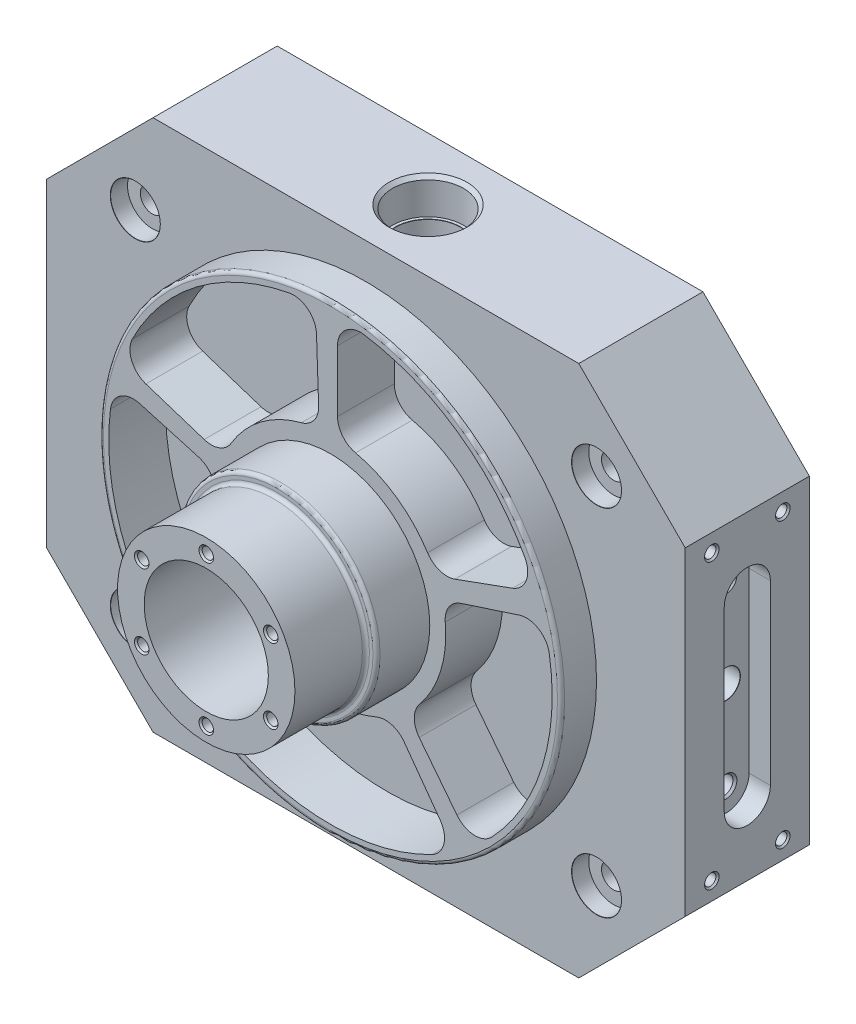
ISO-10303-21;
HEADER;
FILE_DESCRIPTION(('STEP AP214'),'2;1');
FILE_NAME('part.step','',(''),(''),'','','');
FILE_SCHEMA(('AUTOMOTIVE_DESIGN { 1 0 10303 214 1 1 1 1 }'));
ENDSEC;
DATA;
#1=APPLICATION_CONTEXT('core data for automotive mechanical design processes');
#2=APPLICATION_PROTOCOL_DEFINITION('international standard','automotive_design',2000,#1);
#3=PRODUCT_CONTEXT('',#1,'mechanical');
#4=PRODUCT('Part','Part','',(#3));
#5=PRODUCT_RELATED_PRODUCT_CATEGORY('part','',(#4));
#6=PRODUCT_DEFINITION_FORMATION('','',#4);
#7=PRODUCT_DEFINITION_CONTEXT('part definition',#1,'design');
#8=PRODUCT_DEFINITION('design','',#6,#7);
#9=PRODUCT_DEFINITION_SHAPE('','',#8);
#10=(LENGTH_UNIT() NAMED_UNIT(*) SI_UNIT(.MILLI.,.METRE.));
#11=(NAMED_UNIT(*) PLANE_ANGLE_UNIT() SI_UNIT($,.RADIAN.));
#12=(NAMED_UNIT(*) SI_UNIT($,.STERADIAN.) SOLID_ANGLE_UNIT());
#13=UNCERTAINTY_MEASURE_WITH_UNIT(LENGTH_MEASURE(1.E-05),#10,'distance_accuracy_value','');
#14=(GEOMETRIC_REPRESENTATION_CONTEXT(3) GLOBAL_UNCERTAINTY_ASSIGNED_CONTEXT((#13)) GLOBAL_UNIT_ASSIGNED_CONTEXT((#10,
#11,#12)) REPRESENTATION_CONTEXT('',''));
#15=CARTESIAN_POINT('',(0.,0.,0.));
#16=DIRECTION('',(0.,0.,1.));
#17=DIRECTION('',(1.,0.,0.));
#18=AXIS2_PLACEMENT_3D('',#15,#16,#17);
#19=CARTESIAN_POINT('',(45.,22.5,17.5));
#20=DIRECTION('',(-1.,0.,0.));
#21=DIRECTION('',(0.,0.,1.));
#22=AXIS2_PLACEMENT_3D('',#19,#20,#21);
#23=PLANE('',#22);
#24=CARTESIAN_POINT('',(45.,-20.,3.75));
#25=DIRECTION('',(1.,0.,0.));
#26=DIRECTION('',(0.,0.,-1.));
#27=AXIS2_PLACEMENT_3D('',#24,#25,#26);
#28=CIRCLE('',#27,1.025);
#29=CARTESIAN_POINT('',(45.,-20.,2.725));
#30=VERTEX_POINT('',#29);
#31=EDGE_CURVE('E484',#30,#30,#28,.T.);
#32=ORIENTED_EDGE('',*,*,#31,.F.);
#33=EDGE_LOOP('',(#32));
#34=FACE_BOUND('',#33,.T.);
#35=CARTESIAN_POINT('',(45.,20.,3.75));
#36=DIRECTION('',(1.,0.,0.));
#37=DIRECTION('',(0.,0.,-1.));
#38=AXIS2_PLACEMENT_3D('',#35,#36,#37);
#39=CIRCLE('',#38,1.025);
#40=CARTESIAN_POINT('',(45.,20.,2.725));
#41=VERTEX_POINT('',#40);
#42=EDGE_CURVE('E475',#41,#41,#39,.T.);
#43=ORIENTED_EDGE('',*,*,#42,.F.);
#44=EDGE_LOOP('',(#43));
#45=FACE_BOUND('',#44,.T.);
#46=CARTESIAN_POINT('',(45.,-20.,13.75));
#47=DIRECTION('',(1.,0.,0.));
#48=DIRECTION('',(0.,0.,-1.));
#49=AXIS2_PLACEMENT_3D('',#46,#47,#48);
#50=CIRCLE('',#49,1.025);
#51=CARTESIAN_POINT('',(45.,-20.,12.725));
#52=VERTEX_POINT('',#51);
#53=EDGE_CURVE('E495',#52,#52,#50,.T.);
#54=ORIENTED_EDGE('',*,*,#53,.F.);
#55=EDGE_LOOP('',(#54));
#56=FACE_BOUND('',#55,.T.);
#57=CARTESIAN_POINT('',(45.,20.,13.75));
#58=DIRECTION('',(1.,0.,0.));
#59=DIRECTION('',(0.,0.,-1.));
#60=AXIS2_PLACEMENT_3D('',#57,#58,#59);
#61=CIRCLE('',#60,1.025);
#62=CARTESIAN_POINT('',(45.,20.,12.725));
#63=VERTEX_POINT('',#62);
#64=EDGE_CURVE('E507',#63,#63,#61,.T.);
#65=ORIENTED_EDGE('',*,*,#64,.F.);
#66=EDGE_LOOP('',(#65));
#67=FACE_BOUND('',#66,.T.);
#68=DIRECTION('',(0.,1.,0.));
#69=VECTOR('',#68,1.);
#70=CARTESIAN_POINT('',(45.,22.5,0.));
#71=LINE('',#70,#69);
#72=CARTESIAN_POINT('',(45.,-22.5000000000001,0.));
#73=VERTEX_POINT('',#72);
#74=CARTESIAN_POINT('',(45.,22.5,0.));
#75=VERTEX_POINT('',#74);
#76=EDGE_CURVE('E1304',#73,#75,#71,.T.);
#77=ORIENTED_EDGE('',*,*,#76,.T.);
#78=DIRECTION('',(0.,0.,-1.));
#79=VECTOR('',#78,1.);
#80=CARTESIAN_POINT('',(45.,22.5,17.5));
#81=LINE('',#80,#79);
#82=CARTESIAN_POINT('',(45.,22.5,17.5));
#83=VERTEX_POINT('',#82);
#84=EDGE_CURVE('E1340',#83,#75,#81,.T.);
#85=ORIENTED_EDGE('',*,*,#84,.F.);
#86=DIRECTION('',(0.,1.,0.));
#87=VECTOR('',#86,1.);
#88=CARTESIAN_POINT('',(45.,22.5,17.5));
#89=LINE('',#88,#87);
#90=CARTESIAN_POINT('',(45.,-22.5000000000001,17.5));
#91=VERTEX_POINT('',#90);
#92=EDGE_CURVE('E1279',#91,#83,#89,.T.);
#93=ORIENTED_EDGE('',*,*,#92,.F.);
#94=DIRECTION('',(0.,0.,-1.));
#95=VECTOR('',#94,1.);
#96=CARTESIAN_POINT('',(45.,-22.5000000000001,17.5));
#97=LINE('',#96,#95);
#98=EDGE_CURVE('E1344',#91,#73,#97,.T.);
#99=ORIENTED_EDGE('',*,*,#98,.T.);
#100=EDGE_LOOP('',(#77,#85,#93,#99));
#101=FACE_BOUND('',#100,.T.);
#102=CARTESIAN_POINT('',(45.,-12.5,8.75));
#103=DIRECTION('',(-1.,0.,0.));
#104=DIRECTION('',(0.,0.,1.));
#105=AXIS2_PLACEMENT_3D('',#102,#103,#104);
#106=CIRCLE('',#105,3.25);
#107=CARTESIAN_POINT('',(45.,-12.5,5.5));
#108=VERTEX_POINT('',#107);
#109=CARTESIAN_POINT('',(45.,-12.5,12.));
#110=VERTEX_POINT('',#109);
#111=EDGE_CURVE('E66',#108,#110,#106,.T.);
#112=ORIENTED_EDGE('',*,*,#111,.T.);
#113=DIRECTION('',(0.,1.,0.));
#114=VECTOR('',#113,1.);
#115=CARTESIAN_POINT('',(45.,-12.5,12.));
#116=LINE('',#115,#114);
#117=CARTESIAN_POINT('',(45.,12.5,12.));
#118=VERTEX_POINT('',#117);
#119=EDGE_CURVE('E560',#110,#118,#116,.T.);
#120=ORIENTED_EDGE('',*,*,#119,.T.);
#121=CARTESIAN_POINT('',(45.,12.5,8.75));
#122=DIRECTION('',(-1.,0.,0.));
#123=DIRECTION('',(0.,0.,1.));
#124=AXIS2_PLACEMENT_3D('',#121,#122,#123);
#125=CIRCLE('',#124,3.25);
#126=CARTESIAN_POINT('',(45.,12.5,5.5));
#127=VERTEX_POINT('',#126);
#128=EDGE_CURVE('E576',#118,#127,#125,.T.);
#129=ORIENTED_EDGE('',*,*,#128,.T.);
#130=DIRECTION('',(0.,-1.,0.));
#131=VECTOR('',#130,1.);
#132=CARTESIAN_POINT('',(45.,-12.5,5.5));
#133=LINE('',#132,#131);
#134=EDGE_CURVE('E572',#127,#108,#133,.T.);
#135=ORIENTED_EDGE('',*,*,#134,.T.);
#136=EDGE_LOOP('',(#112,#120,#129,#135));
#137=FACE_BOUND('',#136,.T.);
#138=ADVANCED_FACE('F49',(#34,#45,#56,#67,#101,#137),#23,.F.);
#139=CARTESIAN_POINT('',(-30.,-37.5,17.5));
#140=DIRECTION('',(0.,1.,0.));
#141=DIRECTION('',(0.,0.,1.));
#142=AXIS2_PLACEMENT_3D('',#139,#140,#141);
#143=PLANE('',#142);
#144=CARTESIAN_POINT('',(0.,-37.5,8.75));
#145=DIRECTION('',(0.,1.,0.));
#146=DIRECTION('',(0.,0.,1.));
#147=AXIS2_PLACEMENT_3D('',#144,#145,#146);
#148=CIRCLE('',#147,5.50000000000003);
#149=CARTESIAN_POINT('',(0.,-37.5,14.25));
#150=VERTEX_POINT('',#149);
#151=EDGE_CURVE('E11',#150,#150,#148,.T.);
#152=ORIENTED_EDGE('',*,*,#151,.T.);
#153=EDGE_LOOP('',(#152));
#154=FACE_BOUND('',#153,.T.);
#155=DIRECTION('',(1.,0.,0.));
#156=VECTOR('',#155,1.);
#157=CARTESIAN_POINT('',(-30.,-37.5,0.));
#158=LINE('',#157,#156);
#159=CARTESIAN_POINT('',(-30.,-37.5,0.));
#160=VERTEX_POINT('',#159);
#161=CARTESIAN_POINT('',(30.,-37.5,0.));
#162=VERTEX_POINT('',#161);
#163=EDGE_CURVE('E1260',#160,#162,#158,.T.);
#164=ORIENTED_EDGE('',*,*,#163,.T.);
#165=DIRECTION('',(0.,0.,-1.));
#166=VECTOR('',#165,1.);
#167=CARTESIAN_POINT('',(30.,-37.5,17.5));
#168=LINE('',#167,#166);
#169=CARTESIAN_POINT('',(30.,-37.5,17.5));
#170=VERTEX_POINT('',#169);
#171=EDGE_CURVE('E1270',#170,#162,#168,.T.);
#172=ORIENTED_EDGE('',*,*,#171,.F.);
#173=DIRECTION('',(1.,0.,0.));
#174=VECTOR('',#173,1.);
#175=CARTESIAN_POINT('',(-30.,-37.5,17.5));
#176=LINE('',#175,#174);
#177=CARTESIAN_POINT('',(-30.,-37.5,17.5));
#178=VERTEX_POINT('',#177);
#179=EDGE_CURVE('E1271',#178,#170,#176,.T.);
#180=ORIENTED_EDGE('',*,*,#179,.F.);
#181=DIRECTION('',(0.,0.,-1.));
#182=VECTOR('',#181,1.);
#183=CARTESIAN_POINT('',(-30.,-37.5,17.5));
#184=LINE('',#183,#182);
#185=EDGE_CURVE('E1297',#178,#160,#184,.T.);
#186=ORIENTED_EDGE('',*,*,#185,.T.);
#187=EDGE_LOOP('',(#164,#172,#180,#186));
#188=FACE_BOUND('',#187,.T.);
#189=ADVANCED_FACE('F1447',(#154,#188),#143,.F.);
#190=CARTESIAN_POINT('',(30.,-37.5,17.5));
#191=DIRECTION('',(-0.707106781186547,0.707106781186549,0.));
#192=DIRECTION('',(-0.707106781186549,-0.707106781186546,0.));
#193=AXIS2_PLACEMENT_3D('',#190,#191,#192);
#194=PLANE('',#193);
#195=DIRECTION('',(0.707106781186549,0.707106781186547,0.));
#196=VECTOR('',#195,1.);
#197=CARTESIAN_POINT('',(30.,-37.5,0.));
#198=LINE('',#197,#196);
#199=EDGE_CURVE('E1301',#162,#73,#198,.T.);
#200=ORIENTED_EDGE('',*,*,#199,.T.);
#201=ORIENTED_EDGE('',*,*,#98,.F.);
#202=DIRECTION('',(0.707106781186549,0.707106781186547,0.));
#203=VECTOR('',#202,1.);
#204=CARTESIAN_POINT('',(30.,-37.5,17.5));
#205=LINE('',#204,#203);
#206=EDGE_CURVE('E1275',#170,#91,#205,.T.);
#207=ORIENTED_EDGE('',*,*,#206,.F.);
#208=ORIENTED_EDGE('',*,*,#171,.T.);
#209=EDGE_LOOP('',(#200,#201,#207,#208));
#210=FACE_BOUND('',#209,.T.);
#211=ADVANCED_FACE('F1453',(#210),#194,.F.);
#212=CARTESIAN_POINT('',(30.,37.5,17.5));
#213=DIRECTION('',(-0.707106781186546,-0.707106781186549,0.));
#214=DIRECTION('',(0.707106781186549,-0.707106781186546,0.));
#215=AXIS2_PLACEMENT_3D('',#212,#213,#214);
#216=PLANE('',#215);
#217=DIRECTION('',(-0.707106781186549,0.707106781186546,0.));
#218=VECTOR('',#217,1.);
#219=CARTESIAN_POINT('',(30.,37.5,0.));
#220=LINE('',#219,#218);
#221=CARTESIAN_POINT('',(30.,37.5,0.));
#222=VERTEX_POINT('',#221);
#223=EDGE_CURVE('E1307',#75,#222,#220,.T.);
#224=ORIENTED_EDGE('',*,*,#223,.T.);
#225=DIRECTION('',(0.,0.,-1.));
#226=VECTOR('',#225,1.);
#227=CARTESIAN_POINT('',(30.,37.5,17.5));
#228=LINE('',#227,#226);
#229=CARTESIAN_POINT('',(30.,37.5,17.5));
#230=VERTEX_POINT('',#229);
#231=EDGE_CURVE('E1336',#230,#222,#228,.T.);
#232=ORIENTED_EDGE('',*,*,#231,.F.);
#233=DIRECTION('',(-0.707106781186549,0.707106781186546,0.));
#234=VECTOR('',#233,1.);
#235=CARTESIAN_POINT('',(30.,37.5,17.5));
#236=LINE('',#235,#234);
#237=EDGE_CURVE('E1282',#83,#230,#236,.T.);
#238=ORIENTED_EDGE('',*,*,#237,.F.);
#239=ORIENTED_EDGE('',*,*,#84,.T.);
#240=EDGE_LOOP('',(#224,#232,#238,#239));
#241=FACE_BOUND('',#240,.T.);
#242=ADVANCED_FACE('F1460',(#241),#216,.F.);
#243=CARTESIAN_POINT('',(-30.,37.5,17.5));
#244=DIRECTION('',(0.,-1.,0.));
#245=DIRECTION('',(0.,0.,-1.));
#246=AXIS2_PLACEMENT_3D('',#243,#244,#245);
#247=PLANE('',#246);
#248=CARTESIAN_POINT('',(0.,37.5,8.75));
#249=DIRECTION('',(0.,1.,0.));
#250=DIRECTION('',(0.,0.,1.));
#251=AXIS2_PLACEMENT_3D('',#248,#249,#250);
#252=CIRCLE('',#251,5.50000000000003);
#253=CARTESIAN_POINT('',(0.,37.5,14.25));
#254=VERTEX_POINT('',#253);
#255=EDGE_CURVE('E1585',#254,#254,#252,.T.);
#256=ORIENTED_EDGE('',*,*,#255,.F.);
#257=EDGE_LOOP('',(#256));
#258=FACE_BOUND('',#257,.T.);
#259=DIRECTION('',(-1.,0.,0.));
#260=VECTOR('',#259,1.);
#261=CARTESIAN_POINT('',(-30.,37.5,0.));
#262=LINE('',#261,#260);
#263=CARTESIAN_POINT('',(-30.,37.5,0.));
#264=VERTEX_POINT('',#263);
#265=EDGE_CURVE('E1310',#222,#264,#262,.T.);
#266=ORIENTED_EDGE('',*,*,#265,.T.);
#267=DIRECTION('',(0.,0.,-1.));
#268=VECTOR('',#267,1.);
#269=CARTESIAN_POINT('',(-30.,37.5,17.5));
#270=LINE('',#269,#268);
#271=CARTESIAN_POINT('',(-30.,37.5,17.5));
#272=VERTEX_POINT('',#271);
#273=EDGE_CURVE('E1332',#272,#264,#270,.T.);
#274=ORIENTED_EDGE('',*,*,#273,.F.);
#275=DIRECTION('',(-1.,0.,0.));
#276=VECTOR('',#275,1.);
#277=CARTESIAN_POINT('',(-30.,37.5,17.5));
#278=LINE('',#277,#276);
#279=EDGE_CURVE('E1285',#230,#272,#278,.T.);
#280=ORIENTED_EDGE('',*,*,#279,.F.);
#281=ORIENTED_EDGE('',*,*,#231,.T.);
#282=EDGE_LOOP('',(#266,#274,#280,#281));
#283=FACE_BOUND('',#282,.T.);
#284=ADVANCED_FACE('F1574',(#258,#283),#247,.F.);
#285=CARTESIAN_POINT('',(-45.,22.5,17.5));
#286=DIRECTION('',(0.707106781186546,-0.707106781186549,0.));
#287=DIRECTION('',(0.707106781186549,0.707106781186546,0.));
#288=AXIS2_PLACEMENT_3D('',#285,#286,#287);
#289=PLANE('',#288);
#290=DIRECTION('',(-0.707106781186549,-0.707106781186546,0.));
#291=VECTOR('',#290,1.);
#292=CARTESIAN_POINT('',(-45.,22.5,0.));
#293=LINE('',#292,#291);
#294=CARTESIAN_POINT('',(-45.,22.5,0.));
#295=VERTEX_POINT('',#294);
#296=EDGE_CURVE('E1313',#264,#295,#293,.T.);
#297=ORIENTED_EDGE('',*,*,#296,.T.);
#298=DIRECTION('',(0.,0.,-1.));
#299=VECTOR('',#298,1.);
#300=CARTESIAN_POINT('',(-45.,22.5,17.5));
#301=LINE('',#300,#299);
#302=CARTESIAN_POINT('',(-45.,22.5,17.5));
#303=VERTEX_POINT('',#302);
#304=EDGE_CURVE('E1328',#303,#295,#301,.T.);
#305=ORIENTED_EDGE('',*,*,#304,.F.);
#306=DIRECTION('',(-0.707106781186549,-0.707106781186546,0.));
#307=VECTOR('',#306,1.);
#308=CARTESIAN_POINT('',(-45.,22.5,17.5));
#309=LINE('',#308,#307);
#310=EDGE_CURVE('E1288',#272,#303,#309,.T.);
#311=ORIENTED_EDGE('',*,*,#310,.F.);
#312=ORIENTED_EDGE('',*,*,#273,.T.);
#313=EDGE_LOOP('',(#297,#305,#311,#312));
#314=FACE_BOUND('',#313,.T.);
#315=ADVANCED_FACE('F1571',(#314),#289,.F.);
#316=CARTESIAN_POINT('',(-45.,22.5,17.5));
#317=DIRECTION('',(1.,0.,0.));
#318=DIRECTION('',(0.,1.,0.));
#319=AXIS2_PLACEMENT_3D('',#316,#317,#318);
#320=PLANE('',#319);
#321=CARTESIAN_POINT('',(-45.,-20.,3.75));
#322=DIRECTION('',(-1.,0.,0.));
#323=DIRECTION('',(0.,0.,1.));
#324=AXIS2_PLACEMENT_3D('',#321,#322,#323);
#325=CIRCLE('',#324,1.025);
#326=CARTESIAN_POINT('',(-45.,-20.,4.775));
#327=VERTEX_POINT('',#326);
#328=EDGE_CURVE('E586',#327,#327,#325,.T.);
#329=ORIENTED_EDGE('',*,*,#328,.F.);
#330=EDGE_LOOP('',(#329));
#331=FACE_BOUND('',#330,.T.);
#332=CARTESIAN_POINT('',(-45.,20.,3.75));
#333=DIRECTION('',(-1.,0.,0.));
#334=DIRECTION('',(0.,0.,1.));
#335=AXIS2_PLACEMENT_3D('',#332,#333,#334);
#336=CIRCLE('',#335,1.025);
#337=CARTESIAN_POINT('',(-45.,20.,4.775));
#338=VERTEX_POINT('',#337);
#339=EDGE_CURVE('E606',#338,#338,#336,.T.);
#340=ORIENTED_EDGE('',*,*,#339,.F.);
#341=EDGE_LOOP('',(#340));
#342=FACE_BOUND('',#341,.T.);
#343=CARTESIAN_POINT('',(-45.,-20.,13.75));
#344=DIRECTION('',(-1.,0.,0.));
#345=DIRECTION('',(0.,0.,1.));
#346=AXIS2_PLACEMENT_3D('',#343,#344,#345);
#347=CIRCLE('',#346,1.025);
#348=CARTESIAN_POINT('',(-45.,-20.,14.775));
#349=VERTEX_POINT('',#348);
#350=EDGE_CURVE('E618',#349,#349,#347,.T.);
#351=ORIENTED_EDGE('',*,*,#350,.F.);
#352=EDGE_LOOP('',(#351));
#353=FACE_BOUND('',#352,.T.);
#354=CARTESIAN_POINT('',(-45.,20.,13.75));
#355=DIRECTION('',(-1.,0.,0.));
#356=DIRECTION('',(0.,0.,1.));
#357=AXIS2_PLACEMENT_3D('',#354,#355,#356);
#358=CIRCLE('',#357,1.025);
#359=CARTESIAN_POINT('',(-45.,20.,14.775));
#360=VERTEX_POINT('',#359);
#361=EDGE_CURVE('E630',#360,#360,#358,.T.);
#362=ORIENTED_EDGE('',*,*,#361,.F.);
#363=EDGE_LOOP('',(#362));
#364=FACE_BOUND('',#363,.T.);
#365=DIRECTION('',(0.,1.,0.));
#366=VECTOR('',#365,1.);
#367=CARTESIAN_POINT('',(-45.,-12.5,12.));
#368=LINE('',#367,#366);
#369=CARTESIAN_POINT('',(-45.,-12.5,12.));
#370=VERTEX_POINT('',#369);
#371=CARTESIAN_POINT('',(-45.,12.5,12.));
#372=VERTEX_POINT('',#371);
#373=EDGE_CURVE('E698',#370,#372,#368,.T.);
#374=ORIENTED_EDGE('',*,*,#373,.F.);
#375=CARTESIAN_POINT('',(-45.,-12.5,8.75));
#376=DIRECTION('',(-1.,0.,0.));
#377=DIRECTION('',(0.,0.,1.));
#378=AXIS2_PLACEMENT_3D('',#375,#376,#377);
#379=CIRCLE('',#378,3.25);
#380=CARTESIAN_POINT('',(-45.,-12.5,5.5));
#381=VERTEX_POINT('',#380);
#382=EDGE_CURVE('E74',#381,#370,#379,.T.);
#383=ORIENTED_EDGE('',*,*,#382,.F.);
#384=DIRECTION('',(0.,-1.,0.));
#385=VECTOR('',#384,1.);
#386=CARTESIAN_POINT('',(-45.,-12.5,5.5));
#387=LINE('',#386,#385);
#388=CARTESIAN_POINT('',(-45.,12.5,5.5));
#389=VERTEX_POINT('',#388);
#390=EDGE_CURVE('E683',#389,#381,#387,.T.);
#391=ORIENTED_EDGE('',*,*,#390,.F.);
#392=CARTESIAN_POINT('',(-45.,12.5,8.75));
#393=DIRECTION('',(-1.,0.,0.));
#394=DIRECTION('',(0.,0.,1.));
#395=AXIS2_PLACEMENT_3D('',#392,#393,#394);
#396=CIRCLE('',#395,3.25);
#397=EDGE_CURVE('E702',#372,#389,#396,.T.);
#398=ORIENTED_EDGE('',*,*,#397,.F.);
#399=EDGE_LOOP('',(#374,#383,#391,#398));
#400=FACE_BOUND('',#399,.T.);
#401=DIRECTION('',(0.,-1.,0.));
#402=VECTOR('',#401,1.);
#403=CARTESIAN_POINT('',(-45.,22.5,0.));
#404=LINE('',#403,#402);
#405=CARTESIAN_POINT('',(-45.,-22.5,0.));
#406=VERTEX_POINT('',#405);
#407=EDGE_CURVE('E1316',#295,#406,#404,.T.);
#408=ORIENTED_EDGE('',*,*,#407,.T.);
#409=DIRECTION('',(0.,0.,-1.));
#410=VECTOR('',#409,1.);
#411=CARTESIAN_POINT('',(-45.,-22.5,17.5));
#412=LINE('',#411,#410);
#413=CARTESIAN_POINT('',(-45.,-22.5,17.5));
#414=VERTEX_POINT('',#413);
#415=EDGE_CURVE('E1324',#414,#406,#412,.T.);
#416=ORIENTED_EDGE('',*,*,#415,.F.);
#417=DIRECTION('',(0.,-1.,0.));
#418=VECTOR('',#417,1.);
#419=CARTESIAN_POINT('',(-45.,22.5,17.5));
#420=LINE('',#419,#418);
#421=EDGE_CURVE('E1291',#303,#414,#420,.T.);
#422=ORIENTED_EDGE('',*,*,#421,.F.);
#423=ORIENTED_EDGE('',*,*,#304,.T.);
#424=EDGE_LOOP('',(#408,#416,#422,#423));
#425=FACE_BOUND('',#424,.T.);
#426=ADVANCED_FACE('F1567',(#331,#342,#353,#364,#400,#425),#320,.F.);
#427=CARTESIAN_POINT('',(-45.,-22.5,17.5));
#428=DIRECTION('',(0.707106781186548,0.707106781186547,0.));
#429=DIRECTION('',(-0.707106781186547,0.707106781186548,0.));
#430=AXIS2_PLACEMENT_3D('',#427,#428,#429);
#431=PLANE('',#430);
#432=DIRECTION('',(0.707106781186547,-0.707106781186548,0.));
#433=VECTOR('',#432,1.);
#434=CARTESIAN_POINT('',(-45.,-22.5,0.));
#435=LINE('',#434,#433);
#436=EDGE_CURVE('E1276',#406,#160,#435,.T.);
#437=ORIENTED_EDGE('',*,*,#436,.T.);
#438=ORIENTED_EDGE('',*,*,#185,.F.);
#439=DIRECTION('',(0.707106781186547,-0.707106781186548,0.));
#440=VECTOR('',#439,1.);
#441=CARTESIAN_POINT('',(-45.,-22.5,17.5));
#442=LINE('',#441,#440);
#443=EDGE_CURVE('E1294',#414,#178,#442,.T.);
#444=ORIENTED_EDGE('',*,*,#443,.F.);
#445=ORIENTED_EDGE('',*,*,#415,.T.);
#446=EDGE_LOOP('',(#437,#438,#444,#445));
#447=FACE_BOUND('',#446,.T.);
#448=ADVANCED_FACE('F1560',(#447),#431,.F.);
#449=CARTESIAN_POINT('',(0.,0.,17.5));
#450=DIRECTION('',(0.,0.,-1.));
#451=DIRECTION('',(-1.,0.,0.));
#452=AXIS2_PLACEMENT_3D('',#449,#450,#451);
#453=PLANE('',#452);
#454=CARTESIAN_POINT('',(-32.5,-25.,17.5));
#455=DIRECTION('',(0.,0.,1.));
#456=DIRECTION('',(1.,0.,0.));
#457=AXIS2_PLACEMENT_3D('',#454,#455,#456);
#458=CIRCLE('',#457,3.525);
#459=CARTESIAN_POINT('',(-28.975,-25.,17.5));
#460=VERTEX_POINT('',#459);
#461=EDGE_CURVE('E792',#460,#460,#458,.T.);
#462=ORIENTED_EDGE('',*,*,#461,.F.);
#463=EDGE_LOOP('',(#462));
#464=FACE_BOUND('',#463,.T.);
#465=CARTESIAN_POINT('',(-32.5,25.,17.5));
#466=DIRECTION('',(0.,0.,1.));
#467=DIRECTION('',(1.,0.,0.));
#468=AXIS2_PLACEMENT_3D('',#465,#466,#467);
#469=CIRCLE('',#468,3.525);
#470=CARTESIAN_POINT('',(-28.975,25.,17.5));
#471=VERTEX_POINT('',#470);
#472=EDGE_CURVE('E812',#471,#471,#469,.T.);
#473=ORIENTED_EDGE('',*,*,#472,.F.);
#474=EDGE_LOOP('',(#473));
#475=FACE_BOUND('',#474,.T.);
#476=CARTESIAN_POINT('',(32.5,-25.,17.5));
#477=DIRECTION('',(0.,0.,1.));
#478=DIRECTION('',(1.,0.,0.));
#479=AXIS2_PLACEMENT_3D('',#476,#477,#478);
#480=CIRCLE('',#479,3.525);
#481=CARTESIAN_POINT('',(36.025,-25.,17.5));
#482=VERTEX_POINT('',#481);
#483=EDGE_CURVE('E832',#482,#482,#480,.T.);
#484=ORIENTED_EDGE('',*,*,#483,.F.);
#485=EDGE_LOOP('',(#484));
#486=FACE_BOUND('',#485,.T.);
#487=CARTESIAN_POINT('',(32.5,25.,17.5));
#488=DIRECTION('',(0.,0.,1.));
#489=DIRECTION('',(1.,0.,0.));
#490=AXIS2_PLACEMENT_3D('',#487,#488,#489);
#491=CIRCLE('',#490,3.525);
#492=CARTESIAN_POINT('',(36.025,25.,17.5));
#493=VERTEX_POINT('',#492);
#494=EDGE_CURVE('E852',#493,#493,#491,.T.);
#495=ORIENTED_EDGE('',*,*,#494,.F.);
#496=EDGE_LOOP('',(#495));
#497=FACE_BOUND('',#496,.T.);
#498=CARTESIAN_POINT('',(0.,0.,17.5));
#499=DIRECTION('',(0.,0.,1.));
#500=DIRECTION('',(1.,0.,0.));
#501=AXIS2_PLACEMENT_3D('',#498,#499,#500);
#502=CIRCLE('',#501,32.5);
#503=CARTESIAN_POINT('',(32.5,0.,17.5));
#504=VERTEX_POINT('',#503);
#505=EDGE_CURVE('E1266',#504,#504,#502,.T.);
#506=ORIENTED_EDGE('',*,*,#505,.F.);
#507=EDGE_LOOP('',(#506));
#508=FACE_BOUND('',#507,.T.);
#509=ORIENTED_EDGE('',*,*,#179,.T.);
#510=ORIENTED_EDGE('',*,*,#206,.T.);
#511=ORIENTED_EDGE('',*,*,#92,.T.);
#512=ORIENTED_EDGE('',*,*,#237,.T.);
#513=ORIENTED_EDGE('',*,*,#279,.T.);
#514=ORIENTED_EDGE('',*,*,#310,.T.);
#515=ORIENTED_EDGE('',*,*,#421,.T.);
#516=ORIENTED_EDGE('',*,*,#443,.T.);
#517=EDGE_LOOP('',(#509,#510,#511,#512,#513,#514,#515,#516));
#518=FACE_BOUND('',#517,.T.);
#519=ADVANCED_FACE('F1557',(#464,#475,#486,#497,#508,#518),#453,.F.);
#520=CARTESIAN_POINT('',(0.,0.,0.));
#521=DIRECTION('',(0.,0.,-1.));
#522=DIRECTION('',(-1.,0.,0.));
#523=AXIS2_PLACEMENT_3D('',#520,#521,#522);
#524=PLANE('',#523);
#525=CARTESIAN_POINT('',(-32.5,-25.,0.));
#526=DIRECTION('',(0.,0.,-1.));
#527=DIRECTION('',(-1.,0.,0.));
#528=AXIS2_PLACEMENT_3D('',#525,#526,#527);
#529=CIRCLE('',#528,1.7);
#530=CARTESIAN_POINT('',(-34.2,-25.,0.));
#531=VERTEX_POINT('',#530);
#532=EDGE_CURVE('E808',#531,#531,#529,.T.);
#533=ORIENTED_EDGE('',*,*,#532,.F.);
#534=EDGE_LOOP('',(#533));
#535=FACE_BOUND('',#534,.T.);
#536=CARTESIAN_POINT('',(-32.5,25.,0.));
#537=DIRECTION('',(0.,0.,-1.));
#538=DIRECTION('',(-1.,0.,0.));
#539=AXIS2_PLACEMENT_3D('',#536,#537,#538);
#540=CIRCLE('',#539,1.7);
#541=CARTESIAN_POINT('',(-34.2,25.,0.));
#542=VERTEX_POINT('',#541);
#543=EDGE_CURVE('E828',#542,#542,#540,.T.);
#544=ORIENTED_EDGE('',*,*,#543,.F.);
#545=EDGE_LOOP('',(#544));
#546=FACE_BOUND('',#545,.T.);
#547=CARTESIAN_POINT('',(32.5,-25.,0.));
#548=DIRECTION('',(0.,0.,-1.));
#549=DIRECTION('',(-1.,0.,0.));
#550=AXIS2_PLACEMENT_3D('',#547,#548,#549);
#551=CIRCLE('',#550,1.7);
#552=CARTESIAN_POINT('',(30.8,-25.,0.));
#553=VERTEX_POINT('',#552);
#554=EDGE_CURVE('E848',#553,#553,#551,.T.);
#555=ORIENTED_EDGE('',*,*,#554,.F.);
#556=EDGE_LOOP('',(#555));
#557=FACE_BOUND('',#556,.T.);
#558=CARTESIAN_POINT('',(32.5,25.,0.));
#559=DIRECTION('',(0.,0.,-1.));
#560=DIRECTION('',(-1.,0.,0.));
#561=AXIS2_PLACEMENT_3D('',#558,#559,#560);
#562=CIRCLE('',#561,1.7);
#563=CARTESIAN_POINT('',(30.8,25.,0.));
#564=VERTEX_POINT('',#563);
#565=EDGE_CURVE('E868',#564,#564,#562,.T.);
#566=ORIENTED_EDGE('',*,*,#565,.F.);
#567=EDGE_LOOP('',(#566));
#568=FACE_BOUND('',#567,.T.);
#569=CARTESIAN_POINT('',(0.,0.,0.));
#570=DIRECTION('',(0.,0.,1.));
#571=DIRECTION('',(1.,0.,0.));
#572=AXIS2_PLACEMENT_3D('',#569,#570,#571);
#573=CIRCLE('',#572,8.75);
#574=CARTESIAN_POINT('',(8.75,0.,0.));
#575=VERTEX_POINT('',#574);
#576=EDGE_CURVE('E1249',#575,#575,#573,.T.);
#577=ORIENTED_EDGE('',*,*,#576,.T.);
#578=EDGE_LOOP('',(#577));
#579=FACE_BOUND('',#578,.T.);
#580=ORIENTED_EDGE('',*,*,#163,.F.);
#581=ORIENTED_EDGE('',*,*,#436,.F.);
#582=ORIENTED_EDGE('',*,*,#407,.F.);
#583=ORIENTED_EDGE('',*,*,#296,.F.);
#584=ORIENTED_EDGE('',*,*,#265,.F.);
#585=ORIENTED_EDGE('',*,*,#223,.F.);
#586=ORIENTED_EDGE('',*,*,#76,.F.);
#587=ORIENTED_EDGE('',*,*,#199,.F.);
#588=EDGE_LOOP('',(#580,#581,#582,#583,#584,#585,#586,#587));
#589=FACE_BOUND('',#588,.T.);
#590=ADVANCED_FACE('F1555',(#535,#546,#557,#568,#579,#589),#524,.T.);
#591=CARTESIAN_POINT('',(0.,0.,22.5));
#592=DIRECTION('',(0.,0.,-1.));
#593=DIRECTION('',(-1.,0.,0.));
#594=AXIS2_PLACEMENT_3D('',#591,#592,#593);
#595=CYLINDRICAL_SURFACE('',#594,32.5);
#596=CARTESIAN_POINT('',(0.,0.,22.));
#597=DIRECTION('',(0.,0.,1.));
#598=DIRECTION('',(1.,0.,0.));
#599=AXIS2_PLACEMENT_3D('',#596,#597,#598);
#600=CIRCLE('',#599,32.5);
#601=CARTESIAN_POINT('',(32.5,0.,22.));
#602=VERTEX_POINT('',#601);
#603=EDGE_CURVE('E1354',#602,#602,#600,.F.);
#604=ORIENTED_EDGE('',*,*,#603,.T.);
#605=EDGE_LOOP('',(#604));
#606=FACE_BOUND('',#605,.T.);
#607=ORIENTED_EDGE('',*,*,#505,.T.);
#608=EDGE_LOOP('',(#607));
#609=FACE_BOUND('',#608,.T.);
#610=ADVANCED_FACE('F1534',(#606,#609),#595,.T.);
#611=CARTESIAN_POINT('',(0.,0.,22.5));
#612=DIRECTION('',(0.,0.,1.));
#613=DIRECTION('',(1.,0.,0.));
#614=AXIS2_PLACEMENT_3D('',#611,#612,#613);
#615=PLANE('',#614);
#616=CARTESIAN_POINT('',(7.74795077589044,-17.8946712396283,22.5));
#617=DIRECTION('',(0.,0.,1.));
#618=DIRECTION('',(-0.809016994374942,-0.58778525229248,0.));
#619=AXIS2_PLACEMENT_3D('',#616,#617,#618);
#620=CIRCLE('',#619,3.25);
#621=CARTESIAN_POINT('',(6.45662564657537,-14.9122260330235,22.5));
#622=VERTEX_POINT('',#621);
#623=CARTESIAN_POINT('',(10.377256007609,-15.9843691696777,22.5));
#624=VERTEX_POINT('',#623);
#625=EDGE_CURVE('E1033',#622,#624,#620,.F.);
#626=ORIENTED_EDGE('',*,*,#625,.T.);
#627=DIRECTION('',(-0.58778525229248,0.809016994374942,0.));
#628=VECTOR('',#627,1.);
#629=CARTESIAN_POINT('',(8.7243905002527,-13.7093949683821,22.5));
#630=LINE('',#629,#628);
#631=CARTESIAN_POINT('',(15.4582783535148,-22.9777964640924,22.5));
#632=VERTEX_POINT('',#631);
#633=EDGE_CURVE('E1037',#632,#624,#630,.T.);
#634=ORIENTED_EDGE('',*,*,#633,.F.);
#635=CARTESIAN_POINT('',(12.8289731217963,-24.8880985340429,22.5));
#636=DIRECTION('',(0.,0.,1.));
#637=DIRECTION('',(-0.809016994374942,-0.58778525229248,0.));
#638=AXIS2_PLACEMENT_3D('',#635,#636,#637);
#639=CIRCLE('',#638,3.25);
#640=CARTESIAN_POINT('',(14.3180503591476,-27.7768956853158,22.5));
#641=VERTEX_POINT('',#640);
#642=EDGE_CURVE('E958',#632,#641,#639,.F.);
#643=ORIENTED_EDGE('',*,*,#642,.T.);
#644=CARTESIAN_POINT('',(0.,0.,22.5));
#645=DIRECTION('',(0.,0.,1.));
#646=DIRECTION('',(-0.809016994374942,-0.58778525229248,0.));
#647=AXIS2_PLACEMENT_3D('',#644,#645,#646);
#648=CIRCLE('',#647,31.25);
#649=CARTESIAN_POINT('',(-13.3399285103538,-28.2596675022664,22.5));
#650=VERTEX_POINT('',#649);
#651=EDGE_CURVE('E1041',#650,#641,#648,.T.);
#652=ORIENTED_EDGE('',*,*,#651,.F.);
#653=CARTESIAN_POINT('',(-11.952575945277,-25.3206620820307,22.5));
#654=DIRECTION('',(0.,0.,1.));
#655=DIRECTION('',(-0.809016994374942,-0.58778525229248,0.));
#656=AXIS2_PLACEMENT_3D('',#653,#654,#655);
#657=CIRCLE('',#656,3.25);
#658=CARTESIAN_POINT('',(-14.6469480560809,-23.5032851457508,22.5));
#659=VERTEX_POINT('',#658);
#660=EDGE_CURVE('E999',#650,#659,#657,.F.);
#661=ORIENTED_EDGE('',*,*,#660,.T.);
#662=DIRECTION('',(-0.559192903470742,-0.829037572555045,0.));
#663=VECTOR('',#662,1.);
#664=CARTESIAN_POINT('',(-8.24062485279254,-14.0055204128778,22.5));
#665=LINE('',#664,#663);
#666=CARTESIAN_POINT('',(-9.81308802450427,-16.3367929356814,22.5));
#667=VERTEX_POINT('',#666);
#668=EDGE_CURVE('E1010',#667,#659,#665,.T.);
#669=ORIENTED_EDGE('',*,*,#668,.F.);
#670=CARTESIAN_POINT('',(-7.11871591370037,-18.1541698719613,22.5));
#671=DIRECTION('',(0.,0.,1.));
#672=DIRECTION('',(-0.809016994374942,-0.58778525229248,0.));
#673=AXIS2_PLACEMENT_3D('',#670,#671,#672);
#674=CIRCLE('',#673,3.25);
#675=CARTESIAN_POINT('',(-5.93226326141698,-15.1284748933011,22.5));
#676=VERTEX_POINT('',#675);
#677=EDGE_CURVE('E1018',#667,#676,#674,.F.);
#678=ORIENTED_EDGE('',*,*,#677,.T.);
#679=CARTESIAN_POINT('',(0.,0.,22.5));
#680=DIRECTION('',(0.,0.,-1.));
#681=DIRECTION('',(-0.809016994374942,-0.58778525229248,0.));
#682=AXIS2_PLACEMENT_3D('',#679,#680,#681);
#683=CIRCLE('',#682,16.25);
#684=EDGE_CURVE('E1025',#622,#676,#683,.T.);
#685=ORIENTED_EDGE('',*,*,#684,.F.);
#686=EDGE_LOOP('',(#626,#634,#643,#652,#661,#669,#678,#685));
#687=FACE_BOUND('',#686,.T.);
#688=CARTESIAN_POINT('',(-14.6245952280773,-12.8984965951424,22.5));
#689=DIRECTION('',(0.,0.,1.));
#690=DIRECTION('',(-0.809016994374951,0.587785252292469,0.));
#691=AXIS2_PLACEMENT_3D('',#688,#689,#690);
#692=CIRCLE('',#691,3.25);
#693=CARTESIAN_POINT('',(-12.1871626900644,-10.7487471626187,22.5));
#694=VERTEX_POINT('',#693);
#695=CARTESIAN_POINT('',(-11.9952899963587,-14.8087986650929,22.5));
#696=VERTEX_POINT('',#695);
#697=EDGE_CURVE('E1119',#694,#696,#692,.F.);
#698=ORIENTED_EDGE('',*,*,#697,.T.);
#699=DIRECTION('',(0.587785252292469,0.809016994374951,0.));
#700=VECTOR('',#699,1.);
#701=CARTESIAN_POINT('',(-10.3424244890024,-12.5338244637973,22.5));
#702=LINE('',#701,#700);
#703=CARTESIAN_POINT('',(-17.0763123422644,-21.8022259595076,22.5));
#704=VERTEX_POINT('',#703);
#705=EDGE_CURVE('E1123',#704,#696,#702,.T.);
#706=ORIENTED_EDGE('',*,*,#705,.F.);
#707=CARTESIAN_POINT('',(-19.705617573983,-19.8919238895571,22.5));
#708=DIRECTION('',(0.,0.,1.));
#709=DIRECTION('',(-0.809016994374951,0.587785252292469,0.));
#710=AXIS2_PLACEMENT_3D('',#707,#708,#709);
#711=CIRCLE('',#710,3.25);
#712=CARTESIAN_POINT('',(-21.9928767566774,-22.2008079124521,22.5));
#713=VERTEX_POINT('',#712);
#714=EDGE_CURVE('E1044',#704,#713,#711,.F.);
#715=ORIENTED_EDGE('',*,*,#714,.T.);
#716=CARTESIAN_POINT('',(0.,0.,22.5));
#717=DIRECTION('',(0.,0.,1.));
#718=DIRECTION('',(-0.809016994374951,0.587785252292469,0.));
#719=AXIS2_PLACEMENT_3D('',#716,#717,#718);
#720=CIRCLE('',#719,31.25);
#721=CARTESIAN_POINT('',(-30.998805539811,3.95430842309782,22.5));
#722=VERTEX_POINT('',#721);
#723=EDGE_CURVE('E1127',#722,#713,#720,.T.);
#724=ORIENTED_EDGE('',*,*,#723,.F.);
#725=CARTESIAN_POINT('',(-27.7749297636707,3.54306034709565,22.5));
#726=DIRECTION('',(0.,0.,1.));
#727=DIRECTION('',(-0.809016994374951,0.587785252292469,0.));
#728=AXIS2_PLACEMENT_3D('',#725,#726,#727);
#729=CIRCLE('',#728,3.25);
#730=CARTESIAN_POINT('',(-26.8791083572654,6.66716085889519,22.5));
#731=VERTEX_POINT('',#730);
#732=EDGE_CURVE('E1085',#722,#731,#729,.F.);
#733=ORIENTED_EDGE('',*,*,#732,.T.);
#734=DIRECTION('',(-0.96126169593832,0.275637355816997,0.));
#735=VECTOR('',#734,1.);
#736=CARTESIAN_POINT('',(-15.8665345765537,3.5093561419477,22.5));
#737=LINE('',#736,#735);
#738=CARTESIAN_POINT('',(-18.5696243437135,4.28445465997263,22.5));
#739=VERTEX_POINT('',#738);
#740=EDGE_CURVE('E1096',#739,#731,#737,.T.);
#741=ORIENTED_EDGE('',*,*,#740,.F.);
#742=CARTESIAN_POINT('',(-19.4654457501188,1.16035414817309,22.5));
#743=DIRECTION('',(0.,0.,1.));
#744=DIRECTION('',(-0.809016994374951,0.587785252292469,0.));
#745=AXIS2_PLACEMENT_3D('',#742,#743,#744);
#746=CIRCLE('',#745,3.25);
#747=CARTESIAN_POINT('',(-16.2212047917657,0.966961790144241,22.5));
#748=VERTEX_POINT('',#747);
#749=EDGE_CURVE('E1104',#739,#748,#746,.F.);
#750=ORIENTED_EDGE('',*,*,#749,.T.);
#751=CARTESIAN_POINT('',(0.,0.,22.5));
#752=DIRECTION('',(0.,0.,-1.));
#753=DIRECTION('',(-0.809016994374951,0.587785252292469,0.));
#754=AXIS2_PLACEMENT_3D('',#751,#752,#753);
#755=CIRCLE('',#754,16.25);
#756=EDGE_CURVE('E1111',#694,#748,#755,.T.);
#757=ORIENTED_EDGE('',*,*,#756,.F.);
#758=EDGE_LOOP('',(#698,#706,#715,#724,#733,#741,#750,#757));
#759=FACE_BOUND('',#758,.T.);
#760=CARTESIAN_POINT('',(19.4130921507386,1.838981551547,22.5));
#761=DIRECTION('',(0.,0.,1.));
#762=DIRECTION('',(0.309016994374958,-0.95105651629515,0.));
#763=AXIS2_PLACEMENT_3D('',#760,#761,#762);
#764=CIRCLE('',#763,3.25);
#765=CARTESIAN_POINT('',(16.1775767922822,1.53248462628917,22.5));
#766=VERTEX_POINT('',#765);
#767=CARTESIAN_POINT('',(18.40878691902,4.92991522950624,22.5));
#768=VERTEX_POINT('',#767);
#769=EDGE_CURVE('E947',#766,#768,#764,.F.);
#770=ORIENTED_EDGE('',*,*,#769,.T.);
#771=DIRECTION('',(-0.95105651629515,-0.309016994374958,0.));
#772=VECTOR('',#771,1.);
#773=CARTESIAN_POINT('',(15.7343943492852,4.06095240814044,22.5));
#774=LINE('',#773,#772);
#775=CARTESIAN_POINT('',(26.6300537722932,7.60116675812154,22.5));
#776=VERTEX_POINT('',#775);
#777=EDGE_CURVE('E951',#776,#768,#774,.T.);
#778=ORIENTED_EDGE('',*,*,#777,.F.);
#779=CARTESIAN_POINT('',(27.6343590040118,4.5102330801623,22.5));
#780=DIRECTION('',(0.,0.,1.));
#781=DIRECTION('',(0.309016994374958,-0.95105651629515,0.));
#782=AXIS2_PLACEMENT_3D('',#779,#780,#781);
#783=CIRCLE('',#782,3.25);
#784=CARTESIAN_POINT('',(30.8419185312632,5.03374227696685,22.5));
#785=VERTEX_POINT('',#784);
#786=EDGE_CURVE('E872',#776,#785,#783,.F.);
#787=ORIENTED_EDGE('',*,*,#786,.T.);
#788=CARTESIAN_POINT('',(0.,0.,22.5));
#789=DIRECTION('',(0.,0.,1.));
#790=DIRECTION('',(0.309016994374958,-0.95105651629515,0.));
#791=AXIS2_PLACEMENT_3D('',#788,#789,#790);
#792=CIRCLE('',#791,31.25);
#793=CARTESIAN_POINT('',(22.7542763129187,-21.4197434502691,22.5));
#794=VERTEX_POINT('',#793);
#795=EDGE_CURVE('E955',#794,#785,#792,.T.);
#796=ORIENTED_EDGE('',*,*,#795,.F.);
#797=CARTESIAN_POINT('',(20.3878315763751,-19.1920901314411,22.5));
#798=DIRECTION('',(0.,0.,1.));
#799=DIRECTION('',(0.309016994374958,-0.95105651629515,0.));
#800=AXIS2_PLACEMENT_3D('',#797,#798,#799);
#801=CIRCLE('',#800,3.25);
#802=CARTESIAN_POINT('',(17.8267966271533,-21.1929899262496,22.5));
#803=VERTEX_POINT('',#802);
#804=EDGE_CURVE('E913',#794,#803,#801,.F.);
#805=ORIENTED_EDGE('',*,*,#804,.T.);
#806=DIRECTION('',(0.615661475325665,-0.788010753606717,0.));
#807=VECTOR('',#806,1.);
#808=CARTESIAN_POINT('',(10.7735483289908,-12.1652437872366,22.5));
#809=LINE('',#808,#807);
#810=CARTESIAN_POINT('',(12.5048024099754,-14.3811479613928,22.5));
#811=VERTEX_POINT('',#810);
#812=EDGE_CURVE('E924',#811,#803,#809,.T.);
#813=ORIENTED_EDGE('',*,*,#812,.F.);
#814=CARTESIAN_POINT('',(15.0658373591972,-12.3802481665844,22.5));
#815=DIRECTION('',(0.,0.,1.));
#816=DIRECTION('',(0.309016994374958,-0.95105651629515,0.));
#817=AXIS2_PLACEMENT_3D('',#814,#815,#816);
#818=CIRCLE('',#817,3.25);
#819=CARTESIAN_POINT('',(12.5548644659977,-10.3168734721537,22.5));
#820=VERTEX_POINT('',#819);
#821=EDGE_CURVE('E932',#811,#820,#818,.F.);
#822=ORIENTED_EDGE('',*,*,#821,.T.);
#823=CARTESIAN_POINT('',(0.,0.,22.5));
#824=DIRECTION('',(0.,0.,-1.));
#825=DIRECTION('',(0.309016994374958,-0.95105651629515,0.));
#826=AXIS2_PLACEMENT_3D('',#823,#824,#825);
#827=CIRCLE('',#826,16.25);
#828=EDGE_CURVE('E939',#766,#820,#827,.T.);
#829=ORIENTED_EDGE('',*,*,#828,.F.);
#830=EDGE_LOOP('',(#770,#778,#787,#796,#805,#813,#822,#829));
#831=FACE_BOUND('',#830,.T.);
#832=CARTESIAN_POINT('',(-16.7864476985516,9.92296194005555,22.5));
#833=DIRECTION('',(0.,0.,1.));
#834=DIRECTION('',(0.309016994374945,0.951056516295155,0.));
#835=AXIS2_PLACEMENT_3D('',#832,#833,#834);
#836=CIRCLE('',#835,3.25);
#837=CARTESIAN_POINT('',(-13.9887064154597,8.26913495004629,22.5));
#838=VERTEX_POINT('',#837);
#839=CARTESIAN_POINT('',(-17.7907529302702,6.83202826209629,22.5));
#840=VERTEX_POINT('',#839);
#841=EDGE_CURVE('E1205',#838,#840,#836,.F.);
#842=ORIENTED_EDGE('',*,*,#841,.T.);
#843=DIRECTION('',(0.951056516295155,-0.309016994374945,0.));
#844=VECTOR('',#843,1.);
#845=CARTESIAN_POINT('',(-15.1163603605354,5.96306544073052,22.5));
#846=LINE('',#845,#844);
#847=CARTESIAN_POINT('',(-26.0120197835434,9.50327979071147,22.5));
#848=VERTEX_POINT('',#847);
#849=EDGE_CURVE('E1209',#848,#840,#846,.T.);
#850=ORIENTED_EDGE('',*,*,#849,.F.);
#851=CARTESIAN_POINT('',(-25.0077145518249,12.5942134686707,22.5));
#852=DIRECTION('',(0.,0.,1.));
#853=DIRECTION('',(0.309016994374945,0.951056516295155,0.));
#854=AXIS2_PLACEMENT_3D('',#851,#852,#853);
#855=CIRCLE('',#854,3.25);
#856=CARTESIAN_POINT('',(-27.9103957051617,14.0560418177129,22.5));
#857=VERTEX_POINT('',#856);
#858=EDGE_CURVE('E1130',#848,#857,#855,.F.);
#859=ORIENTED_EDGE('',*,*,#858,.T.);
#860=CARTESIAN_POINT('',(0.,0.,22.5));
#861=DIRECTION('',(0.,0.,1.));
#862=DIRECTION('',(0.309016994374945,0.951056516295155,0.));
#863=AXIS2_PLACEMENT_3D('',#860,#861,#862);
#864=CIRCLE('',#863,31.25);
#865=CARTESIAN_POINT('',(-5.81838692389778,30.7035645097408,22.5));
#866=VERTEX_POINT('',#865);
#867=EDGE_CURVE('E1213',#866,#857,#864,.T.);
#868=ORIENTED_EDGE('',*,*,#867,.F.);
#869=CARTESIAN_POINT('',(-5.21327468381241,27.5103938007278,22.5));
#870=DIRECTION('',(0.,0.,1.));
#871=DIRECTION('',(0.309016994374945,0.951056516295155,0.));
#872=AXIS2_PLACEMENT_3D('',#869,#870,#871);
#873=CIRCLE('',#872,3.25);
#874=CARTESIAN_POINT('',(-1.96525449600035,27.6238171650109,22.5));
#875=VERTEX_POINT('',#874);
#876=EDGE_CURVE('E1171',#866,#875,#873,.F.);
#877=ORIENTED_EDGE('',*,*,#876,.T.);
#878=DIRECTION('',(-0.0348994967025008,0.999390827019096,0.));
#879=VECTOR('',#878,1.);
#880=CARTESIAN_POINT('',(-1.56543279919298,16.1744217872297,22.5));
#881=LINE('',#880,#879);
#882=CARTESIAN_POINT('',(-1.66357097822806,18.9847315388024,22.5));
#883=VERTEX_POINT('',#882);
#884=EDGE_CURVE('E1182',#883,#875,#881,.T.);
#885=ORIENTED_EDGE('',*,*,#884,.F.);
#886=CARTESIAN_POINT('',(-4.91159116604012,18.8713081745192,22.5));
#887=DIRECTION('',(0.,0.,1.));
#888=DIRECTION('',(0.309016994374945,0.951056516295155,0.));
#889=AXIS2_PLACEMENT_3D('',#886,#887,#888);
#890=CIRCLE('',#889,3.25);
#891=CARTESIAN_POINT('',(-4.09299263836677,15.7260901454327,22.5));
#892=VERTEX_POINT('',#891);
#893=EDGE_CURVE('E1190',#883,#892,#890,.F.);
#894=ORIENTED_EDGE('',*,*,#893,.T.);
#895=CARTESIAN_POINT('',(0.,0.,22.5));
#896=DIRECTION('',(0.,0.,-1.));
#897=DIRECTION('',(0.309016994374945,0.951056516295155,0.));
#898=AXIS2_PLACEMENT_3D('',#895,#896,#897);
#899=CIRCLE('',#898,16.25);
#900=EDGE_CURVE('E1197',#838,#892,#899,.T.);
#901=ORIENTED_EDGE('',*,*,#900,.F.);
#902=EDGE_LOOP('',(#842,#850,#859,#868,#877,#885,#894,#901));
#903=FACE_BOUND('',#902,.T.);
#904=CARTESIAN_POINT('',(0.,0.,22.5));
#905=DIRECTION('',(0.,0.,1.));
#906=DIRECTION('',(1.,0.,0.));
#907=AXIS2_PLACEMENT_3D('',#904,#905,#906);
#908=CIRCLE('',#907,31.25);
#909=CARTESIAN_POINT('',(27.4028446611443,15.0215380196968,22.5));
#910=VERTEX_POINT('',#909);
#911=CARTESIAN_POINT('',(4.74330357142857,30.8879195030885,22.5));
#912=VERTEX_POINT('',#911);
#913=EDGE_CURVE('E1216',#910,#912,#908,.T.);
#914=ORIENTED_EDGE('',*,*,#913,.F.);
#915=CARTESIAN_POINT('',(24.5529488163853,13.4592980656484,22.5));
#916=DIRECTION('',(0.,0.,1.));
#917=DIRECTION('',(1.,0.,0.));
#918=AXIS2_PLACEMENT_3D('',#915,#916,#917);
#919=CIRCLE('',#918,3.25);
#920=CARTESIAN_POINT('',(25.6645142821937,10.4052970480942,22.5));
#921=VERTEX_POINT('',#920);
#922=EDGE_CURVE('E1420',#910,#921,#919,.F.);
#923=ORIENTED_EDGE('',*,*,#922,.T.);
#924=DIRECTION('',(0.939692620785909,0.342020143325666,0.));
#925=VECTOR('',#924,1.);
#926=CARTESIAN_POINT('',(14.8990438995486,6.48698627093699,22.5));
#927=LINE('',#926,#925);
#928=CARTESIAN_POINT('',(17.5414809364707,7.44875469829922,22.5));
#929=VERTEX_POINT('',#928);
#930=EDGE_CURVE('E1222',#929,#921,#927,.T.);
#931=ORIENTED_EDGE('',*,*,#930,.F.);
#932=CARTESIAN_POINT('',(16.4299154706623,10.5027557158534,22.5));
#933=DIRECTION('',(0.,0.,1.));
#934=DIRECTION('',(1.,0.,0.));
#935=AXIS2_PLACEMENT_3D('',#932,#933,#934);
#936=CIRCLE('',#935,3.25);
#937=CARTESIAN_POINT('',(13.6915962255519,8.75229642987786,22.5));
#938=VERTEX_POINT('',#937);
#939=EDGE_CURVE('E1417',#929,#938,#936,.F.);
#940=ORIENTED_EDGE('',*,*,#939,.T.);
#941=CARTESIAN_POINT('',(0.,0.,22.5));
#942=DIRECTION('',(0.,0.,-1.));
#943=DIRECTION('',(1.,0.,0.));
#944=AXIS2_PLACEMENT_3D('',#941,#942,#943);
#945=CIRCLE('',#944,16.25);
#946=CARTESIAN_POINT('',(3.54166666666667,15.8593536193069,22.5));
#947=VERTEX_POINT('',#946);
#948=EDGE_CURVE('E1242',#947,#938,#945,.T.);
#949=ORIENTED_EDGE('',*,*,#948,.F.);
#950=CARTESIAN_POINT('',(4.25,19.0312243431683,22.5));
#951=DIRECTION('',(0.,0.,1.));
#952=DIRECTION('',(1.,0.,0.));
#953=AXIS2_PLACEMENT_3D('',#950,#951,#952);
#954=CIRCLE('',#953,3.25);
#955=CARTESIAN_POINT('',(1.,19.0312243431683,22.5));
#956=VERTEX_POINT('',#955);
#957=EDGE_CURVE('E1414',#947,#956,#954,.F.);
#958=ORIENTED_EDGE('',*,*,#957,.T.);
#959=DIRECTION('',(0.,-1.,0.));
#960=VECTOR('',#959,1.);
#961=CARTESIAN_POINT('',(1.,16.2192015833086,22.5));
#962=LINE('',#961,#960);
#963=CARTESIAN_POINT('',(1.,27.6755758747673,22.5));
#964=VERTEX_POINT('',#963);
#965=EDGE_CURVE('E1238',#964,#956,#962,.T.);
#966=ORIENTED_EDGE('',*,*,#965,.F.);
#967=CARTESIAN_POINT('',(4.25,27.6755758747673,22.5));
#968=DIRECTION('',(0.,0.,1.));
#969=DIRECTION('',(1.,0.,0.));
#970=AXIS2_PLACEMENT_3D('',#967,#968,#969);
#971=CIRCLE('',#970,3.25);
#972=EDGE_CURVE('E1423',#964,#912,#971,.F.);
#973=ORIENTED_EDGE('',*,*,#972,.T.);
#974=EDGE_LOOP('',(#914,#923,#931,#940,#949,#958,#966,#973));
#975=FACE_BOUND('',#974,.T.);
#976=CARTESIAN_POINT('',(0.,0.,22.5));
#977=DIRECTION('',(0.,0.,1.));
#978=DIRECTION('',(1.,0.,0.));
#979=AXIS2_PLACEMENT_3D('',#976,#977,#978);
#980=CIRCLE('',#979,32.);
#981=CARTESIAN_POINT('',(32.,0.,22.5));
#982=VERTEX_POINT('',#981);
#983=EDGE_CURVE('E1265',#982,#982,#980,.T.);
#984=ORIENTED_EDGE('',*,*,#983,.T.);
#985=EDGE_LOOP('',(#984));
#986=FACE_BOUND('',#985,.T.);
#987=CARTESIAN_POINT('',(0.,0.,22.5));
#988=DIRECTION('',(0.,0.,1.));
#989=DIRECTION('',(1.,0.,0.));
#990=AXIS2_PLACEMENT_3D('',#987,#988,#989);
#991=CIRCLE('',#990,14.);
#992=CARTESIAN_POINT('',(14.,0.,22.5));
#993=VERTEX_POINT('',#992);
#994=EDGE_CURVE('E1261',#993,#993,#991,.T.);
#995=ORIENTED_EDGE('',*,*,#994,.F.);
#996=EDGE_LOOP('',(#995));
#997=FACE_BOUND('',#996,.T.);
#998=ADVANCED_FACE('F1530',(#687,#759,#831,#903,#975,#986,#997),#615,.T.);
#999=CARTESIAN_POINT('',(0.,0.,30.));
#1000=DIRECTION('',(0.,0.,-1.));
#1001=DIRECTION('',(-1.,0.,0.));
#1002=AXIS2_PLACEMENT_3D('',#999,#1000,#1001);
#1003=CYLINDRICAL_SURFACE('',#1002,14.);
#1004=CARTESIAN_POINT('',(0.,0.,29.5));
#1005=DIRECTION('',(0.,0.,1.));
#1006=DIRECTION('',(1.,0.,0.));
#1007=AXIS2_PLACEMENT_3D('',#1004,#1005,#1006);
#1008=CIRCLE('',#1007,14.);
#1009=CARTESIAN_POINT('',(14.,0.,29.5));
#1010=VERTEX_POINT('',#1009);
#1011=EDGE_CURVE('E1366',#1010,#1010,#1008,.F.);
#1012=ORIENTED_EDGE('',*,*,#1011,.T.);
#1013=EDGE_LOOP('',(#1012));
#1014=FACE_BOUND('',#1013,.T.);
#1015=ORIENTED_EDGE('',*,*,#994,.T.);
#1016=EDGE_LOOP('',(#1015));
#1017=FACE_BOUND('',#1016,.T.);
#1018=ADVANCED_FACE('F1533',(#1014,#1017),#1003,.T.);
#1019=CARTESIAN_POINT('',(0.,0.,30.));
#1020=DIRECTION('',(0.,0.,1.));
#1021=DIRECTION('',(1.,0.,0.));
#1022=AXIS2_PLACEMENT_3D('',#1019,#1020,#1021);
#1023=PLANE('',#1022);
#1024=CARTESIAN_POINT('',(0.,0.,30.));
#1025=DIRECTION('',(0.,0.,1.));
#1026=DIRECTION('',(1.,0.,0.));
#1027=AXIS2_PLACEMENT_3D('',#1024,#1025,#1026);
#1028=CIRCLE('',#1027,13.5);
#1029=CARTESIAN_POINT('',(13.5,0.,30.));
#1030=VERTEX_POINT('',#1029);
#1031=EDGE_CURVE('E1362',#1030,#1030,#1028,.T.);
#1032=ORIENTED_EDGE('',*,*,#1031,.T.);
#1033=EDGE_LOOP('',(#1032));
#1034=FACE_BOUND('',#1033,.T.);
#1035=CARTESIAN_POINT('',(0.,0.,30.));
#1036=DIRECTION('',(0.,0.,1.));
#1037=DIRECTION('',(1.,0.,0.));
#1038=AXIS2_PLACEMENT_3D('',#1035,#1036,#1037);
#1039=CIRCLE('',#1038,13.);
#1040=CARTESIAN_POINT('',(13.,0.,30.));
#1041=VERTEX_POINT('',#1040);
#1042=EDGE_CURVE('E1358',#1041,#1041,#1039,.F.);
#1043=ORIENTED_EDGE('',*,*,#1042,.T.);
#1044=EDGE_LOOP('',(#1043));
#1045=FACE_BOUND('',#1044,.T.);
#1046=ADVANCED_FACE('F1542',(#1034,#1045),#1023,.T.);
#1047=CARTESIAN_POINT('',(0.,0.,40.));
#1048=DIRECTION('',(0.,0.,-1.));
#1049=DIRECTION('',(-1.,0.,0.));
#1050=AXIS2_PLACEMENT_3D('',#1047,#1048,#1049);
#1051=CYLINDRICAL_SURFACE('',#1050,12.5);
#1052=CARTESIAN_POINT('',(0.,0.,30.5));
#1053=DIRECTION('',(0.,0.,1.));
#1054=DIRECTION('',(1.,0.,0.));
#1055=AXIS2_PLACEMENT_3D('',#1052,#1053,#1054);
#1056=CIRCLE('',#1055,12.5);
#1057=CARTESIAN_POINT('',(12.5,0.,30.5));
#1058=VERTEX_POINT('',#1057);
#1059=EDGE_CURVE('E1370',#1058,#1058,#1056,.T.);
#1060=ORIENTED_EDGE('',*,*,#1059,.T.);
#1061=EDGE_LOOP('',(#1060));
#1062=FACE_BOUND('',#1061,.T.);
#1063=CARTESIAN_POINT('',(0.,0.,40.));
#1064=DIRECTION('',(0.,0.,1.));
#1065=DIRECTION('',(1.,0.,0.));
#1066=AXIS2_PLACEMENT_3D('',#1063,#1064,#1065);
#1067=CIRCLE('',#1066,12.5);
#1068=CARTESIAN_POINT('',(12.5,0.,40.));
#1069=VERTEX_POINT('',#1068);
#1070=EDGE_CURVE('E1253',#1069,#1069,#1067,.T.);
#1071=ORIENTED_EDGE('',*,*,#1070,.F.);
#1072=EDGE_LOOP('',(#1071));
#1073=FACE_BOUND('',#1072,.T.);
#1074=ADVANCED_FACE('F1548',(#1062,#1073),#1051,.T.);
#1075=CARTESIAN_POINT('',(0.,0.,40.));
#1076=DIRECTION('',(0.,0.,1.));
#1077=DIRECTION('',(1.,0.,0.));
#1078=AXIS2_PLACEMENT_3D('',#1075,#1076,#1077);
#1079=PLANE('',#1078);
#1080=CARTESIAN_POINT('',(0.,10.5,40.));
#1081=DIRECTION('',(0.,0.,1.));
#1082=DIRECTION('',(1.,0.,0.));
#1083=AXIS2_PLACEMENT_3D('',#1080,#1081,#1082);
#1084=CIRCLE('',#1083,1.025);
#1085=CARTESIAN_POINT('',(1.025,10.5,40.));
#1086=VERTEX_POINT('',#1085);
#1087=EDGE_CURVE('E712',#1086,#1086,#1084,.T.);
#1088=ORIENTED_EDGE('',*,*,#1087,.F.);
#1089=EDGE_LOOP('',(#1088));
#1090=FACE_BOUND('',#1089,.T.);
#1091=CARTESIAN_POINT('',(9.09326673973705,5.25000000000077,40.));
#1092=DIRECTION('',(0.,0.,1.));
#1093=DIRECTION('',(1.,0.,0.));
#1094=AXIS2_PLACEMENT_3D('',#1091,#1092,#1093);
#1095=CIRCLE('',#1094,1.025);
#1096=CARTESIAN_POINT('',(10.1182667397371,5.25000000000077,40.));
#1097=VERTEX_POINT('',#1096);
#1098=EDGE_CURVE('E732',#1097,#1097,#1095,.T.);
#1099=ORIENTED_EDGE('',*,*,#1098,.F.);
#1100=EDGE_LOOP('',(#1099));
#1101=FACE_BOUND('',#1100,.T.);
#1102=CARTESIAN_POINT('',(9.09326673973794,-5.24999999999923,40.));
#1103=DIRECTION('',(0.,0.,1.));
#1104=DIRECTION('',(1.,0.,0.));
#1105=AXIS2_PLACEMENT_3D('',#1102,#1103,#1104);
#1106=CIRCLE('',#1105,1.025);
#1107=CARTESIAN_POINT('',(10.1182667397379,-5.24999999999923,40.));
#1108=VERTEX_POINT('',#1107);
#1109=EDGE_CURVE('E744',#1108,#1108,#1106,.T.);
#1110=ORIENTED_EDGE('',*,*,#1109,.F.);
#1111=EDGE_LOOP('',(#1110));
#1112=FACE_BOUND('',#1111,.T.);
#1113=CARTESIAN_POINT('',(1.78156654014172E-12,-10.5,40.));
#1114=DIRECTION('',(0.,0.,1.));
#1115=DIRECTION('',(1.,0.,0.));
#1116=AXIS2_PLACEMENT_3D('',#1113,#1114,#1115);
#1117=CIRCLE('',#1116,1.025);
#1118=CARTESIAN_POINT('',(1.02500000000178,-10.5,40.));
#1119=VERTEX_POINT('',#1118);
#1120=EDGE_CURVE('E756',#1119,#1119,#1117,.T.);
#1121=ORIENTED_EDGE('',*,*,#1120,.F.);
#1122=EDGE_LOOP('',(#1121));
#1123=FACE_BOUND('',#1122,.T.);
#1124=CARTESIAN_POINT('',(-9.09326673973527,-5.25000000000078,40.));
#1125=DIRECTION('',(0.,0.,1.));
#1126=DIRECTION('',(1.,0.,0.));
#1127=AXIS2_PLACEMENT_3D('',#1124,#1125,#1126);
#1128=CIRCLE('',#1127,1.025);
#1129=CARTESIAN_POINT('',(-8.06826673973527,-5.25000000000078,40.));
#1130=VERTEX_POINT('',#1129);
#1131=EDGE_CURVE('E768',#1130,#1130,#1128,.T.);
#1132=ORIENTED_EDGE('',*,*,#1131,.F.);
#1133=EDGE_LOOP('',(#1132));
#1134=FACE_BOUND('',#1133,.T.);
#1135=CARTESIAN_POINT('',(-9.09326673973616,5.24999999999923,40.));
#1136=DIRECTION('',(0.,0.,1.));
#1137=DIRECTION('',(1.,0.,0.));
#1138=AXIS2_PLACEMENT_3D('',#1135,#1136,#1137);
#1139=CIRCLE('',#1138,1.025);
#1140=CARTESIAN_POINT('',(-8.06826673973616,5.24999999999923,40.));
#1141=VERTEX_POINT('',#1140);
#1142=EDGE_CURVE('E780',#1141,#1141,#1139,.T.);
#1143=ORIENTED_EDGE('',*,*,#1142,.F.);
#1144=EDGE_LOOP('',(#1143));
#1145=FACE_BOUND('',#1144,.T.);
#1146=CARTESIAN_POINT('',(0.,0.,40.));
#1147=DIRECTION('',(0.,0.,1.));
#1148=DIRECTION('',(1.,0.,0.));
#1149=AXIS2_PLACEMENT_3D('',#1146,#1147,#1148);
#1150=CIRCLE('',#1149,8.75);
#1151=CARTESIAN_POINT('',(8.75,0.,40.));
#1152=VERTEX_POINT('',#1151);
#1153=EDGE_CURVE('E1234',#1152,#1152,#1150,.T.);
#1154=ORIENTED_EDGE('',*,*,#1153,.F.);
#1155=EDGE_LOOP('',(#1154));
#1156=FACE_BOUND('',#1155,.T.);
#1157=ORIENTED_EDGE('',*,*,#1070,.T.);
#1158=EDGE_LOOP('',(#1157));
#1159=FACE_BOUND('',#1158,.T.);
#1160=ADVANCED_FACE('F2033',(#1090,#1101,#1112,#1123,#1134,#1145,#1156,#1159),#1079,.T.);
#1161=CARTESIAN_POINT('',(0.,0.,0.));
#1162=DIRECTION('',(0.,0.,1.));
#1163=DIRECTION('',(1.,0.,0.));
#1164=AXIS2_PLACEMENT_3D('',#1161,#1162,#1163);
#1165=CYLINDRICAL_SURFACE('',#1164,8.75);
#1166=CARTESIAN_POINT('',(0.,8.75,4.8));
#1167=CARTESIAN_POINT('',(0.105049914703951,8.74999931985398,4.8000008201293));
#1168=CARTESIAN_POINT('',(0.210124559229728,8.74810313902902,4.8041963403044));
#1169=CARTESIAN_POINT('',(0.419513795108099,8.7405662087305,4.82093505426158));
#1170=CARTESIAN_POINT('',(0.523827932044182,8.73492338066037,4.83348288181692));
#1171=CARTESIAN_POINT('',(0.731071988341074,8.7200250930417,4.8668231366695));
#1172=CARTESIAN_POINT('',(0.833999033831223,8.7107630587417,4.88763056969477));
#1173=CARTESIAN_POINT('',(1.03754993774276,8.6888721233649,4.93726001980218));
#1174=CARTESIAN_POINT('',(1.1381728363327,8.67624184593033,4.96608531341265));
#1175=CARTESIAN_POINT('',(1.4347433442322,8.63386505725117,5.06392691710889));
#1176=CARTESIAN_POINT('',(1.6263798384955,8.59955712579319,5.14447057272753));
#1177=CARTESIAN_POINT('',(1.99310129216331,8.52204783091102,5.33346731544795));
#1178=CARTESIAN_POINT('',(2.16818970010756,8.47884832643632,5.44191456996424));
#1179=CARTESIAN_POINT('',(2.50724650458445,8.38502944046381,5.69016538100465));
#1180=CARTESIAN_POINT('',(2.67016240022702,8.33414095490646,5.83130678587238));
#1181=CARTESIAN_POINT('',(2.97092657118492,8.23173105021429,6.13804087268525));
#1182=CARTESIAN_POINT('',(3.10875942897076,8.18020926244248,6.30364848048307));
#1183=CARTESIAN_POINT('',(3.36374636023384,8.07884165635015,6.66680174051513));
#1184=CARTESIAN_POINT('',(3.47916254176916,8.02928207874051,6.86566780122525));
#1185=CARTESIAN_POINT('',(3.62556580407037,7.96370700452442,7.17804161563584));
#1186=CARTESIAN_POINT('',(3.66992473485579,7.94330349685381,7.28455359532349));
#1187=CARTESIAN_POINT('',(3.74930807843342,7.90614395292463,7.50159591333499));
#1188=CARTESIAN_POINT('',(3.78433757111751,7.88938593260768,7.61212402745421));
#1189=CARTESIAN_POINT('',(3.84303504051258,7.86095343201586,7.83039585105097));
#1190=CARTESIAN_POINT('',(3.86720813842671,7.84905600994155,7.9379750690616));
#1191=CARTESIAN_POINT('',(3.90650403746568,7.82957272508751,8.15511377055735));
#1192=CARTESIAN_POINT('',(3.9216312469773,7.82198476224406,8.26467226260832));
#1193=CARTESIAN_POINT('',(3.94264163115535,7.81141576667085,8.48485315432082));
#1194=CARTESIAN_POINT('',(3.94852827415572,7.80843300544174,8.59547513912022));
#1195=CARTESIAN_POINT('',(3.95098513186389,7.80719019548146,8.81684391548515));
#1196=CARTESIAN_POINT('',(3.94755597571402,7.80892982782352,8.92759069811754));
#1197=CARTESIAN_POINT('',(3.93218297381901,7.81668104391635,9.13793634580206));
#1198=CARTESIAN_POINT('',(3.92106318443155,7.82227901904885,9.23761149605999));
#1199=CARTESIAN_POINT('',(3.89133932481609,7.83710688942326,9.43557520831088));
#1200=CARTESIAN_POINT('',(3.87273284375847,7.84633795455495,9.53386331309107));
#1201=CARTESIAN_POINT('',(3.80595307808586,7.87907040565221,9.82560927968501));
#1202=CARTESIAN_POINT('',(3.74680715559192,7.90761780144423,10.0161125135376));
#1203=CARTESIAN_POINT('',(3.59981329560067,7.97561763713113,10.3885719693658));
#1204=CARTESIAN_POINT('',(3.51134498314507,8.01530265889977,10.5702364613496));
#1205=CARTESIAN_POINT('',(3.30864995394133,8.10107624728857,10.9169516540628));
#1206=CARTESIAN_POINT('',(3.1944122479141,8.14716754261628,11.0819952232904));
#1207=CARTESIAN_POINT('',(2.92993859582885,8.24620010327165,11.408268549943));
#1208=CARTESIAN_POINT('',(2.77723423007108,8.29936342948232,11.5674354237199));
#1209=CARTESIAN_POINT('',(2.44687792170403,8.40269189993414,11.8586638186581));
#1210=CARTESIAN_POINT('',(2.2692179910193,8.45285607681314,11.9907166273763));
#1211=CARTESIAN_POINT('',(1.88679320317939,8.54648520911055,12.2277368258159));
#1212=CARTESIAN_POINT('',(1.68135308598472,8.58969076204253,12.3317250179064));
#1213=CARTESIAN_POINT('',(1.25344344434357,8.66246763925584,12.5029167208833));
#1214=CARTESIAN_POINT('',(1.03098510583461,8.6920478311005,12.5701441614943));
#1215=CARTESIAN_POINT('',(0.592459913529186,8.73249491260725,12.6612658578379));
#1216=CARTESIAN_POINT('',(0.377076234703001,8.7445502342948,12.6879185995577));
#1217=CARTESIAN_POINT('',(-0.0554116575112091,8.7524932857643,12.7055300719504));
#1218=CARTESIAN_POINT('',(-0.272515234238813,8.74838674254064,12.6965014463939));
#1219=CARTESIAN_POINT('',(-0.688425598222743,8.72521478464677,12.6448477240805));
#1220=CARTESIAN_POINT('',(-0.887545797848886,8.70706725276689,12.604283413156));
#1221=CARTESIAN_POINT('',(-1.27586401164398,8.65869383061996,12.4937201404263));
#1222=CARTESIAN_POINT('',(-1.46506083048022,8.6284664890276,12.4237176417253));
#1223=CARTESIAN_POINT('',(-1.83485448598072,8.55759163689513,12.2540674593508));
#1224=CARTESIAN_POINT('',(-2.01500106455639,8.51664937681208,12.1535657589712));
#1225=CARTESIAN_POINT('',(-2.3565234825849,8.42854974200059,11.9266905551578));
#1226=CARTESIAN_POINT('',(-2.51789105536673,8.38138964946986,11.8003057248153));
#1227=CARTESIAN_POINT('',(-2.83136867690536,8.28101092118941,11.5131020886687));
#1228=CARTESIAN_POINT('',(-2.98160304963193,8.22761409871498,11.3502975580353));
#1229=CARTESIAN_POINT('',(-3.25332659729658,8.12401127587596,11.0010581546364));
#1230=CARTESIAN_POINT('',(-3.37480452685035,8.07380652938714,10.8146140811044));
#1231=CARTESIAN_POINT('',(-3.53412633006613,8.00474390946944,10.5179205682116));
#1232=CARTESIAN_POINT('',(-3.58391376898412,7.98251467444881,10.4147083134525));
#1233=CARTESIAN_POINT('',(-3.67451264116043,7.94121749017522,10.2038243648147));
#1234=CARTESIAN_POINT('',(-3.71532812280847,7.92214811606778,10.0961547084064));
#1235=CARTESIAN_POINT('',(-3.78751592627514,7.88789082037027,9.87716920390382));
#1236=CARTESIAN_POINT('',(-3.81889400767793,7.8727005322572,9.76585562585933));
#1237=CARTESIAN_POINT('',(-3.87184118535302,7.84679666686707,9.5404090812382));
#1238=CARTESIAN_POINT('',(-3.89341143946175,7.83608256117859,9.42627644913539));
#1239=CARTESIAN_POINT('',(-3.9250036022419,7.8203023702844,9.20619318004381));
#1240=CARTESIAN_POINT('',(-3.9358650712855,7.81482691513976,9.10039177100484));
#1241=CARTESIAN_POINT('',(-3.94901865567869,7.80818843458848,8.88808403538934));
#1242=CARTESIAN_POINT('',(-3.95130792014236,7.80702684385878,8.78157748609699));
#1243=CARTESIAN_POINT('',(-3.94727559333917,7.80906672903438,8.56882809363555));
#1244=CARTESIAN_POINT('',(-3.94095913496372,7.81226560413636,8.46258513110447));
#1245=CARTESIAN_POINT('',(-3.91981618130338,7.82289385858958,8.25115063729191));
#1246=CARTESIAN_POINT('',(-3.90498648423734,7.83032482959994,8.14595951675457));
#1247=CARTESIAN_POINT('',(-3.85041357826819,7.85738333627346,7.84666106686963));
#1248=CARTESIAN_POINT('',(-3.8002200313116,7.88199753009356,7.65479665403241));
#1249=CARTESIAN_POINT('',(-3.67252399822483,7.94229065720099,7.28237351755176));
#1250=CARTESIAN_POINT('',(-3.59501355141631,7.97797281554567,7.10181810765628));
#1251=CARTESIAN_POINT('',(-3.40914065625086,8.0592296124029,6.74414552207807));
#1252=CARTESIAN_POINT('',(-3.29910304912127,8.1052958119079,6.56801113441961));
#1253=CARTESIAN_POINT('',(-3.05342516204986,8.20100313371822,6.23567271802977));
#1254=CARTESIAN_POINT('',(-2.91777376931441,8.25064580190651,6.07947738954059));
#1255=CARTESIAN_POINT('',(-2.61011237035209,8.35334993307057,5.77669130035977));
#1256=CARTESIAN_POINT('',(-2.43591226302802,8.40630908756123,5.63228374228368));
#1257=CARTESIAN_POINT('',(-2.06380348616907,8.50530106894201,5.37444604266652));
#1258=CARTESIAN_POINT('',(-1.86588394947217,8.55133069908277,5.26103017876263));
#1259=CARTESIAN_POINT('',(-1.55625719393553,8.61113069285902,5.117728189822));
#1260=CARTESIAN_POINT('',(-1.45139399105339,8.62946493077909,5.07455803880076));
#1261=CARTESIAN_POINT('',(-1.23787220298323,8.66266759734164,4.99726268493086));
#1262=CARTESIAN_POINT('',(-1.12921547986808,8.67753769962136,4.96313311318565));
#1263=CARTESIAN_POINT('',(-0.909194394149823,8.70333929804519,4.90437809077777));
#1264=CARTESIAN_POINT('',(-0.797837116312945,8.71428011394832,4.87973014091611));
#1265=CARTESIAN_POINT('',(-0.573134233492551,8.7319354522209,4.84013891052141));
#1266=CARTESIAN_POINT('',(-0.459790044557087,8.73865286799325,4.82518898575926));
#1267=CARTESIAN_POINT('',(-0.288471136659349,8.74543326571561,4.81012442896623));
#1268=CARTESIAN_POINT('',(-0.230859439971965,8.74714425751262,4.80632943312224));
#1269=CARTESIAN_POINT('',(-0.115500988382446,8.74942781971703,4.80126697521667));
#1270=CARTESIAN_POINT('',(-0.0577542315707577,8.75000037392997,4.79999954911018));
#1271=CARTESIAN_POINT('',(0.,8.75,4.8));
#1272=B_SPLINE_CURVE_WITH_KNOTS('',3,(#1166,#1167,#1168,#1169,#1170,#1171,#1172,#1173,#1174,
#1175,#1176,#1177,#1178,#1179,#1180,#1181,#1182,#1183,#1184,#1185,#1186,#1187,#1188,#1189,#1190,
#1191,#1192,#1193,#1194,#1195,#1196,#1197,#1198,#1199,#1200,#1201,#1202,#1203,#1204,#1205,#1206,
#1207,#1208,#1209,#1210,#1211,#1212,#1213,#1214,#1215,#1216,#1217,#1218,#1219,#1220,#1221,#1222,
#1223,#1224,#1225,#1226,#1227,#1228,#1229,#1230,#1231,#1232,#1233,#1234,#1235,#1236,#1237,#1238,
#1239,#1240,#1241,#1242,#1243,#1244,#1245,#1246,#1247,#1248,#1249,#1250,#1251,#1252,#1253,#1254,
#1255,#1256,#1257,#1258,#1259,#1260,#1261,#1262,#1263,#1264,#1265,#1266,#1267,#1268,#1269,#1270,
#1271),.UNSPECIFIED.,.T.,.F.,(4,2,2,2,2,2,2,2,2,2,2,2,2,2,2,2,2,2,2,2,2,2,2,2,2,2,2,2,2,2,2,2,2,
2,2,2,2,2,2,2,2,2,2,2,2,2,2,2,2,2,2,2,4),(0.,0.315091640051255,0.630358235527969,
0.946200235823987,1.26217149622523,1.89114295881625,2.51998305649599,3.18154044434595,
3.84350310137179,4.54520070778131,4.89630676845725,5.24722125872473,5.57947489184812,
5.91156647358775,6.24353337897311,6.57547786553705,6.87645971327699,7.17753855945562,
7.77920939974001,8.39452236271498,9.01009822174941,9.68774907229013,10.3656173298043,
11.0647422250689,11.7634114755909,12.4120461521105,13.0604510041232,13.6697179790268,
14.2790581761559,14.9073430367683,15.5359034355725,16.2165582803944,16.8974788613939,
17.2472748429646,17.5969126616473,17.9463366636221,18.2957194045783,18.6147900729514,
18.9339668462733,19.2529533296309,19.5720598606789,20.1687241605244,20.7655624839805,
21.4011166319,22.0369471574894,22.7309008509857,23.4251737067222,23.7694087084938,
24.1134770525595,24.456723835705,24.7997352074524,24.9729634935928,25.1461942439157),.UNSPECIFIED.);
#1273=CARTESIAN_POINT('',(0.,8.75,4.8));
#1274=VERTEX_POINT('',#1273);
#1275=EDGE_CURVE('E3889',#1274,#1274,#1272,.T.);
#1276=ORIENTED_EDGE('',*,*,#1275,.F.);
#1277=EDGE_LOOP('',(#1276));
#1278=FACE_BOUND('',#1277,.T.);
#1279=CARTESIAN_POINT('',(0.,-8.75,4.8));
#1280=CARTESIAN_POINT('',(0.105049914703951,-8.74999931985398,4.8000008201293));
#1281=CARTESIAN_POINT('',(0.210124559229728,-8.74810313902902,4.8041963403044));
#1282=CARTESIAN_POINT('',(0.419513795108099,-8.7405662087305,4.82093505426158));
#1283=CARTESIAN_POINT('',(0.523827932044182,-8.73492338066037,4.83348288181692));
#1284=CARTESIAN_POINT('',(0.731071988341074,-8.7200250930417,4.8668231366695));
#1285=CARTESIAN_POINT('',(0.833999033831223,-8.7107630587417,4.88763056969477));
#1286=CARTESIAN_POINT('',(1.03754993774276,-8.6888721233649,4.93726001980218));
#1287=CARTESIAN_POINT('',(1.1381728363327,-8.67624184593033,4.96608531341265));
#1288=CARTESIAN_POINT('',(1.4347433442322,-8.63386505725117,5.06392691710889));
#1289=CARTESIAN_POINT('',(1.6263798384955,-8.59955712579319,5.14447057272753));
#1290=CARTESIAN_POINT('',(1.99310129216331,-8.52204783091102,5.33346731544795));
#1291=CARTESIAN_POINT('',(2.16818970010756,-8.47884832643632,5.44191456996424));
#1292=CARTESIAN_POINT('',(2.50724650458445,-8.38502944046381,5.69016538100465));
#1293=CARTESIAN_POINT('',(2.67016240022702,-8.33414095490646,5.83130678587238));
#1294=CARTESIAN_POINT('',(2.97092657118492,-8.23173105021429,6.13804087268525));
#1295=CARTESIAN_POINT('',(3.10875942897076,-8.18020926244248,6.30364848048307));
#1296=CARTESIAN_POINT('',(3.36374636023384,-8.07884165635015,6.66680174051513));
#1297=CARTESIAN_POINT('',(3.47916254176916,-8.02928207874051,6.86566780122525));
#1298=CARTESIAN_POINT('',(3.62556580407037,-7.96370700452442,7.17804161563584));
#1299=CARTESIAN_POINT('',(3.66992473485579,-7.94330349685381,7.28455359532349));
#1300=CARTESIAN_POINT('',(3.74930807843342,-7.90614395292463,7.50159591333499));
#1301=CARTESIAN_POINT('',(3.78433757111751,-7.88938593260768,7.61212402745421));
#1302=CARTESIAN_POINT('',(3.84303504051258,-7.86095343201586,7.83039585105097));
#1303=CARTESIAN_POINT('',(3.86720813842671,-7.84905600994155,7.9379750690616));
#1304=CARTESIAN_POINT('',(3.90650403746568,-7.82957272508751,8.15511377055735));
#1305=CARTESIAN_POINT('',(3.9216312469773,-7.82198476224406,8.26467226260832));
#1306=CARTESIAN_POINT('',(3.94264163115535,-7.81141576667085,8.48485315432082));
#1307=CARTESIAN_POINT('',(3.94852827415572,-7.80843300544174,8.59547513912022));
#1308=CARTESIAN_POINT('',(3.95098513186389,-7.80719019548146,8.81684391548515));
#1309=CARTESIAN_POINT('',(3.94755597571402,-7.80892982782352,8.92759069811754));
#1310=CARTESIAN_POINT('',(3.93218297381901,-7.81668104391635,9.13793634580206));
#1311=CARTESIAN_POINT('',(3.92106318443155,-7.82227901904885,9.23761149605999));
#1312=CARTESIAN_POINT('',(3.89133932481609,-7.83710688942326,9.43557520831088));
#1313=CARTESIAN_POINT('',(3.87273284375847,-7.84633795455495,9.53386331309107));
#1314=CARTESIAN_POINT('',(3.80595307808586,-7.87907040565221,9.82560927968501));
#1315=CARTESIAN_POINT('',(3.74680715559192,-7.90761780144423,10.0161125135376));
#1316=CARTESIAN_POINT('',(3.59981329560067,-7.97561763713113,10.3885719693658));
#1317=CARTESIAN_POINT('',(3.51134498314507,-8.01530265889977,10.5702364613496));
#1318=CARTESIAN_POINT('',(3.30864995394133,-8.10107624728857,10.9169516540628));
#1319=CARTESIAN_POINT('',(3.1944122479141,-8.14716754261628,11.0819952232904));
#1320=CARTESIAN_POINT('',(2.92993859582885,-8.24620010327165,11.408268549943));
#1321=CARTESIAN_POINT('',(2.77723423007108,-8.29936342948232,11.5674354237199));
#1322=CARTESIAN_POINT('',(2.44687792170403,-8.40269189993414,11.8586638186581));
#1323=CARTESIAN_POINT('',(2.2692179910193,-8.45285607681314,11.9907166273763));
#1324=CARTESIAN_POINT('',(1.88679320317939,-8.54648520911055,12.2277368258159));
#1325=CARTESIAN_POINT('',(1.68135308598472,-8.58969076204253,12.3317250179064));
#1326=CARTESIAN_POINT('',(1.25344344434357,-8.66246763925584,12.5029167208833));
#1327=CARTESIAN_POINT('',(1.03098510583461,-8.6920478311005,12.5701441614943));
#1328=CARTESIAN_POINT('',(0.592459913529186,-8.73249491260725,12.6612658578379));
#1329=CARTESIAN_POINT('',(0.377076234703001,-8.7445502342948,12.6879185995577));
#1330=CARTESIAN_POINT('',(-0.0554116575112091,-8.7524932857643,12.7055300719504));
#1331=CARTESIAN_POINT('',(-0.272515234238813,-8.74838674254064,12.6965014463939));
#1332=CARTESIAN_POINT('',(-0.688425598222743,-8.72521478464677,12.6448477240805));
#1333=CARTESIAN_POINT('',(-0.887545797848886,-8.70706725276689,12.604283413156));
#1334=CARTESIAN_POINT('',(-1.27586401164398,-8.65869383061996,12.4937201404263));
#1335=CARTESIAN_POINT('',(-1.46506083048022,-8.6284664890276,12.4237176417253));
#1336=CARTESIAN_POINT('',(-1.83485448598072,-8.55759163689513,12.2540674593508));
#1337=CARTESIAN_POINT('',(-2.01500106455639,-8.51664937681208,12.1535657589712));
#1338=CARTESIAN_POINT('',(-2.3565234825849,-8.42854974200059,11.9266905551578));
#1339=CARTESIAN_POINT('',(-2.51789105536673,-8.38138964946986,11.8003057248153));
#1340=CARTESIAN_POINT('',(-2.83136867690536,-8.28101092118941,11.5131020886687));
#1341=CARTESIAN_POINT('',(-2.98160304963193,-8.22761409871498,11.3502975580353));
#1342=CARTESIAN_POINT('',(-3.25332659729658,-8.12401127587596,11.0010581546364));
#1343=CARTESIAN_POINT('',(-3.37480452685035,-8.07380652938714,10.8146140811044));
#1344=CARTESIAN_POINT('',(-3.53412633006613,-8.00474390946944,10.5179205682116));
#1345=CARTESIAN_POINT('',(-3.58391376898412,-7.98251467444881,10.4147083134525));
#1346=CARTESIAN_POINT('',(-3.67451264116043,-7.94121749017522,10.2038243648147));
#1347=CARTESIAN_POINT('',(-3.71532812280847,-7.92214811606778,10.0961547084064));
#1348=CARTESIAN_POINT('',(-3.78751592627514,-7.88789082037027,9.87716920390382));
#1349=CARTESIAN_POINT('',(-3.81889400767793,-7.8727005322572,9.76585562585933));
#1350=CARTESIAN_POINT('',(-3.87184118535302,-7.84679666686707,9.5404090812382));
#1351=CARTESIAN_POINT('',(-3.89341143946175,-7.83608256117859,9.42627644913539));
#1352=CARTESIAN_POINT('',(-3.9250036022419,-7.8203023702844,9.20619318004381));
#1353=CARTESIAN_POINT('',(-3.9358650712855,-7.81482691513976,9.10039177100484));
#1354=CARTESIAN_POINT('',(-3.94901865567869,-7.80818843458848,8.88808403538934));
#1355=CARTESIAN_POINT('',(-3.95130792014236,-7.80702684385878,8.78157748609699));
#1356=CARTESIAN_POINT('',(-3.94727559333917,-7.80906672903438,8.56882809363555));
#1357=CARTESIAN_POINT('',(-3.94095913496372,-7.81226560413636,8.46258513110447));
#1358=CARTESIAN_POINT('',(-3.91981618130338,-7.82289385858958,8.25115063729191));
#1359=CARTESIAN_POINT('',(-3.90498648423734,-7.83032482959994,8.14595951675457));
#1360=CARTESIAN_POINT('',(-3.85041357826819,-7.85738333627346,7.84666106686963));
#1361=CARTESIAN_POINT('',(-3.8002200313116,-7.88199753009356,7.65479665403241));
#1362=CARTESIAN_POINT('',(-3.67252399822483,-7.94229065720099,7.28237351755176));
#1363=CARTESIAN_POINT('',(-3.59501355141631,-7.97797281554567,7.10181810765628));
#1364=CARTESIAN_POINT('',(-3.40914065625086,-8.0592296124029,6.74414552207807));
#1365=CARTESIAN_POINT('',(-3.29910304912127,-8.1052958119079,6.56801113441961));
#1366=CARTESIAN_POINT('',(-3.05342516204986,-8.20100313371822,6.23567271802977));
#1367=CARTESIAN_POINT('',(-2.91777376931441,-8.25064580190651,6.07947738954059));
#1368=CARTESIAN_POINT('',(-2.61011237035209,-8.35334993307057,5.77669130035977));
#1369=CARTESIAN_POINT('',(-2.43591226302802,-8.40630908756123,5.63228374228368));
#1370=CARTESIAN_POINT('',(-2.06380348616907,-8.50530106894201,5.37444604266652));
#1371=CARTESIAN_POINT('',(-1.86588394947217,-8.55133069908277,5.26103017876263));
#1372=CARTESIAN_POINT('',(-1.55625719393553,-8.61113069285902,5.117728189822));
#1373=CARTESIAN_POINT('',(-1.45139399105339,-8.62946493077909,5.07455803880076));
#1374=CARTESIAN_POINT('',(-1.23787220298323,-8.66266759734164,4.99726268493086));
#1375=CARTESIAN_POINT('',(-1.12921547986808,-8.67753769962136,4.96313311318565));
#1376=CARTESIAN_POINT('',(-0.909194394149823,-8.70333929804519,4.90437809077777));
#1377=CARTESIAN_POINT('',(-0.797837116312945,-8.71428011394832,4.87973014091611));
#1378=CARTESIAN_POINT('',(-0.573134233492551,-8.7319354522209,4.84013891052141));
#1379=CARTESIAN_POINT('',(-0.459790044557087,-8.73865286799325,4.82518898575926));
#1380=CARTESIAN_POINT('',(-0.288471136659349,-8.74543326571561,4.81012442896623));
#1381=CARTESIAN_POINT('',(-0.230859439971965,-8.74714425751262,4.80632943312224));
#1382=CARTESIAN_POINT('',(-0.115500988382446,-8.74942781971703,4.80126697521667));
#1383=CARTESIAN_POINT('',(-0.0577542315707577,-8.75000037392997,4.79999954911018));
#1384=CARTESIAN_POINT('',(0.,-8.75,4.8));
#1385=B_SPLINE_CURVE_WITH_KNOTS('',3,(#1279,#1280,#1281,#1282,#1283,#1284,#1285,#1286,#1287,
#1288,#1289,#1290,#1291,#1292,#1293,#1294,#1295,#1296,#1297,#1298,#1299,#1300,#1301,#1302,#1303,
#1304,#1305,#1306,#1307,#1308,#1309,#1310,#1311,#1312,#1313,#1314,#1315,#1316,#1317,#1318,#1319,
#1320,#1321,#1322,#1323,#1324,#1325,#1326,#1327,#1328,#1329,#1330,#1331,#1332,#1333,#1334,#1335,
#1336,#1337,#1338,#1339,#1340,#1341,#1342,#1343,#1344,#1345,#1346,#1347,#1348,#1349,#1350,#1351,
#1352,#1353,#1354,#1355,#1356,#1357,#1358,#1359,#1360,#1361,#1362,#1363,#1364,#1365,#1366,#1367,
#1368,#1369,#1370,#1371,#1372,#1373,#1374,#1375,#1376,#1377,#1378,#1379,#1380,#1381,#1382,#1383,
#1384),.UNSPECIFIED.,.T.,.F.,(4,2,2,2,2,2,2,2,2,2,2,2,2,2,2,2,2,2,2,2,2,2,2,2,2,2,2,2,2,2,2,2,2,
2,2,2,2,2,2,2,2,2,2,2,2,2,2,2,2,2,2,2,4),(0.,0.315091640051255,0.630358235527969,
0.946200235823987,1.26217149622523,1.89114295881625,2.51998305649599,3.18154044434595,
3.84350310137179,4.54520070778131,4.89630676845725,5.24722125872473,5.57947489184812,
5.91156647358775,6.24353337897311,6.57547786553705,6.87645971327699,7.17753855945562,
7.77920939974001,8.39452236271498,9.01009822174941,9.68774907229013,10.3656173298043,
11.0647422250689,11.7634114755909,12.4120461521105,13.0604510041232,13.6697179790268,
14.2790581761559,14.9073430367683,15.5359034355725,16.2165582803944,16.8974788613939,
17.2472748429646,17.5969126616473,17.9463366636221,18.2957194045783,18.6147900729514,
18.9339668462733,19.2529533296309,19.5720598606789,20.1687241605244,20.7655624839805,
21.4011166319,22.0369471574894,22.7309008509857,23.4251737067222,23.7694087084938,
24.1134770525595,24.456723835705,24.7997352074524,24.9729634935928,25.1461942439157),.UNSPECIFIED.);
#1386=CARTESIAN_POINT('',(0.,-8.75,4.8));
#1387=VERTEX_POINT('',#1386);
#1388=EDGE_CURVE('E3237',#1387,#1387,#1385,.T.);
#1389=ORIENTED_EDGE('',*,*,#1388,.T.);
#1390=EDGE_LOOP('',(#1389));
#1391=FACE_BOUND('',#1390,.T.);
#1392=ORIENTED_EDGE('',*,*,#576,.F.);
#1393=EDGE_LOOP('',(#1392));
#1394=FACE_BOUND('',#1393,.T.);
#1395=ORIENTED_EDGE('',*,*,#1153,.T.);
#1396=EDGE_LOOP('',(#1395));
#1397=FACE_BOUND('',#1396,.T.);
#1398=ADVANCED_FACE('F1469',(#1278,#1391,#1394,#1397),#1165,.F.);
#1399=CARTESIAN_POINT('',(0.,0.,22.));
#1400=DIRECTION('',(0.,0.,1.));
#1401=DIRECTION('',(1.,0.,0.));
#1402=AXIS2_PLACEMENT_3D('',#1399,#1400,#1401);
#1403=TOROIDAL_SURFACE('',#1402,32.,0.5);
#1404=ORIENTED_EDGE('',*,*,#603,.F.);
#1405=EDGE_LOOP('',(#1404));
#1406=FACE_BOUND('',#1405,.T.);
#1407=ORIENTED_EDGE('',*,*,#983,.F.);
#1408=EDGE_LOOP('',(#1407));
#1409=FACE_BOUND('',#1408,.T.);
#1410=ADVANCED_FACE('F1465',(#1406,#1409),#1403,.T.);
#1411=CARTESIAN_POINT('',(0.,0.,29.5));
#1412=DIRECTION('',(0.,0.,1.));
#1413=DIRECTION('',(1.,0.,0.));
#1414=AXIS2_PLACEMENT_3D('',#1411,#1412,#1413);
#1415=TOROIDAL_SURFACE('',#1414,13.5,0.5);
#1416=ORIENTED_EDGE('',*,*,#1011,.F.);
#1417=EDGE_LOOP('',(#1416));
#1418=FACE_BOUND('',#1417,.T.);
#1419=ORIENTED_EDGE('',*,*,#1031,.F.);
#1420=EDGE_LOOP('',(#1419));
#1421=FACE_BOUND('',#1420,.T.);
#1422=ADVANCED_FACE('F1468',(#1418,#1421),#1415,.T.);
#1423=CARTESIAN_POINT('',(0.,0.,30.5));
#1424=DIRECTION('',(0.,0.,1.));
#1425=DIRECTION('',(1.,0.,0.));
#1426=AXIS2_PLACEMENT_3D('',#1423,#1424,#1425);
#1427=TOROIDAL_SURFACE('',#1426,13.,0.5);
#1428=ORIENTED_EDGE('',*,*,#1042,.F.);
#1429=EDGE_LOOP('',(#1428));
#1430=FACE_BOUND('',#1429,.T.);
#1431=ORIENTED_EDGE('',*,*,#1059,.F.);
#1432=EDGE_LOOP('',(#1431));
#1433=FACE_BOUND('',#1432,.T.);
#1434=ADVANCED_FACE('F1473',(#1430,#1433),#1427,.F.);
#1435=CARTESIAN_POINT('',(0.,0.,14.5));
#1436=DIRECTION('',(0.,0.,1.));
#1437=DIRECTION('',(1.,0.,0.));
#1438=AXIS2_PLACEMENT_3D('',#1435,#1436,#1437);
#1439=CYLINDRICAL_SURFACE('',#1438,31.25);
#1440=CARTESIAN_POINT('',(0.,0.,14.5));
#1441=DIRECTION('',(0.,0.,1.));
#1442=DIRECTION('',(1.,0.,0.));
#1443=AXIS2_PLACEMENT_3D('',#1440,#1441,#1442);
#1444=CIRCLE('',#1443,31.25);
#1445=CARTESIAN_POINT('',(27.4028446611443,15.0215380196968,14.5));
#1446=VERTEX_POINT('',#1445);
#1447=CARTESIAN_POINT('',(4.74330357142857,30.8879195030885,14.5));
#1448=VERTEX_POINT('',#1447);
#1449=EDGE_CURVE('E1217',#1446,#1448,#1444,.T.);
#1450=ORIENTED_EDGE('',*,*,#1449,.F.);
#1451=DIRECTION('',(0.,0.,1.));
#1452=VECTOR('',#1451,1.);
#1453=CARTESIAN_POINT('',(27.4028446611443,15.0215380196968,14.5));
#1454=LINE('',#1453,#1452);
#1455=EDGE_CURVE('E1410',#1446,#910,#1454,.T.);
#1456=ORIENTED_EDGE('',*,*,#1455,.T.);
#1457=ORIENTED_EDGE('',*,*,#913,.T.);
#1458=DIRECTION('',(0.,0.,1.));
#1459=VECTOR('',#1458,1.);
#1460=CARTESIAN_POINT('',(4.74330357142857,30.8879195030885,14.5));
#1461=LINE('',#1460,#1459);
#1462=EDGE_CURVE('E1407',#912,#1448,#1461,.F.);
#1463=ORIENTED_EDGE('',*,*,#1462,.T.);
#1464=EDGE_LOOP('',(#1450,#1456,#1457,#1463));
#1465=FACE_BOUND('',#1464,.T.);
#1466=ADVANCED_FACE('F1477',(#1465),#1439,.F.);
#1467=CARTESIAN_POINT('',(14.8990438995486,6.48698627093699,14.5));
#1468=DIRECTION('',(0.342020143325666,-0.939692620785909,0.));
#1469=DIRECTION('',(0.939692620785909,0.342020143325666,0.));
#1470=AXIS2_PLACEMENT_3D('',#1467,#1468,#1469);
#1471=PLANE('',#1470);
#1472=DIRECTION('',(0.939692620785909,0.342020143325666,0.));
#1473=VECTOR('',#1472,1.);
#1474=CARTESIAN_POINT('',(14.8990438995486,6.48698627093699,14.5));
#1475=LINE('',#1474,#1473);
#1476=CARTESIAN_POINT('',(17.5414809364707,7.44875469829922,14.5));
#1477=VERTEX_POINT('',#1476);
#1478=CARTESIAN_POINT('',(25.6645142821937,10.4052970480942,14.5));
#1479=VERTEX_POINT('',#1478);
#1480=EDGE_CURVE('E1230',#1477,#1479,#1475,.T.);
#1481=ORIENTED_EDGE('',*,*,#1480,.F.);
#1482=DIRECTION('',(0.,0.,-1.));
#1483=VECTOR('',#1482,1.);
#1484=CARTESIAN_POINT('',(17.5414809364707,7.44875469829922,22.5));
#1485=LINE('',#1484,#1483);
#1486=EDGE_CURVE('E1403',#1477,#929,#1485,.F.);
#1487=ORIENTED_EDGE('',*,*,#1486,.T.);
#1488=ORIENTED_EDGE('',*,*,#930,.T.);
#1489=DIRECTION('',(0.,0.,-1.));
#1490=VECTOR('',#1489,1.);
#1491=CARTESIAN_POINT('',(25.6645142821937,10.4052970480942,14.5));
#1492=LINE('',#1491,#1490);
#1493=EDGE_CURVE('E1400',#921,#1479,#1492,.T.);
#1494=ORIENTED_EDGE('',*,*,#1493,.T.);
#1495=EDGE_LOOP('',(#1481,#1487,#1488,#1494));
#1496=FACE_BOUND('',#1495,.T.);
#1497=ADVANCED_FACE('F1523',(#1496),#1471,.F.);
#1498=CARTESIAN_POINT('',(0.,0.,14.5));
#1499=DIRECTION('',(0.,0.,1.));
#1500=DIRECTION('',(1.,0.,0.));
#1501=AXIS2_PLACEMENT_3D('',#1498,#1499,#1500);
#1502=CYLINDRICAL_SURFACE('',#1501,16.25);
#1503=CARTESIAN_POINT('',(0.,0.,14.5));
#1504=DIRECTION('',(0.,0.,-1.));
#1505=DIRECTION('',(1.,0.,0.));
#1506=AXIS2_PLACEMENT_3D('',#1503,#1504,#1505);
#1507=CIRCLE('',#1506,16.25);
#1508=CARTESIAN_POINT('',(3.54166666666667,15.8593536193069,14.5));
#1509=VERTEX_POINT('',#1508);
#1510=CARTESIAN_POINT('',(13.6915962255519,8.75229642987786,14.5));
#1511=VERTEX_POINT('',#1510);
#1512=EDGE_CURVE('E1226',#1509,#1511,#1507,.T.);
#1513=ORIENTED_EDGE('',*,*,#1512,.F.);
#1514=DIRECTION('',(0.,0.,1.));
#1515=VECTOR('',#1514,1.);
#1516=CARTESIAN_POINT('',(3.54166666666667,15.8593536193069,14.5));
#1517=LINE('',#1516,#1515);
#1518=EDGE_CURVE('E1377',#1509,#947,#1517,.T.);
#1519=ORIENTED_EDGE('',*,*,#1518,.T.);
#1520=ORIENTED_EDGE('',*,*,#948,.T.);
#1521=DIRECTION('',(0.,0.,1.));
#1522=VECTOR('',#1521,1.);
#1523=CARTESIAN_POINT('',(13.6915962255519,8.75229642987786,14.5));
#1524=LINE('',#1523,#1522);
#1525=EDGE_CURVE('E1374',#938,#1511,#1524,.F.);
#1526=ORIENTED_EDGE('',*,*,#1525,.T.);
#1527=EDGE_LOOP('',(#1513,#1519,#1520,#1526));
#1528=FACE_BOUND('',#1527,.T.);
#1529=ADVANCED_FACE('F1516',(#1528),#1502,.T.);
#1530=CARTESIAN_POINT('',(1.,16.2192015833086,14.5));
#1531=DIRECTION('',(-1.,0.,0.));
#1532=DIRECTION('',(0.,0.,1.));
#1533=AXIS2_PLACEMENT_3D('',#1530,#1531,#1532);
#1534=PLANE('',#1533);
#1535=ORIENTED_EDGE('',*,*,#965,.T.);
#1536=DIRECTION('',(0.,0.,-1.));
#1537=VECTOR('',#1536,1.);
#1538=CARTESIAN_POINT('',(1.,19.0312243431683,14.5));
#1539=LINE('',#1538,#1537);
#1540=CARTESIAN_POINT('',(1.,19.0312243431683,14.5));
#1541=VERTEX_POINT('',#1540);
#1542=EDGE_CURVE('E1385',#956,#1541,#1539,.T.);
#1543=ORIENTED_EDGE('',*,*,#1542,.T.);
#1544=DIRECTION('',(0.,-1.,0.));
#1545=VECTOR('',#1544,1.);
#1546=CARTESIAN_POINT('',(1.,16.2192015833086,14.5));
#1547=LINE('',#1546,#1545);
#1548=CARTESIAN_POINT('',(1.,27.6755758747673,14.5));
#1549=VERTEX_POINT('',#1548);
#1550=EDGE_CURVE('E1221',#1549,#1541,#1547,.T.);
#1551=ORIENTED_EDGE('',*,*,#1550,.F.);
#1552=DIRECTION('',(0.,0.,-1.));
#1553=VECTOR('',#1552,1.);
#1554=CARTESIAN_POINT('',(1.,27.6755758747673,22.5));
#1555=LINE('',#1554,#1553);
#1556=EDGE_CURVE('E1381',#1549,#964,#1555,.F.);
#1557=ORIENTED_EDGE('',*,*,#1556,.T.);
#1558=EDGE_LOOP('',(#1535,#1543,#1551,#1557));
#1559=FACE_BOUND('',#1558,.T.);
#1560=ADVANCED_FACE('F1509',(#1559),#1534,.F.);
#1561=CARTESIAN_POINT('',(0.,0.,14.5));
#1562=DIRECTION('',(0.,0.,1.));
#1563=DIRECTION('',(1.,0.,0.));
#1564=AXIS2_PLACEMENT_3D('',#1561,#1562,#1563);
#1565=PLANE('',#1564);
#1566=ORIENTED_EDGE('',*,*,#1550,.T.);
#1567=CARTESIAN_POINT('',(4.25,19.0312243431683,14.5));
#1568=DIRECTION('',(0.,0.,1.));
#1569=DIRECTION('',(1.,0.,0.));
#1570=AXIS2_PLACEMENT_3D('',#1567,#1568,#1569);
#1571=CIRCLE('',#1570,3.25);
#1572=EDGE_CURVE('E1397',#1541,#1509,#1571,.T.);
#1573=ORIENTED_EDGE('',*,*,#1572,.T.);
#1574=ORIENTED_EDGE('',*,*,#1512,.T.);
#1575=CARTESIAN_POINT('',(16.4299154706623,10.5027557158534,14.5));
#1576=DIRECTION('',(0.,0.,1.));
#1577=DIRECTION('',(1.,0.,0.));
#1578=AXIS2_PLACEMENT_3D('',#1575,#1576,#1577);
#1579=CIRCLE('',#1578,3.25);
#1580=EDGE_CURVE('E1394',#1511,#1477,#1579,.T.);
#1581=ORIENTED_EDGE('',*,*,#1580,.T.);
#1582=ORIENTED_EDGE('',*,*,#1480,.T.);
#1583=CARTESIAN_POINT('',(24.5529488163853,13.4592980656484,14.5));
#1584=DIRECTION('',(0.,0.,1.));
#1585=DIRECTION('',(1.,0.,0.));
#1586=AXIS2_PLACEMENT_3D('',#1583,#1584,#1585);
#1587=CIRCLE('',#1586,3.25);
#1588=EDGE_CURVE('E1391',#1479,#1446,#1587,.T.);
#1589=ORIENTED_EDGE('',*,*,#1588,.T.);
#1590=ORIENTED_EDGE('',*,*,#1449,.T.);
#1591=CARTESIAN_POINT('',(4.25,27.6755758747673,14.5));
#1592=DIRECTION('',(0.,0.,1.));
#1593=DIRECTION('',(1.,0.,0.));
#1594=AXIS2_PLACEMENT_3D('',#1591,#1592,#1593);
#1595=CIRCLE('',#1594,3.25);
#1596=EDGE_CURVE('E1388',#1448,#1549,#1595,.T.);
#1597=ORIENTED_EDGE('',*,*,#1596,.T.);
#1598=EDGE_LOOP('',(#1566,#1573,#1574,#1581,#1582,#1589,#1590,#1597));
#1599=FACE_BOUND('',#1598,.T.);
#1600=ADVANCED_FACE('F1483',(#1599),#1565,.T.);
#1601=CARTESIAN_POINT('',(4.25,19.0312243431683,14.5));
#1602=DIRECTION('',(0.,0.,1.));
#1603=DIRECTION('',(1.,0.,0.));
#1604=AXIS2_PLACEMENT_3D('',#1601,#1602,#1603);
#1605=CYLINDRICAL_SURFACE('',#1604,3.25);
#1606=ORIENTED_EDGE('',*,*,#1572,.F.);
#1607=ORIENTED_EDGE('',*,*,#1542,.F.);
#1608=ORIENTED_EDGE('',*,*,#957,.F.);
#1609=ORIENTED_EDGE('',*,*,#1518,.F.);
#1610=EDGE_LOOP('',(#1606,#1607,#1608,#1609));
#1611=FACE_BOUND('',#1610,.T.);
#1612=ADVANCED_FACE('F1479',(#1611),#1605,.F.);
#1613=CARTESIAN_POINT('',(16.4299154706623,10.5027557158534,14.5));
#1614=DIRECTION('',(0.,0.,1.));
#1615=DIRECTION('',(1.,0.,0.));
#1616=AXIS2_PLACEMENT_3D('',#1613,#1614,#1615);
#1617=CYLINDRICAL_SURFACE('',#1616,3.25);
#1618=ORIENTED_EDGE('',*,*,#1580,.F.);
#1619=ORIENTED_EDGE('',*,*,#1525,.F.);
#1620=ORIENTED_EDGE('',*,*,#939,.F.);
#1621=ORIENTED_EDGE('',*,*,#1486,.F.);
#1622=EDGE_LOOP('',(#1618,#1619,#1620,#1621));
#1623=FACE_BOUND('',#1622,.T.);
#1624=ADVANCED_FACE('F1482',(#1623),#1617,.F.);
#1625=CARTESIAN_POINT('',(24.5529488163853,13.4592980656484,14.5));
#1626=DIRECTION('',(0.,0.,1.));
#1627=DIRECTION('',(1.,0.,0.));
#1628=AXIS2_PLACEMENT_3D('',#1625,#1626,#1627);
#1629=CYLINDRICAL_SURFACE('',#1628,3.25);
#1630=ORIENTED_EDGE('',*,*,#1588,.F.);
#1631=ORIENTED_EDGE('',*,*,#1493,.F.);
#1632=ORIENTED_EDGE('',*,*,#922,.F.);
#1633=ORIENTED_EDGE('',*,*,#1455,.F.);
#1634=EDGE_LOOP('',(#1630,#1631,#1632,#1633));
#1635=FACE_BOUND('',#1634,.T.);
#1636=ADVANCED_FACE('F1487',(#1635),#1629,.F.);
#1637=CARTESIAN_POINT('',(4.25,27.6755758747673,14.5));
#1638=DIRECTION('',(0.,0.,1.));
#1639=DIRECTION('',(1.,0.,0.));
#1640=AXIS2_PLACEMENT_3D('',#1637,#1638,#1639);
#1641=CYLINDRICAL_SURFACE('',#1640,3.25);
#1642=ORIENTED_EDGE('',*,*,#1596,.F.);
#1643=ORIENTED_EDGE('',*,*,#1462,.F.);
#1644=ORIENTED_EDGE('',*,*,#972,.F.);
#1645=ORIENTED_EDGE('',*,*,#1556,.F.);
#1646=EDGE_LOOP('',(#1642,#1643,#1644,#1645));
#1647=FACE_BOUND('',#1646,.T.);
#1648=ADVANCED_FACE('F1490',(#1647),#1641,.F.);
#1649=CARTESIAN_POINT('',(0.,0.,14.5));
#1650=DIRECTION('',(0.,0.,1.));
#1651=DIRECTION('',(0.309016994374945,0.951056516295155,0.));
#1652=AXIS2_PLACEMENT_3D('',#1649,#1650,#1651);
#1653=CYLINDRICAL_SURFACE('',#1652,31.25);
#1654=CARTESIAN_POINT('',(0.,0.,14.5));
#1655=DIRECTION('',(0.,0.,1.));
#1656=DIRECTION('',(0.309016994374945,0.951056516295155,0.));
#1657=AXIS2_PLACEMENT_3D('',#1654,#1655,#1656);
#1658=CIRCLE('',#1657,31.25);
#1659=CARTESIAN_POINT('',(-5.81838692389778,30.7035645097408,14.5));
#1660=VERTEX_POINT('',#1659);
#1661=CARTESIAN_POINT('',(-27.9103957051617,14.0560418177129,14.5));
#1662=VERTEX_POINT('',#1661);
#1663=EDGE_CURVE('E1163',#1660,#1662,#1658,.T.);
#1664=ORIENTED_EDGE('',*,*,#1663,.F.);
#1665=DIRECTION('',(0.,0.,1.));
#1666=VECTOR('',#1665,1.);
#1667=CARTESIAN_POINT('',(-5.81838692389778,30.7035645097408,14.5));
#1668=LINE('',#1667,#1666);
#1669=EDGE_CURVE('E1175',#1660,#866,#1668,.T.);
#1670=ORIENTED_EDGE('',*,*,#1669,.T.);
#1671=ORIENTED_EDGE('',*,*,#867,.T.);
#1672=DIRECTION('',(0.,0.,1.));
#1673=VECTOR('',#1672,1.);
#1674=CARTESIAN_POINT('',(-27.9103957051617,14.0560418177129,14.5));
#1675=LINE('',#1674,#1673);
#1676=EDGE_CURVE('E1137',#857,#1662,#1675,.F.);
#1677=ORIENTED_EDGE('',*,*,#1676,.T.);
#1678=EDGE_LOOP('',(#1664,#1670,#1671,#1677));
#1679=FACE_BOUND('',#1678,.T.);
#1680=ADVANCED_FACE('F1493',(#1679),#1653,.F.);
#1681=CARTESIAN_POINT('',(-15.1163603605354,5.96306544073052,14.5));
#1682=DIRECTION('',(-0.309016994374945,-0.951056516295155,0.));
#1683=DIRECTION('',(0.,0.,1.));
#1684=AXIS2_PLACEMENT_3D('',#1681,#1682,#1683);
#1685=PLANE('',#1684);
#1686=ORIENTED_EDGE('',*,*,#849,.T.);
#1687=DIRECTION('',(0.,0.,-1.));
#1688=VECTOR('',#1687,1.);
#1689=CARTESIAN_POINT('',(-17.7907529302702,6.83202826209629,14.5));
#1690=LINE('',#1689,#1688);
#1691=CARTESIAN_POINT('',(-17.7907529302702,6.83202826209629,14.5));
#1692=VERTEX_POINT('',#1691);
#1693=EDGE_CURVE('E1201',#840,#1692,#1690,.T.);
#1694=ORIENTED_EDGE('',*,*,#1693,.T.);
#1695=DIRECTION('',(0.951056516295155,-0.309016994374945,0.));
#1696=VECTOR('',#1695,1.);
#1697=CARTESIAN_POINT('',(-15.1163603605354,5.96306544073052,14.5));
#1698=LINE('',#1697,#1696);
#1699=CARTESIAN_POINT('',(-26.0120197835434,9.50327979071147,14.5));
#1700=VERTEX_POINT('',#1699);
#1701=EDGE_CURVE('E1145',#1700,#1692,#1698,.T.);
#1702=ORIENTED_EDGE('',*,*,#1701,.F.);
#1703=DIRECTION('',(0.,0.,-1.));
#1704=VECTOR('',#1703,1.);
#1705=CARTESIAN_POINT('',(-26.0120197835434,9.50327979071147,22.5));
#1706=LINE('',#1705,#1704);
#1707=EDGE_CURVE('E1141',#1700,#848,#1706,.F.);
#1708=ORIENTED_EDGE('',*,*,#1707,.T.);
#1709=EDGE_LOOP('',(#1686,#1694,#1702,#1708));
#1710=FACE_BOUND('',#1709,.T.);
#1711=ADVANCED_FACE('F1498',(#1710),#1685,.F.);
#1712=CARTESIAN_POINT('',(-16.7864476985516,9.92296194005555,14.5));
#1713=DIRECTION('',(0.,0.,1.));
#1714=DIRECTION('',(0.309016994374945,0.951056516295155,0.));
#1715=AXIS2_PLACEMENT_3D('',#1712,#1713,#1714);
#1716=CYLINDRICAL_SURFACE('',#1715,3.25);
#1717=CARTESIAN_POINT('',(-16.7864476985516,9.92296194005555,14.5));
#1718=DIRECTION('',(0.,0.,1.));
#1719=DIRECTION('',(0.309016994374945,0.951056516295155,0.));
#1720=AXIS2_PLACEMENT_3D('',#1717,#1718,#1719);
#1721=CIRCLE('',#1720,3.25);
#1722=CARTESIAN_POINT('',(-13.9887064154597,8.26913495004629,14.5));
#1723=VERTEX_POINT('',#1722);
#1724=EDGE_CURVE('E1148',#1692,#1723,#1721,.T.);
#1725=ORIENTED_EDGE('',*,*,#1724,.F.);
#1726=ORIENTED_EDGE('',*,*,#1693,.F.);
#1727=ORIENTED_EDGE('',*,*,#841,.F.);
#1728=DIRECTION('',(0.,0.,1.));
#1729=VECTOR('',#1728,1.);
#1730=CARTESIAN_POINT('',(-13.9887064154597,8.26913495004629,14.5));
#1731=LINE('',#1730,#1729);
#1732=EDGE_CURVE('E1194',#1723,#838,#1731,.T.);
#1733=ORIENTED_EDGE('',*,*,#1732,.F.);
#1734=EDGE_LOOP('',(#1725,#1726,#1727,#1733));
#1735=FACE_BOUND('',#1734,.T.);
#1736=ADVANCED_FACE('F2013',(#1735),#1716,.F.);
#1737=CARTESIAN_POINT('',(0.,0.,14.5));
#1738=DIRECTION('',(0.,0.,1.));
#1739=DIRECTION('',(0.309016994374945,0.951056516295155,0.));
#1740=AXIS2_PLACEMENT_3D('',#1737,#1738,#1739);
#1741=CYLINDRICAL_SURFACE('',#1740,16.25);
#1742=CARTESIAN_POINT('',(0.,0.,14.5));
#1743=DIRECTION('',(0.,0.,-1.));
#1744=DIRECTION('',(0.309016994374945,0.951056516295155,0.));
#1745=AXIS2_PLACEMENT_3D('',#1742,#1743,#1744);
#1746=CIRCLE('',#1745,16.25);
#1747=CARTESIAN_POINT('',(-4.09299263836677,15.7260901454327,14.5));
#1748=VERTEX_POINT('',#1747);
#1749=EDGE_CURVE('E1151',#1723,#1748,#1746,.T.);
#1750=ORIENTED_EDGE('',*,*,#1749,.F.);
#1751=ORIENTED_EDGE('',*,*,#1732,.T.);
#1752=ORIENTED_EDGE('',*,*,#900,.T.);
#1753=DIRECTION('',(0.,0.,1.));
#1754=VECTOR('',#1753,1.);
#1755=CARTESIAN_POINT('',(-4.09299263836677,15.7260901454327,14.5));
#1756=LINE('',#1755,#1754);
#1757=EDGE_CURVE('E1186',#892,#1748,#1756,.F.);
#1758=ORIENTED_EDGE('',*,*,#1757,.T.);
#1759=EDGE_LOOP('',(#1750,#1751,#1752,#1758));
#1760=FACE_BOUND('',#1759,.T.);
#1761=ADVANCED_FACE('F2009',(#1760),#1741,.T.);
#1762=CARTESIAN_POINT('',(-4.91159116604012,18.8713081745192,14.5));
#1763=DIRECTION('',(0.,0.,1.));
#1764=DIRECTION('',(0.309016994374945,0.951056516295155,0.));
#1765=AXIS2_PLACEMENT_3D('',#1762,#1763,#1764);
#1766=CYLINDRICAL_SURFACE('',#1765,3.25);
#1767=CARTESIAN_POINT('',(-4.91159116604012,18.8713081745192,14.5));
#1768=DIRECTION('',(0.,0.,1.));
#1769=DIRECTION('',(0.309016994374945,0.951056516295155,0.));
#1770=AXIS2_PLACEMENT_3D('',#1767,#1768,#1769);
#1771=CIRCLE('',#1770,3.25);
#1772=CARTESIAN_POINT('',(-1.66357097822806,18.9847315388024,14.5));
#1773=VERTEX_POINT('',#1772);
#1774=EDGE_CURVE('E1154',#1748,#1773,#1771,.T.);
#1775=ORIENTED_EDGE('',*,*,#1774,.F.);
#1776=ORIENTED_EDGE('',*,*,#1757,.F.);
#1777=ORIENTED_EDGE('',*,*,#893,.F.);
#1778=DIRECTION('',(0.,0.,-1.));
#1779=VECTOR('',#1778,1.);
#1780=CARTESIAN_POINT('',(-1.66357097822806,18.9847315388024,22.5));
#1781=LINE('',#1780,#1779);
#1782=EDGE_CURVE('E1179',#1773,#883,#1781,.F.);
#1783=ORIENTED_EDGE('',*,*,#1782,.F.);
#1784=EDGE_LOOP('',(#1775,#1776,#1777,#1783));
#1785=FACE_BOUND('',#1784,.T.);
#1786=ADVANCED_FACE('F2005',(#1785),#1766,.F.);
#1787=CARTESIAN_POINT('',(-1.56543279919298,16.1744217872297,14.5));
#1788=DIRECTION('',(0.999390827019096,0.0348994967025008,0.));
#1789=DIRECTION('',(-0.0348994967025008,0.999390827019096,0.));
#1790=AXIS2_PLACEMENT_3D('',#1787,#1788,#1789);
#1791=PLANE('',#1790);
#1792=DIRECTION('',(-0.0348994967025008,0.999390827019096,0.));
#1793=VECTOR('',#1792,1.);
#1794=CARTESIAN_POINT('',(-1.56543279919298,16.1744217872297,14.5));
#1795=LINE('',#1794,#1793);
#1796=CARTESIAN_POINT('',(-1.96525449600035,27.6238171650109,14.5));
#1797=VERTEX_POINT('',#1796);
#1798=EDGE_CURVE('E1157',#1773,#1797,#1795,.T.);
#1799=ORIENTED_EDGE('',*,*,#1798,.F.);
#1800=ORIENTED_EDGE('',*,*,#1782,.T.);
#1801=ORIENTED_EDGE('',*,*,#884,.T.);
#1802=DIRECTION('',(0.,0.,-1.));
#1803=VECTOR('',#1802,1.);
#1804=CARTESIAN_POINT('',(-1.96525449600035,27.6238171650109,14.5));
#1805=LINE('',#1804,#1803);
#1806=EDGE_CURVE('E1167',#875,#1797,#1805,.T.);
#1807=ORIENTED_EDGE('',*,*,#1806,.T.);
#1808=EDGE_LOOP('',(#1799,#1800,#1801,#1807));
#1809=FACE_BOUND('',#1808,.T.);
#1810=ADVANCED_FACE('F2001',(#1809),#1791,.F.);
#1811=CARTESIAN_POINT('',(-5.21327468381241,27.5103938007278,14.5));
#1812=DIRECTION('',(0.,0.,1.));
#1813=DIRECTION('',(0.309016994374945,0.951056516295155,0.));
#1814=AXIS2_PLACEMENT_3D('',#1811,#1812,#1813);
#1815=CYLINDRICAL_SURFACE('',#1814,3.25);
#1816=CARTESIAN_POINT('',(-5.21327468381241,27.5103938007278,14.5));
#1817=DIRECTION('',(0.,0.,1.));
#1818=DIRECTION('',(0.309016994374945,0.951056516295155,0.));
#1819=AXIS2_PLACEMENT_3D('',#1816,#1817,#1818);
#1820=CIRCLE('',#1819,3.25);
#1821=EDGE_CURVE('E1160',#1797,#1660,#1820,.T.);
#1822=ORIENTED_EDGE('',*,*,#1821,.F.);
#1823=ORIENTED_EDGE('',*,*,#1806,.F.);
#1824=ORIENTED_EDGE('',*,*,#876,.F.);
#1825=ORIENTED_EDGE('',*,*,#1669,.F.);
#1826=EDGE_LOOP('',(#1822,#1823,#1824,#1825));
#1827=FACE_BOUND('',#1826,.T.);
#1828=ADVANCED_FACE('F1997',(#1827),#1815,.F.);
#1829=CARTESIAN_POINT('',(0.,0.,14.5));
#1830=DIRECTION('',(0.,0.,1.));
#1831=DIRECTION('',(0.309016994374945,0.951056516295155,0.));
#1832=AXIS2_PLACEMENT_3D('',#1829,#1830,#1831);
#1833=PLANE('',#1832);
#1834=ORIENTED_EDGE('',*,*,#1701,.T.);
#1835=ORIENTED_EDGE('',*,*,#1724,.T.);
#1836=ORIENTED_EDGE('',*,*,#1749,.T.);
#1837=ORIENTED_EDGE('',*,*,#1774,.T.);
#1838=ORIENTED_EDGE('',*,*,#1798,.T.);
#1839=ORIENTED_EDGE('',*,*,#1821,.T.);
#1840=ORIENTED_EDGE('',*,*,#1663,.T.);
#1841=CARTESIAN_POINT('',(-25.0077145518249,12.5942134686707,14.5));
#1842=DIRECTION('',(0.,0.,1.));
#1843=DIRECTION('',(0.309016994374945,0.951056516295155,0.));
#1844=AXIS2_PLACEMENT_3D('',#1841,#1842,#1843);
#1845=CIRCLE('',#1844,3.25);
#1846=EDGE_CURVE('E1134',#1662,#1700,#1845,.T.);
#1847=ORIENTED_EDGE('',*,*,#1846,.T.);
#1848=EDGE_LOOP('',(#1834,#1835,#1836,#1837,#1838,#1839,#1840,#1847));
#1849=FACE_BOUND('',#1848,.T.);
#1850=ADVANCED_FACE('F1993',(#1849),#1833,.T.);
#1851=CARTESIAN_POINT('',(-25.0077145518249,12.5942134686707,14.5));
#1852=DIRECTION('',(0.,0.,1.));
#1853=DIRECTION('',(0.309016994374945,0.951056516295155,0.));
#1854=AXIS2_PLACEMENT_3D('',#1851,#1852,#1853);
#1855=CYLINDRICAL_SURFACE('',#1854,3.25);
#1856=ORIENTED_EDGE('',*,*,#1846,.F.);
#1857=ORIENTED_EDGE('',*,*,#1676,.F.);
#1858=ORIENTED_EDGE('',*,*,#858,.F.);
#1859=ORIENTED_EDGE('',*,*,#1707,.F.);
#1860=EDGE_LOOP('',(#1856,#1857,#1858,#1859));
#1861=FACE_BOUND('',#1860,.T.);
#1862=ADVANCED_FACE('F1919',(#1861),#1855,.F.);
#1863=CARTESIAN_POINT('',(0.,0.,14.5));
#1864=DIRECTION('',(0.,0.,1.));
#1865=DIRECTION('',(0.309016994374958,-0.95105651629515,0.));
#1866=AXIS2_PLACEMENT_3D('',#1863,#1864,#1865);
#1867=CYLINDRICAL_SURFACE('',#1866,31.25);
#1868=CARTESIAN_POINT('',(0.,0.,14.5));
#1869=DIRECTION('',(0.,0.,1.));
#1870=DIRECTION('',(0.309016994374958,-0.95105651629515,0.));
#1871=AXIS2_PLACEMENT_3D('',#1868,#1869,#1870);
#1872=CIRCLE('',#1871,31.25);
#1873=CARTESIAN_POINT('',(22.7542763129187,-21.4197434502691,14.5));
#1874=VERTEX_POINT('',#1873);
#1875=CARTESIAN_POINT('',(30.8419185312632,5.03374227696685,14.5));
#1876=VERTEX_POINT('',#1875);
#1877=EDGE_CURVE('E905',#1874,#1876,#1872,.T.);
#1878=ORIENTED_EDGE('',*,*,#1877,.F.);
#1879=DIRECTION('',(0.,0.,1.));
#1880=VECTOR('',#1879,1.);
#1881=CARTESIAN_POINT('',(22.7542763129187,-21.4197434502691,14.5));
#1882=LINE('',#1881,#1880);
#1883=EDGE_CURVE('E917',#1874,#794,#1882,.T.);
#1884=ORIENTED_EDGE('',*,*,#1883,.T.);
#1885=ORIENTED_EDGE('',*,*,#795,.T.);
#1886=DIRECTION('',(0.,0.,1.));
#1887=VECTOR('',#1886,1.);
#1888=CARTESIAN_POINT('',(30.8419185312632,5.03374227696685,14.5));
#1889=LINE('',#1888,#1887);
#1890=EDGE_CURVE('E879',#785,#1876,#1889,.F.);
#1891=ORIENTED_EDGE('',*,*,#1890,.T.);
#1892=EDGE_LOOP('',(#1878,#1884,#1885,#1891));
#1893=FACE_BOUND('',#1892,.T.);
#1894=ADVANCED_FACE('F1915',(#1893),#1867,.F.);
#1895=CARTESIAN_POINT('',(15.7343943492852,4.06095240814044,14.5));
#1896=DIRECTION('',(-0.309016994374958,0.95105651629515,0.));
#1897=DIRECTION('',(0.,0.,1.));
#1898=AXIS2_PLACEMENT_3D('',#1895,#1896,#1897);
#1899=PLANE('',#1898);
#1900=ORIENTED_EDGE('',*,*,#777,.T.);
#1901=DIRECTION('',(0.,0.,-1.));
#1902=VECTOR('',#1901,1.);
#1903=CARTESIAN_POINT('',(18.40878691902,4.92991522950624,14.5));
#1904=LINE('',#1903,#1902);
#1905=CARTESIAN_POINT('',(18.40878691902,4.92991522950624,14.5));
#1906=VERTEX_POINT('',#1905);
#1907=EDGE_CURVE('E943',#768,#1906,#1904,.T.);
#1908=ORIENTED_EDGE('',*,*,#1907,.T.);
#1909=DIRECTION('',(-0.95105651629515,-0.309016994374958,0.));
#1910=VECTOR('',#1909,1.);
#1911=CARTESIAN_POINT('',(15.7343943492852,4.06095240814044,14.5));
#1912=LINE('',#1911,#1910);
#1913=CARTESIAN_POINT('',(26.6300537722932,7.60116675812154,14.5));
#1914=VERTEX_POINT('',#1913);
#1915=EDGE_CURVE('E887',#1914,#1906,#1912,.T.);
#1916=ORIENTED_EDGE('',*,*,#1915,.F.);
#1917=DIRECTION('',(0.,0.,-1.));
#1918=VECTOR('',#1917,1.);
#1919=CARTESIAN_POINT('',(26.6300537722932,7.60116675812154,22.5));
#1920=LINE('',#1919,#1918);
#1921=EDGE_CURVE('E883',#1914,#776,#1920,.F.);
#1922=ORIENTED_EDGE('',*,*,#1921,.T.);
#1923=EDGE_LOOP('',(#1900,#1908,#1916,#1922));
#1924=FACE_BOUND('',#1923,.T.);
#1925=ADVANCED_FACE('F1911',(#1924),#1899,.F.);
#1926=CARTESIAN_POINT('',(19.4130921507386,1.838981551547,14.5));
#1927=DIRECTION('',(0.,0.,1.));
#1928=DIRECTION('',(0.309016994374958,-0.95105651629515,0.));
#1929=AXIS2_PLACEMENT_3D('',#1926,#1927,#1928);
#1930=CYLINDRICAL_SURFACE('',#1929,3.25);
#1931=CARTESIAN_POINT('',(19.4130921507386,1.838981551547,14.5));
#1932=DIRECTION('',(0.,0.,1.));
#1933=DIRECTION('',(0.309016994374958,-0.95105651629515,0.));
#1934=AXIS2_PLACEMENT_3D('',#1931,#1932,#1933);
#1935=CIRCLE('',#1934,3.25);
#1936=CARTESIAN_POINT('',(16.1775767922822,1.53248462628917,14.5));
#1937=VERTEX_POINT('',#1936);
#1938=EDGE_CURVE('E890',#1906,#1937,#1935,.T.);
#1939=ORIENTED_EDGE('',*,*,#1938,.F.);
#1940=ORIENTED_EDGE('',*,*,#1907,.F.);
#1941=ORIENTED_EDGE('',*,*,#769,.F.);
#1942=DIRECTION('',(0.,0.,1.));
#1943=VECTOR('',#1942,1.);
#1944=CARTESIAN_POINT('',(16.1775767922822,1.53248462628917,14.5));
#1945=LINE('',#1944,#1943);
#1946=EDGE_CURVE('E936',#1937,#766,#1945,.T.);
#1947=ORIENTED_EDGE('',*,*,#1946,.F.);
#1948=EDGE_LOOP('',(#1939,#1940,#1941,#1947));
#1949=FACE_BOUND('',#1948,.T.);
#1950=ADVANCED_FACE('F1907',(#1949),#1930,.F.);
#1951=CARTESIAN_POINT('',(0.,0.,14.5));
#1952=DIRECTION('',(0.,0.,1.));
#1953=DIRECTION('',(0.309016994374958,-0.95105651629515,0.));
#1954=AXIS2_PLACEMENT_3D('',#1951,#1952,#1953);
#1955=CYLINDRICAL_SURFACE('',#1954,16.25);
#1956=CARTESIAN_POINT('',(0.,0.,14.5));
#1957=DIRECTION('',(0.,0.,-1.));
#1958=DIRECTION('',(0.309016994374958,-0.95105651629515,0.));
#1959=AXIS2_PLACEMENT_3D('',#1956,#1957,#1958);
#1960=CIRCLE('',#1959,16.25);
#1961=CARTESIAN_POINT('',(12.5548644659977,-10.3168734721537,14.5));
#1962=VERTEX_POINT('',#1961);
#1963=EDGE_CURVE('E893',#1937,#1962,#1960,.T.);
#1964=ORIENTED_EDGE('',*,*,#1963,.F.);
#1965=ORIENTED_EDGE('',*,*,#1946,.T.);
#1966=ORIENTED_EDGE('',*,*,#828,.T.);
#1967=DIRECTION('',(0.,0.,1.));
#1968=VECTOR('',#1967,1.);
#1969=CARTESIAN_POINT('',(12.5548644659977,-10.3168734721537,14.5));
#1970=LINE('',#1969,#1968);
#1971=EDGE_CURVE('E928',#820,#1962,#1970,.F.);
#1972=ORIENTED_EDGE('',*,*,#1971,.T.);
#1973=EDGE_LOOP('',(#1964,#1965,#1966,#1972));
#1974=FACE_BOUND('',#1973,.T.);
#1975=ADVANCED_FACE('F1903',(#1974),#1955,.T.);
#1976=CARTESIAN_POINT('',(15.0658373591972,-12.3802481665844,14.5));
#1977=DIRECTION('',(0.,0.,1.));
#1978=DIRECTION('',(0.309016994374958,-0.95105651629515,0.));
#1979=AXIS2_PLACEMENT_3D('',#1976,#1977,#1978);
#1980=CYLINDRICAL_SURFACE('',#1979,3.25);
#1981=CARTESIAN_POINT('',(15.0658373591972,-12.3802481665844,14.5));
#1982=DIRECTION('',(0.,0.,1.));
#1983=DIRECTION('',(0.309016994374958,-0.95105651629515,0.));
#1984=AXIS2_PLACEMENT_3D('',#1981,#1982,#1983);
#1985=CIRCLE('',#1984,3.25);
#1986=CARTESIAN_POINT('',(12.5048024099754,-14.3811479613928,14.5));
#1987=VERTEX_POINT('',#1986);
#1988=EDGE_CURVE('E896',#1962,#1987,#1985,.T.);
#1989=ORIENTED_EDGE('',*,*,#1988,.F.);
#1990=ORIENTED_EDGE('',*,*,#1971,.F.);
#1991=ORIENTED_EDGE('',*,*,#821,.F.);
#1992=DIRECTION('',(0.,0.,-1.));
#1993=VECTOR('',#1992,1.);
#1994=CARTESIAN_POINT('',(12.5048024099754,-14.3811479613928,22.5));
#1995=LINE('',#1994,#1993);
#1996=EDGE_CURVE('E921',#1987,#811,#1995,.F.);
#1997=ORIENTED_EDGE('',*,*,#1996,.F.);
#1998=EDGE_LOOP('',(#1989,#1990,#1991,#1997));
#1999=FACE_BOUND('',#1998,.T.);
#2000=ADVANCED_FACE('F1899',(#1999),#1980,.F.);
#2001=CARTESIAN_POINT('',(10.7735483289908,-12.1652437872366,14.5));
#2002=DIRECTION('',(-0.788010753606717,-0.615661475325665,0.));
#2003=DIRECTION('',(0.615661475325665,-0.788010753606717,0.));
#2004=AXIS2_PLACEMENT_3D('',#2001,#2002,#2003);
#2005=PLANE('',#2004);
#2006=DIRECTION('',(0.615661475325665,-0.788010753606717,0.));
#2007=VECTOR('',#2006,1.);
#2008=CARTESIAN_POINT('',(10.7735483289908,-12.1652437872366,14.5));
#2009=LINE('',#2008,#2007);
#2010=CARTESIAN_POINT('',(17.8267966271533,-21.1929899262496,14.5));
#2011=VERTEX_POINT('',#2010);
#2012=EDGE_CURVE('E899',#1987,#2011,#2009,.T.);
#2013=ORIENTED_EDGE('',*,*,#2012,.F.);
#2014=ORIENTED_EDGE('',*,*,#1996,.T.);
#2015=ORIENTED_EDGE('',*,*,#812,.T.);
#2016=DIRECTION('',(0.,0.,-1.));
#2017=VECTOR('',#2016,1.);
#2018=CARTESIAN_POINT('',(17.8267966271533,-21.1929899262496,14.5));
#2019=LINE('',#2018,#2017);
#2020=EDGE_CURVE('E909',#803,#2011,#2019,.T.);
#2021=ORIENTED_EDGE('',*,*,#2020,.T.);
#2022=EDGE_LOOP('',(#2013,#2014,#2015,#2021));
#2023=FACE_BOUND('',#2022,.T.);
#2024=ADVANCED_FACE('F1895',(#2023),#2005,.F.);
#2025=CARTESIAN_POINT('',(20.3878315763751,-19.1920901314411,14.5));
#2026=DIRECTION('',(0.,0.,1.));
#2027=DIRECTION('',(0.309016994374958,-0.95105651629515,0.));
#2028=AXIS2_PLACEMENT_3D('',#2025,#2026,#2027);
#2029=CYLINDRICAL_SURFACE('',#2028,3.25);
#2030=CARTESIAN_POINT('',(20.3878315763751,-19.1920901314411,14.5));
#2031=DIRECTION('',(0.,0.,1.));
#2032=DIRECTION('',(0.309016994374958,-0.95105651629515,0.));
#2033=AXIS2_PLACEMENT_3D('',#2030,#2031,#2032);
#2034=CIRCLE('',#2033,3.25);
#2035=EDGE_CURVE('E902',#2011,#1874,#2034,.T.);
#2036=ORIENTED_EDGE('',*,*,#2035,.F.);
#2037=ORIENTED_EDGE('',*,*,#2020,.F.);
#2038=ORIENTED_EDGE('',*,*,#804,.F.);
#2039=ORIENTED_EDGE('',*,*,#1883,.F.);
#2040=EDGE_LOOP('',(#2036,#2037,#2038,#2039));
#2041=FACE_BOUND('',#2040,.T.);
#2042=ADVANCED_FACE('F1891',(#2041),#2029,.F.);
#2043=CARTESIAN_POINT('',(0.,0.,14.5));
#2044=DIRECTION('',(0.,0.,1.));
#2045=DIRECTION('',(0.309016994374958,-0.95105651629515,0.));
#2046=AXIS2_PLACEMENT_3D('',#2043,#2044,#2045);
#2047=PLANE('',#2046);
#2048=ORIENTED_EDGE('',*,*,#1915,.T.);
#2049=ORIENTED_EDGE('',*,*,#1938,.T.);
#2050=ORIENTED_EDGE('',*,*,#1963,.T.);
#2051=ORIENTED_EDGE('',*,*,#1988,.T.);
#2052=ORIENTED_EDGE('',*,*,#2012,.T.);
#2053=ORIENTED_EDGE('',*,*,#2035,.T.);
#2054=ORIENTED_EDGE('',*,*,#1877,.T.);
#2055=CARTESIAN_POINT('',(27.6343590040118,4.5102330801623,14.5));
#2056=DIRECTION('',(0.,0.,1.));
#2057=DIRECTION('',(0.309016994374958,-0.95105651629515,0.));
#2058=AXIS2_PLACEMENT_3D('',#2055,#2056,#2057);
#2059=CIRCLE('',#2058,3.25);
#2060=EDGE_CURVE('E876',#1876,#1914,#2059,.T.);
#2061=ORIENTED_EDGE('',*,*,#2060,.T.);
#2062=EDGE_LOOP('',(#2048,#2049,#2050,#2051,#2052,#2053,#2054,#2061));
#2063=FACE_BOUND('',#2062,.T.);
#2064=ADVANCED_FACE('F1887',(#2063),#2047,.T.);
#2065=CARTESIAN_POINT('',(27.6343590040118,4.5102330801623,14.5));
#2066=DIRECTION('',(0.,0.,1.));
#2067=DIRECTION('',(0.309016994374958,-0.95105651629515,0.));
#2068=AXIS2_PLACEMENT_3D('',#2065,#2066,#2067);
#2069=CYLINDRICAL_SURFACE('',#2068,3.25);
#2070=ORIENTED_EDGE('',*,*,#2060,.F.);
#2071=ORIENTED_EDGE('',*,*,#1890,.F.);
#2072=ORIENTED_EDGE('',*,*,#786,.F.);
#2073=ORIENTED_EDGE('',*,*,#1921,.F.);
#2074=EDGE_LOOP('',(#2070,#2071,#2072,#2073));
#2075=FACE_BOUND('',#2074,.T.);
#2076=ADVANCED_FACE('F1883',(#2075),#2069,.F.);
#2077=CARTESIAN_POINT('',(0.,0.,14.5));
#2078=DIRECTION('',(0.,0.,1.));
#2079=DIRECTION('',(-0.809016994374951,0.587785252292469,0.));
#2080=AXIS2_PLACEMENT_3D('',#2077,#2078,#2079);
#2081=CYLINDRICAL_SURFACE('',#2080,31.25);
#2082=CARTESIAN_POINT('',(0.,0.,14.5));
#2083=DIRECTION('',(0.,0.,1.));
#2084=DIRECTION('',(-0.809016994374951,0.587785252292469,0.));
#2085=AXIS2_PLACEMENT_3D('',#2082,#2083,#2084);
#2086=CIRCLE('',#2085,31.25);
#2087=CARTESIAN_POINT('',(-30.998805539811,3.95430842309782,14.5));
#2088=VERTEX_POINT('',#2087);
#2089=CARTESIAN_POINT('',(-21.9928767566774,-22.2008079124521,14.5));
#2090=VERTEX_POINT('',#2089);
#2091=EDGE_CURVE('E1077',#2088,#2090,#2086,.T.);
#2092=ORIENTED_EDGE('',*,*,#2091,.F.);
#2093=DIRECTION('',(0.,0.,1.));
#2094=VECTOR('',#2093,1.);
#2095=CARTESIAN_POINT('',(-30.998805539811,3.95430842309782,14.5));
#2096=LINE('',#2095,#2094);
#2097=EDGE_CURVE('E1089',#2088,#722,#2096,.T.);
#2098=ORIENTED_EDGE('',*,*,#2097,.T.);
#2099=ORIENTED_EDGE('',*,*,#723,.T.);
#2100=DIRECTION('',(0.,0.,1.));
#2101=VECTOR('',#2100,1.);
#2102=CARTESIAN_POINT('',(-21.9928767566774,-22.2008079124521,14.5));
#2103=LINE('',#2102,#2101);
#2104=EDGE_CURVE('E1051',#713,#2090,#2103,.F.);
#2105=ORIENTED_EDGE('',*,*,#2104,.T.);
#2106=EDGE_LOOP('',(#2092,#2098,#2099,#2105));
#2107=FACE_BOUND('',#2106,.T.);
#2108=ADVANCED_FACE('F1886',(#2107),#2081,.F.);
#2109=CARTESIAN_POINT('',(-10.3424244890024,-12.5338244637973,14.5));
#2110=DIRECTION('',(0.809016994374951,-0.587785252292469,0.));
#2111=DIRECTION('',(0.,0.,1.));
#2112=AXIS2_PLACEMENT_3D('',#2109,#2110,#2111);
#2113=PLANE('',#2112);
#2114=ORIENTED_EDGE('',*,*,#705,.T.);
#2115=DIRECTION('',(0.,0.,-1.));
#2116=VECTOR('',#2115,1.);
#2117=CARTESIAN_POINT('',(-11.9952899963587,-14.8087986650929,14.5));
#2118=LINE('',#2117,#2116);
#2119=CARTESIAN_POINT('',(-11.9952899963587,-14.8087986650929,14.5));
#2120=VERTEX_POINT('',#2119);
#2121=EDGE_CURVE('E1115',#696,#2120,#2118,.T.);
#2122=ORIENTED_EDGE('',*,*,#2121,.T.);
#2123=DIRECTION('',(0.587785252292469,0.809016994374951,0.));
#2124=VECTOR('',#2123,1.);
#2125=CARTESIAN_POINT('',(-10.3424244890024,-12.5338244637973,14.5));
#2126=LINE('',#2125,#2124);
#2127=CARTESIAN_POINT('',(-17.0763123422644,-21.8022259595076,14.5));
#2128=VERTEX_POINT('',#2127);
#2129=EDGE_CURVE('E1059',#2128,#2120,#2126,.T.);
#2130=ORIENTED_EDGE('',*,*,#2129,.F.);
#2131=DIRECTION('',(0.,0.,-1.));
#2132=VECTOR('',#2131,1.);
#2133=CARTESIAN_POINT('',(-17.0763123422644,-21.8022259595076,22.5));
#2134=LINE('',#2133,#2132);
#2135=EDGE_CURVE('E1055',#2128,#704,#2134,.F.);
#2136=ORIENTED_EDGE('',*,*,#2135,.T.);
#2137=EDGE_LOOP('',(#2114,#2122,#2130,#2136));
#2138=FACE_BOUND('',#2137,.T.);
#2139=ADVANCED_FACE('F1983',(#2138),#2113,.F.);
#2140=CARTESIAN_POINT('',(-14.6245952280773,-12.8984965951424,14.5));
#2141=DIRECTION('',(0.,0.,1.));
#2142=DIRECTION('',(-0.809016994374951,0.587785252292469,0.));
#2143=AXIS2_PLACEMENT_3D('',#2140,#2141,#2142);
#2144=CYLINDRICAL_SURFACE('',#2143,3.25);
#2145=CARTESIAN_POINT('',(-14.6245952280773,-12.8984965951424,14.5));
#2146=DIRECTION('',(0.,0.,1.));
#2147=DIRECTION('',(-0.809016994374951,0.587785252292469,0.));
#2148=AXIS2_PLACEMENT_3D('',#2145,#2146,#2147);
#2149=CIRCLE('',#2148,3.25);
#2150=CARTESIAN_POINT('',(-12.1871626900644,-10.7487471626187,14.5));
#2151=VERTEX_POINT('',#2150);
#2152=EDGE_CURVE('E1062',#2120,#2151,#2149,.T.);
#2153=ORIENTED_EDGE('',*,*,#2152,.F.);
#2154=ORIENTED_EDGE('',*,*,#2121,.F.);
#2155=ORIENTED_EDGE('',*,*,#697,.F.);
#2156=DIRECTION('',(0.,0.,1.));
#2157=VECTOR('',#2156,1.);
#2158=CARTESIAN_POINT('',(-12.1871626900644,-10.7487471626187,14.5));
#2159=LINE('',#2158,#2157);
#2160=EDGE_CURVE('E1108',#2151,#694,#2159,.T.);
#2161=ORIENTED_EDGE('',*,*,#2160,.F.);
#2162=EDGE_LOOP('',(#2153,#2154,#2155,#2161));
#2163=FACE_BOUND('',#2162,.T.);
#2164=ADVANCED_FACE('F1979',(#2163),#2144,.F.);
#2165=CARTESIAN_POINT('',(0.,0.,14.5));
#2166=DIRECTION('',(0.,0.,1.));
#2167=DIRECTION('',(-0.809016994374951,0.587785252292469,0.));
#2168=AXIS2_PLACEMENT_3D('',#2165,#2166,#2167);
#2169=CYLINDRICAL_SURFACE('',#2168,16.25);
#2170=CARTESIAN_POINT('',(0.,0.,14.5));
#2171=DIRECTION('',(0.,0.,-1.));
#2172=DIRECTION('',(-0.809016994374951,0.587785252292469,0.));
#2173=AXIS2_PLACEMENT_3D('',#2170,#2171,#2172);
#2174=CIRCLE('',#2173,16.25);
#2175=CARTESIAN_POINT('',(-16.2212047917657,0.966961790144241,14.5));
#2176=VERTEX_POINT('',#2175);
#2177=EDGE_CURVE('E1065',#2151,#2176,#2174,.T.);
#2178=ORIENTED_EDGE('',*,*,#2177,.F.);
#2179=ORIENTED_EDGE('',*,*,#2160,.T.);
#2180=ORIENTED_EDGE('',*,*,#756,.T.);
#2181=DIRECTION('',(0.,0.,1.));
#2182=VECTOR('',#2181,1.);
#2183=CARTESIAN_POINT('',(-16.2212047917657,0.966961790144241,14.5));
#2184=LINE('',#2183,#2182);
#2185=EDGE_CURVE('E1100',#748,#2176,#2184,.F.);
#2186=ORIENTED_EDGE('',*,*,#2185,.T.);
#2187=EDGE_LOOP('',(#2178,#2179,#2180,#2186));
#2188=FACE_BOUND('',#2187,.T.);
#2189=ADVANCED_FACE('F1975',(#2188),#2169,.T.);
#2190=CARTESIAN_POINT('',(-19.4654457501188,1.16035414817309,14.5));
#2191=DIRECTION('',(0.,0.,1.));
#2192=DIRECTION('',(-0.809016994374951,0.587785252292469,0.));
#2193=AXIS2_PLACEMENT_3D('',#2190,#2191,#2192);
#2194=CYLINDRICAL_SURFACE('',#2193,3.25);
#2195=CARTESIAN_POINT('',(-19.4654457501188,1.16035414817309,14.5));
#2196=DIRECTION('',(0.,0.,1.));
#2197=DIRECTION('',(-0.809016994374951,0.587785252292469,0.));
#2198=AXIS2_PLACEMENT_3D('',#2195,#2196,#2197);
#2199=CIRCLE('',#2198,3.25);
#2200=CARTESIAN_POINT('',(-18.5696243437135,4.28445465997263,14.5));
#2201=VERTEX_POINT('',#2200);
#2202=EDGE_CURVE('E1068',#2176,#2201,#2199,.T.);
#2203=ORIENTED_EDGE('',*,*,#2202,.F.);
#2204=ORIENTED_EDGE('',*,*,#2185,.F.);
#2205=ORIENTED_EDGE('',*,*,#749,.F.);
#2206=DIRECTION('',(0.,0.,-1.));
#2207=VECTOR('',#2206,1.);
#2208=CARTESIAN_POINT('',(-18.5696243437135,4.28445465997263,22.5));
#2209=LINE('',#2208,#2207);
#2210=EDGE_CURVE('E1093',#2201,#739,#2209,.F.);
#2211=ORIENTED_EDGE('',*,*,#2210,.F.);
#2212=EDGE_LOOP('',(#2203,#2204,#2205,#2211));
#2213=FACE_BOUND('',#2212,.T.);
#2214=ADVANCED_FACE('F1971',(#2213),#2194,.F.);
#2215=CARTESIAN_POINT('',(-15.8665345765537,3.5093561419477,14.5));
#2216=DIRECTION('',(0.275637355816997,0.96126169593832,0.));
#2217=DIRECTION('',(-0.96126169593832,0.275637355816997,0.));
#2218=AXIS2_PLACEMENT_3D('',#2215,#2216,#2217);
#2219=PLANE('',#2218);
#2220=DIRECTION('',(-0.96126169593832,0.275637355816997,0.));
#2221=VECTOR('',#2220,1.);
#2222=CARTESIAN_POINT('',(-15.8665345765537,3.5093561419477,14.5));
#2223=LINE('',#2222,#2221);
#2224=CARTESIAN_POINT('',(-26.8791083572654,6.66716085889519,14.5));
#2225=VERTEX_POINT('',#2224);
#2226=EDGE_CURVE('E1071',#2201,#2225,#2223,.T.);
#2227=ORIENTED_EDGE('',*,*,#2226,.F.);
#2228=ORIENTED_EDGE('',*,*,#2210,.T.);
#2229=ORIENTED_EDGE('',*,*,#740,.T.);
#2230=DIRECTION('',(0.,0.,-1.));
#2231=VECTOR('',#2230,1.);
#2232=CARTESIAN_POINT('',(-26.8791083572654,6.66716085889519,14.5));
#2233=LINE('',#2232,#2231);
#2234=EDGE_CURVE('E1081',#731,#2225,#2233,.T.);
#2235=ORIENTED_EDGE('',*,*,#2234,.T.);
#2236=EDGE_LOOP('',(#2227,#2228,#2229,#2235));
#2237=FACE_BOUND('',#2236,.T.);
#2238=ADVANCED_FACE('F1967',(#2237),#2219,.F.);
#2239=CARTESIAN_POINT('',(-27.7749297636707,3.54306034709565,14.5));
#2240=DIRECTION('',(0.,0.,1.));
#2241=DIRECTION('',(-0.809016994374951,0.587785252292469,0.));
#2242=AXIS2_PLACEMENT_3D('',#2239,#2240,#2241);
#2243=CYLINDRICAL_SURFACE('',#2242,3.25);
#2244=CARTESIAN_POINT('',(-27.7749297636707,3.54306034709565,14.5));
#2245=DIRECTION('',(0.,0.,1.));
#2246=DIRECTION('',(-0.809016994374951,0.587785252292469,0.));
#2247=AXIS2_PLACEMENT_3D('',#2244,#2245,#2246);
#2248=CIRCLE('',#2247,3.25);
#2249=EDGE_CURVE('E1074',#2225,#2088,#2248,.T.);
#2250=ORIENTED_EDGE('',*,*,#2249,.F.);
#2251=ORIENTED_EDGE('',*,*,#2234,.F.);
#2252=ORIENTED_EDGE('',*,*,#732,.F.);
#2253=ORIENTED_EDGE('',*,*,#2097,.F.);
#2254=EDGE_LOOP('',(#2250,#2251,#2252,#2253));
#2255=FACE_BOUND('',#2254,.T.);
#2256=ADVANCED_FACE('F1963',(#2255),#2243,.F.);
#2257=CARTESIAN_POINT('',(0.,0.,14.5));
#2258=DIRECTION('',(0.,0.,1.));
#2259=DIRECTION('',(-0.809016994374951,0.587785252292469,0.));
#2260=AXIS2_PLACEMENT_3D('',#2257,#2258,#2259);
#2261=PLANE('',#2260);
#2262=ORIENTED_EDGE('',*,*,#2129,.T.);
#2263=ORIENTED_EDGE('',*,*,#2152,.T.);
#2264=ORIENTED_EDGE('',*,*,#2177,.T.);
#2265=ORIENTED_EDGE('',*,*,#2202,.T.);
#2266=ORIENTED_EDGE('',*,*,#2226,.T.);
#2267=ORIENTED_EDGE('',*,*,#2249,.T.);
#2268=ORIENTED_EDGE('',*,*,#2091,.T.);
#2269=CARTESIAN_POINT('',(-19.705617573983,-19.8919238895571,14.5));
#2270=DIRECTION('',(0.,0.,1.));
#2271=DIRECTION('',(-0.809016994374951,0.587785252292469,0.));
#2272=AXIS2_PLACEMENT_3D('',#2269,#2270,#2271);
#2273=CIRCLE('',#2272,3.25);
#2274=EDGE_CURVE('E1048',#2090,#2128,#2273,.T.);
#2275=ORIENTED_EDGE('',*,*,#2274,.T.);
#2276=EDGE_LOOP('',(#2262,#2263,#2264,#2265,#2266,#2267,#2268,#2275));
#2277=FACE_BOUND('',#2276,.T.);
#2278=ADVANCED_FACE('F1959',(#2277),#2261,.T.);
#2279=CARTESIAN_POINT('',(-19.705617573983,-19.8919238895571,14.5));
#2280=DIRECTION('',(0.,0.,1.));
#2281=DIRECTION('',(-0.809016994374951,0.587785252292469,0.));
#2282=AXIS2_PLACEMENT_3D('',#2279,#2280,#2281);
#2283=CYLINDRICAL_SURFACE('',#2282,3.25);
#2284=ORIENTED_EDGE('',*,*,#2274,.F.);
#2285=ORIENTED_EDGE('',*,*,#2104,.F.);
#2286=ORIENTED_EDGE('',*,*,#714,.F.);
#2287=ORIENTED_EDGE('',*,*,#2135,.F.);
#2288=EDGE_LOOP('',(#2284,#2285,#2286,#2287));
#2289=FACE_BOUND('',#2288,.T.);
#2290=ADVANCED_FACE('F1955',(#2289),#2283,.F.);
#2291=CARTESIAN_POINT('',(0.,0.,14.5));
#2292=DIRECTION('',(0.,0.,1.));
#2293=DIRECTION('',(-0.809016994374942,-0.58778525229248,0.));
#2294=AXIS2_PLACEMENT_3D('',#2291,#2292,#2293);
#2295=CYLINDRICAL_SURFACE('',#2294,31.25);
#2296=CARTESIAN_POINT('',(0.,0.,14.5));
#2297=DIRECTION('',(0.,0.,1.));
#2298=DIRECTION('',(-0.809016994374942,-0.58778525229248,0.));
#2299=AXIS2_PLACEMENT_3D('',#2296,#2297,#2298);
#2300=CIRCLE('',#2299,31.25);
#2301=CARTESIAN_POINT('',(-13.3399285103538,-28.2596675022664,14.5));
#2302=VERTEX_POINT('',#2301);
#2303=CARTESIAN_POINT('',(14.3180503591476,-27.7768956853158,14.5));
#2304=VERTEX_POINT('',#2303);
#2305=EDGE_CURVE('E991',#2302,#2304,#2300,.T.);
#2306=ORIENTED_EDGE('',*,*,#2305,.F.);
#2307=DIRECTION('',(0.,0.,1.));
#2308=VECTOR('',#2307,1.);
#2309=CARTESIAN_POINT('',(-13.3399285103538,-28.2596675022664,14.5));
#2310=LINE('',#2309,#2308);
#2311=EDGE_CURVE('E1003',#2302,#650,#2310,.T.);
#2312=ORIENTED_EDGE('',*,*,#2311,.T.);
#2313=ORIENTED_EDGE('',*,*,#651,.T.);
#2314=DIRECTION('',(0.,0.,1.));
#2315=VECTOR('',#2314,1.);
#2316=CARTESIAN_POINT('',(14.3180503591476,-27.7768956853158,14.5));
#2317=LINE('',#2316,#2315);
#2318=EDGE_CURVE('E965',#641,#2304,#2317,.F.);
#2319=ORIENTED_EDGE('',*,*,#2318,.T.);
#2320=EDGE_LOOP('',(#2306,#2312,#2313,#2319));
#2321=FACE_BOUND('',#2320,.T.);
#2322=ADVANCED_FACE('F1951',(#2321),#2295,.F.);
#2323=CARTESIAN_POINT('',(8.7243905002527,-13.7093949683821,14.5));
#2324=DIRECTION('',(0.809016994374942,0.58778525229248,0.));
#2325=DIRECTION('',(0.,0.,1.));
#2326=AXIS2_PLACEMENT_3D('',#2323,#2324,#2325);
#2327=PLANE('',#2326);
#2328=ORIENTED_EDGE('',*,*,#633,.T.);
#2329=DIRECTION('',(0.,0.,-1.));
#2330=VECTOR('',#2329,1.);
#2331=CARTESIAN_POINT('',(10.377256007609,-15.9843691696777,14.5));
#2332=LINE('',#2331,#2330);
#2333=CARTESIAN_POINT('',(10.377256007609,-15.9843691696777,14.5));
#2334=VERTEX_POINT('',#2333);
#2335=EDGE_CURVE('E1029',#624,#2334,#2332,.T.);
#2336=ORIENTED_EDGE('',*,*,#2335,.T.);
#2337=DIRECTION('',(-0.58778525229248,0.809016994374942,0.));
#2338=VECTOR('',#2337,1.);
#2339=CARTESIAN_POINT('',(8.7243905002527,-13.7093949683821,14.5));
#2340=LINE('',#2339,#2338);
#2341=CARTESIAN_POINT('',(15.4582783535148,-22.9777964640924,14.5));
#2342=VERTEX_POINT('',#2341);
#2343=EDGE_CURVE('E973',#2342,#2334,#2340,.T.);
#2344=ORIENTED_EDGE('',*,*,#2343,.F.);
#2345=DIRECTION('',(0.,0.,-1.));
#2346=VECTOR('',#2345,1.);
#2347=CARTESIAN_POINT('',(15.4582783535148,-22.9777964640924,22.5));
#2348=LINE('',#2347,#2346);
#2349=EDGE_CURVE('E969',#2342,#632,#2348,.F.);
#2350=ORIENTED_EDGE('',*,*,#2349,.T.);
#2351=EDGE_LOOP('',(#2328,#2336,#2344,#2350));
#2352=FACE_BOUND('',#2351,.T.);
#2353=ADVANCED_FACE('F1947',(#2352),#2327,.F.);
#2354=CARTESIAN_POINT('',(7.74795077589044,-17.8946712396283,14.5));
#2355=DIRECTION('',(0.,0.,1.));
#2356=DIRECTION('',(-0.809016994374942,-0.58778525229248,0.));
#2357=AXIS2_PLACEMENT_3D('',#2354,#2355,#2356);
#2358=CYLINDRICAL_SURFACE('',#2357,3.25);
#2359=CARTESIAN_POINT('',(7.74795077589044,-17.8946712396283,14.5));
#2360=DIRECTION('',(0.,0.,1.));
#2361=DIRECTION('',(-0.809016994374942,-0.58778525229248,0.));
#2362=AXIS2_PLACEMENT_3D('',#2359,#2360,#2361);
#2363=CIRCLE('',#2362,3.25);
#2364=CARTESIAN_POINT('',(6.45662564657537,-14.9122260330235,14.5));
#2365=VERTEX_POINT('',#2364);
#2366=EDGE_CURVE('E976',#2334,#2365,#2363,.T.);
#2367=ORIENTED_EDGE('',*,*,#2366,.F.);
#2368=ORIENTED_EDGE('',*,*,#2335,.F.);
#2369=ORIENTED_EDGE('',*,*,#625,.F.);
#2370=DIRECTION('',(0.,0.,1.));
#2371=VECTOR('',#2370,1.);
#2372=CARTESIAN_POINT('',(6.45662564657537,-14.9122260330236,14.5));
#2373=LINE('',#2372,#2371);
#2374=EDGE_CURVE('E1022',#2365,#622,#2373,.T.);
#2375=ORIENTED_EDGE('',*,*,#2374,.F.);
#2376=EDGE_LOOP('',(#2367,#2368,#2369,#2375));
#2377=FACE_BOUND('',#2376,.T.);
#2378=ADVANCED_FACE('F1943',(#2377),#2358,.F.);
#2379=CARTESIAN_POINT('',(0.,0.,14.5));
#2380=DIRECTION('',(0.,0.,1.));
#2381=DIRECTION('',(-0.809016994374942,-0.58778525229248,0.));
#2382=AXIS2_PLACEMENT_3D('',#2379,#2380,#2381);
#2383=CYLINDRICAL_SURFACE('',#2382,16.25);
#2384=CARTESIAN_POINT('',(0.,0.,14.5));
#2385=DIRECTION('',(0.,0.,-1.));
#2386=DIRECTION('',(-0.809016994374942,-0.58778525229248,0.));
#2387=AXIS2_PLACEMENT_3D('',#2384,#2385,#2386);
#2388=CIRCLE('',#2387,16.25);
#2389=CARTESIAN_POINT('',(-5.93226326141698,-15.1284748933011,14.5));
#2390=VERTEX_POINT('',#2389);
#2391=EDGE_CURVE('E979',#2365,#2390,#2388,.T.);
#2392=ORIENTED_EDGE('',*,*,#2391,.F.);
#2393=ORIENTED_EDGE('',*,*,#2374,.T.);
#2394=ORIENTED_EDGE('',*,*,#684,.T.);
#2395=DIRECTION('',(0.,0.,1.));
#2396=VECTOR('',#2395,1.);
#2397=CARTESIAN_POINT('',(-5.93226326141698,-15.1284748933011,14.5));
#2398=LINE('',#2397,#2396);
#2399=EDGE_CURVE('E1014',#676,#2390,#2398,.F.);
#2400=ORIENTED_EDGE('',*,*,#2399,.T.);
#2401=EDGE_LOOP('',(#2392,#2393,#2394,#2400));
#2402=FACE_BOUND('',#2401,.T.);
#2403=ADVANCED_FACE('F1939',(#2402),#2383,.T.);
#2404=CARTESIAN_POINT('',(-7.11871591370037,-18.1541698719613,14.5));
#2405=DIRECTION('',(0.,0.,1.));
#2406=DIRECTION('',(-0.809016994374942,-0.58778525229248,0.));
#2407=AXIS2_PLACEMENT_3D('',#2404,#2405,#2406);
#2408=CYLINDRICAL_SURFACE('',#2407,3.25);
#2409=CARTESIAN_POINT('',(-7.11871591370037,-18.1541698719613,14.5));
#2410=DIRECTION('',(0.,0.,1.));
#2411=DIRECTION('',(-0.809016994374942,-0.58778525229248,0.));
#2412=AXIS2_PLACEMENT_3D('',#2409,#2410,#2411);
#2413=CIRCLE('',#2412,3.25);
#2414=CARTESIAN_POINT('',(-9.81308802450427,-16.3367929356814,14.5));
#2415=VERTEX_POINT('',#2414);
#2416=EDGE_CURVE('E982',#2390,#2415,#2413,.T.);
#2417=ORIENTED_EDGE('',*,*,#2416,.F.);
#2418=ORIENTED_EDGE('',*,*,#2399,.F.);
#2419=ORIENTED_EDGE('',*,*,#677,.F.);
#2420=DIRECTION('',(0.,0.,-1.));
#2421=VECTOR('',#2420,1.);
#2422=CARTESIAN_POINT('',(-9.81308802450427,-16.3367929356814,22.5));
#2423=LINE('',#2422,#2421);
#2424=EDGE_CURVE('E1007',#2415,#667,#2423,.F.);
#2425=ORIENTED_EDGE('',*,*,#2424,.F.);
#2426=EDGE_LOOP('',(#2417,#2418,#2419,#2425));
#2427=FACE_BOUND('',#2426,.T.);
#2428=ADVANCED_FACE('F1935',(#2427),#2408,.F.);
#2429=CARTESIAN_POINT('',(-8.24062485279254,-14.0055204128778,14.5));
#2430=DIRECTION('',(-0.829037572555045,0.559192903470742,0.));
#2431=DIRECTION('',(-0.559192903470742,-0.829037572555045,0.));
#2432=AXIS2_PLACEMENT_3D('',#2429,#2430,#2431);
#2433=PLANE('',#2432);
#2434=DIRECTION('',(-0.559192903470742,-0.829037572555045,0.));
#2435=VECTOR('',#2434,1.);
#2436=CARTESIAN_POINT('',(-8.24062485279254,-14.0055204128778,14.5));
#2437=LINE('',#2436,#2435);
#2438=CARTESIAN_POINT('',(-14.6469480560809,-23.5032851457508,14.5));
#2439=VERTEX_POINT('',#2438);
#2440=EDGE_CURVE('E985',#2415,#2439,#2437,.T.);
#2441=ORIENTED_EDGE('',*,*,#2440,.F.);
#2442=ORIENTED_EDGE('',*,*,#2424,.T.);
#2443=ORIENTED_EDGE('',*,*,#668,.T.);
#2444=DIRECTION('',(0.,0.,-1.));
#2445=VECTOR('',#2444,1.);
#2446=CARTESIAN_POINT('',(-14.6469480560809,-23.5032851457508,14.5));
#2447=LINE('',#2446,#2445);
#2448=EDGE_CURVE('E995',#659,#2439,#2447,.T.);
#2449=ORIENTED_EDGE('',*,*,#2448,.T.);
#2450=EDGE_LOOP('',(#2441,#2442,#2443,#2449));
#2451=FACE_BOUND('',#2450,.T.);
#2452=ADVANCED_FACE('F1931',(#2451),#2433,.F.);
#2453=CARTESIAN_POINT('',(-11.952575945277,-25.3206620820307,14.5));
#2454=DIRECTION('',(0.,0.,1.));
#2455=DIRECTION('',(-0.809016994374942,-0.58778525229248,0.));
#2456=AXIS2_PLACEMENT_3D('',#2453,#2454,#2455);
#2457=CYLINDRICAL_SURFACE('',#2456,3.25);
#2458=CARTESIAN_POINT('',(-11.952575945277,-25.3206620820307,14.5));
#2459=DIRECTION('',(0.,0.,1.));
#2460=DIRECTION('',(-0.809016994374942,-0.58778525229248,0.));
#2461=AXIS2_PLACEMENT_3D('',#2458,#2459,#2460);
#2462=CIRCLE('',#2461,3.25);
#2463=EDGE_CURVE('E988',#2439,#2302,#2462,.T.);
#2464=ORIENTED_EDGE('',*,*,#2463,.F.);
#2465=ORIENTED_EDGE('',*,*,#2448,.F.);
#2466=ORIENTED_EDGE('',*,*,#660,.F.);
#2467=ORIENTED_EDGE('',*,*,#2311,.F.);
#2468=EDGE_LOOP('',(#2464,#2465,#2466,#2467));
#2469=FACE_BOUND('',#2468,.T.);
#2470=ADVANCED_FACE('F1927',(#2469),#2457,.F.);
#2471=CARTESIAN_POINT('',(0.,0.,14.5));
#2472=DIRECTION('',(0.,0.,1.));
#2473=DIRECTION('',(-0.809016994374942,-0.58778525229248,0.));
#2474=AXIS2_PLACEMENT_3D('',#2471,#2472,#2473);
#2475=PLANE('',#2474);
#2476=ORIENTED_EDGE('',*,*,#2343,.T.);
#2477=ORIENTED_EDGE('',*,*,#2366,.T.);
#2478=ORIENTED_EDGE('',*,*,#2391,.T.);
#2479=ORIENTED_EDGE('',*,*,#2416,.T.);
#2480=ORIENTED_EDGE('',*,*,#2440,.T.);
#2481=ORIENTED_EDGE('',*,*,#2463,.T.);
#2482=ORIENTED_EDGE('',*,*,#2305,.T.);
#2483=CARTESIAN_POINT('',(12.8289731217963,-24.8880985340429,14.5));
#2484=DIRECTION('',(0.,0.,1.));
#2485=DIRECTION('',(-0.809016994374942,-0.58778525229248,0.));
#2486=AXIS2_PLACEMENT_3D('',#2483,#2484,#2485);
#2487=CIRCLE('',#2486,3.25);
#2488=EDGE_CURVE('E962',#2304,#2342,#2487,.T.);
#2489=ORIENTED_EDGE('',*,*,#2488,.T.);
#2490=EDGE_LOOP('',(#2476,#2477,#2478,#2479,#2480,#2481,#2482,#2489));
#2491=FACE_BOUND('',#2490,.T.);
#2492=ADVANCED_FACE('F1923',(#2491),#2475,.T.);
#2493=CARTESIAN_POINT('',(12.8289731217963,-24.8880985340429,14.5));
#2494=DIRECTION('',(0.,0.,1.));
#2495=DIRECTION('',(-0.809016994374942,-0.58778525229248,0.));
#2496=AXIS2_PLACEMENT_3D('',#2493,#2494,#2495);
#2497=CYLINDRICAL_SURFACE('',#2496,3.25);
#2498=ORIENTED_EDGE('',*,*,#2488,.F.);
#2499=ORIENTED_EDGE('',*,*,#2318,.F.);
#2500=ORIENTED_EDGE('',*,*,#642,.F.);
#2501=ORIENTED_EDGE('',*,*,#2349,.F.);
#2502=EDGE_LOOP('',(#2498,#2499,#2500,#2501));
#2503=FACE_BOUND('',#2502,.T.);
#2504=ADVANCED_FACE('F1881',(#2503),#2497,.F.);
#2505=CARTESIAN_POINT('',(32.5,25.,17.5));
#2506=DIRECTION('',(0.,0.,1.));
#2507=DIRECTION('',(1.,0.,0.));
#2508=AXIS2_PLACEMENT_3D('',#2505,#2506,#2507);
#2509=CYLINDRICAL_SURFACE('',#2508,1.7);
#2510=CARTESIAN_POINT('',(32.5,25.,15.1));
#2511=DIRECTION('',(0.,0.,1.));
#2512=DIRECTION('',(1.,0.,0.));
#2513=AXIS2_PLACEMENT_3D('',#2510,#2511,#2512);
#2514=CIRCLE('',#2513,1.7);
#2515=CARTESIAN_POINT('',(34.2,25.,15.1));
#2516=VERTEX_POINT('',#2515);
#2517=EDGE_CURVE('E864',#2516,#2516,#2514,.T.);
#2518=ORIENTED_EDGE('',*,*,#2517,.T.);
#2519=EDGE_LOOP('',(#2518));
#2520=FACE_BOUND('',#2519,.T.);
#2521=ORIENTED_EDGE('',*,*,#565,.T.);
#2522=EDGE_LOOP('',(#2521));
#2523=FACE_BOUND('',#2522,.T.);
#2524=ADVANCED_FACE('F1877',(#2520,#2523),#2509,.F.);
#2525=CARTESIAN_POINT('',(36.,25.,15.1));
#2526=DIRECTION('',(0.,0.,-1.));
#2527=DIRECTION('',(-1.,0.,0.));
#2528=AXIS2_PLACEMENT_3D('',#2525,#2526,#2527);
#2529=PLANE('',#2528);
#2530=ORIENTED_EDGE('',*,*,#2517,.F.);
#2531=EDGE_LOOP('',(#2530));
#2532=FACE_BOUND('',#2531,.T.);
#2533=CARTESIAN_POINT('',(32.5,25.,15.1));
#2534=DIRECTION('',(0.,0.,1.));
#2535=DIRECTION('',(1.,0.,0.));
#2536=AXIS2_PLACEMENT_3D('',#2533,#2534,#2535);
#2537=CIRCLE('',#2536,3.5);
#2538=CARTESIAN_POINT('',(36.,25.,15.1));
#2539=VERTEX_POINT('',#2538);
#2540=EDGE_CURVE('E860',#2539,#2539,#2537,.T.);
#2541=ORIENTED_EDGE('',*,*,#2540,.T.);
#2542=EDGE_LOOP('',(#2541));
#2543=FACE_BOUND('',#2542,.T.);
#2544=ADVANCED_FACE('F1873',(#2532,#2543),#2529,.F.);
#2545=CARTESIAN_POINT('',(32.5,25.,17.5));
#2546=DIRECTION('',(0.,0.,1.));
#2547=DIRECTION('',(1.,0.,0.));
#2548=AXIS2_PLACEMENT_3D('',#2545,#2546,#2547);
#2549=CYLINDRICAL_SURFACE('',#2548,3.5);
#2550=ORIENTED_EDGE('',*,*,#2540,.F.);
#2551=EDGE_LOOP('',(#2550));
#2552=FACE_BOUND('',#2551,.T.);
#2553=CARTESIAN_POINT('',(32.5,25.,17.475));
#2554=DIRECTION('',(0.,0.,1.));
#2555=DIRECTION('',(1.,0.,0.));
#2556=AXIS2_PLACEMENT_3D('',#2553,#2554,#2555);
#2557=CIRCLE('',#2556,3.5);
#2558=CARTESIAN_POINT('',(36.,25.,17.475));
#2559=VERTEX_POINT('',#2558);
#2560=EDGE_CURVE('E856',#2559,#2559,#2557,.T.);
#2561=ORIENTED_EDGE('',*,*,#2560,.T.);
#2562=EDGE_LOOP('',(#2561));
#2563=FACE_BOUND('',#2562,.T.);
#2564=ADVANCED_FACE('F1869',(#2552,#2563),#2549,.F.);
#2565=CARTESIAN_POINT('',(32.5,25.,17.5));
#2566=DIRECTION('',(0.,0.,1.));
#2567=DIRECTION('',(1.,0.,0.));
#2568=AXIS2_PLACEMENT_3D('',#2565,#2566,#2567);
#2569=CONICAL_SURFACE('',#2568,3.525,0.785398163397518);
#2570=ORIENTED_EDGE('',*,*,#2560,.F.);
#2571=EDGE_LOOP('',(#2570));
#2572=FACE_BOUND('',#2571,.T.);
#2573=ORIENTED_EDGE('',*,*,#494,.T.);
#2574=EDGE_LOOP('',(#2573));
#2575=FACE_BOUND('',#2574,.T.);
#2576=ADVANCED_FACE('F1865',(#2572,#2575),#2569,.F.);
#2577=CARTESIAN_POINT('',(32.5,-25.,17.5));
#2578=DIRECTION('',(0.,0.,1.));
#2579=DIRECTION('',(1.,0.,0.));
#2580=AXIS2_PLACEMENT_3D('',#2577,#2578,#2579);
#2581=CYLINDRICAL_SURFACE('',#2580,1.7);
#2582=CARTESIAN_POINT('',(32.5,-25.,15.1));
#2583=DIRECTION('',(0.,0.,1.));
#2584=DIRECTION('',(1.,0.,0.));
#2585=AXIS2_PLACEMENT_3D('',#2582,#2583,#2584);
#2586=CIRCLE('',#2585,1.7);
#2587=CARTESIAN_POINT('',(34.2,-25.,15.1));
#2588=VERTEX_POINT('',#2587);
#2589=EDGE_CURVE('E844',#2588,#2588,#2586,.T.);
#2590=ORIENTED_EDGE('',*,*,#2589,.T.);
#2591=EDGE_LOOP('',(#2590));
#2592=FACE_BOUND('',#2591,.T.);
#2593=ORIENTED_EDGE('',*,*,#554,.T.);
#2594=EDGE_LOOP('',(#2593));
#2595=FACE_BOUND('',#2594,.T.);
#2596=ADVANCED_FACE('F1861',(#2592,#2595),#2581,.F.);
#2597=CARTESIAN_POINT('',(36.,-25.,15.1));
#2598=DIRECTION('',(0.,0.,-1.));
#2599=DIRECTION('',(-1.,0.,0.));
#2600=AXIS2_PLACEMENT_3D('',#2597,#2598,#2599);
#2601=PLANE('',#2600);
#2602=ORIENTED_EDGE('',*,*,#2589,.F.);
#2603=EDGE_LOOP('',(#2602));
#2604=FACE_BOUND('',#2603,.T.);
#2605=CARTESIAN_POINT('',(32.5,-25.,15.1));
#2606=DIRECTION('',(0.,0.,1.));
#2607=DIRECTION('',(1.,0.,0.));
#2608=AXIS2_PLACEMENT_3D('',#2605,#2606,#2607);
#2609=CIRCLE('',#2608,3.5);
#2610=CARTESIAN_POINT('',(36.,-25.,15.1));
#2611=VERTEX_POINT('',#2610);
#2612=EDGE_CURVE('E840',#2611,#2611,#2609,.T.);
#2613=ORIENTED_EDGE('',*,*,#2612,.T.);
#2614=EDGE_LOOP('',(#2613));
#2615=FACE_BOUND('',#2614,.T.);
#2616=ADVANCED_FACE('F1857',(#2604,#2615),#2601,.F.);
#2617=CARTESIAN_POINT('',(32.5,-25.,17.5));
#2618=DIRECTION('',(0.,0.,1.));
#2619=DIRECTION('',(1.,0.,0.));
#2620=AXIS2_PLACEMENT_3D('',#2617,#2618,#2619);
#2621=CYLINDRICAL_SURFACE('',#2620,3.5);
#2622=ORIENTED_EDGE('',*,*,#2612,.F.);
#2623=EDGE_LOOP('',(#2622));
#2624=FACE_BOUND('',#2623,.T.);
#2625=CARTESIAN_POINT('',(32.5,-25.,17.475));
#2626=DIRECTION('',(0.,0.,1.));
#2627=DIRECTION('',(1.,0.,0.));
#2628=AXIS2_PLACEMENT_3D('',#2625,#2626,#2627);
#2629=CIRCLE('',#2628,3.5);
#2630=CARTESIAN_POINT('',(36.,-25.,17.475));
#2631=VERTEX_POINT('',#2630);
#2632=EDGE_CURVE('E836',#2631,#2631,#2629,.T.);
#2633=ORIENTED_EDGE('',*,*,#2632,.T.);
#2634=EDGE_LOOP('',(#2633));
#2635=FACE_BOUND('',#2634,.T.);
#2636=ADVANCED_FACE('F1853',(#2624,#2635),#2621,.F.);
#2637=CARTESIAN_POINT('',(32.5,-25.,17.5));
#2638=DIRECTION('',(0.,0.,1.));
#2639=DIRECTION('',(1.,0.,0.));
#2640=AXIS2_PLACEMENT_3D('',#2637,#2638,#2639);
#2641=CONICAL_SURFACE('',#2640,3.525,0.785398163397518);
#2642=ORIENTED_EDGE('',*,*,#2632,.F.);
#2643=EDGE_LOOP('',(#2642));
#2644=FACE_BOUND('',#2643,.T.);
#2645=ORIENTED_EDGE('',*,*,#483,.T.);
#2646=EDGE_LOOP('',(#2645));
#2647=FACE_BOUND('',#2646,.T.);
#2648=ADVANCED_FACE('F1849',(#2644,#2647),#2641,.F.);
#2649=CARTESIAN_POINT('',(-32.5,25.,17.5));
#2650=DIRECTION('',(0.,0.,1.));
#2651=DIRECTION('',(1.,0.,0.));
#2652=AXIS2_PLACEMENT_3D('',#2649,#2650,#2651);
#2653=CYLINDRICAL_SURFACE('',#2652,1.7);
#2654=CARTESIAN_POINT('',(-32.5,25.,15.1));
#2655=DIRECTION('',(0.,0.,1.));
#2656=DIRECTION('',(1.,0.,0.));
#2657=AXIS2_PLACEMENT_3D('',#2654,#2655,#2656);
#2658=CIRCLE('',#2657,1.7);
#2659=CARTESIAN_POINT('',(-30.8,25.,15.1));
#2660=VERTEX_POINT('',#2659);
#2661=EDGE_CURVE('E824',#2660,#2660,#2658,.T.);
#2662=ORIENTED_EDGE('',*,*,#2661,.T.);
#2663=EDGE_LOOP('',(#2662));
#2664=FACE_BOUND('',#2663,.T.);
#2665=ORIENTED_EDGE('',*,*,#543,.T.);
#2666=EDGE_LOOP('',(#2665));
#2667=FACE_BOUND('',#2666,.T.);
#2668=ADVANCED_FACE('F1845',(#2664,#2667),#2653,.F.);
#2669=CARTESIAN_POINT('',(-29.,25.,15.1));
#2670=DIRECTION('',(0.,0.,-1.));
#2671=DIRECTION('',(-1.,0.,0.));
#2672=AXIS2_PLACEMENT_3D('',#2669,#2670,#2671);
#2673=PLANE('',#2672);
#2674=ORIENTED_EDGE('',*,*,#2661,.F.);
#2675=EDGE_LOOP('',(#2674));
#2676=FACE_BOUND('',#2675,.T.);
#2677=CARTESIAN_POINT('',(-32.5,25.,15.1));
#2678=DIRECTION('',(0.,0.,1.));
#2679=DIRECTION('',(1.,0.,0.));
#2680=AXIS2_PLACEMENT_3D('',#2677,#2678,#2679);
#2681=CIRCLE('',#2680,3.5);
#2682=CARTESIAN_POINT('',(-29.,25.,15.1));
#2683=VERTEX_POINT('',#2682);
#2684=EDGE_CURVE('E820',#2683,#2683,#2681,.T.);
#2685=ORIENTED_EDGE('',*,*,#2684,.T.);
#2686=EDGE_LOOP('',(#2685));
#2687=FACE_BOUND('',#2686,.T.);
#2688=ADVANCED_FACE('F1841',(#2676,#2687),#2673,.F.);
#2689=CARTESIAN_POINT('',(-32.5,25.,17.5));
#2690=DIRECTION('',(0.,0.,1.));
#2691=DIRECTION('',(1.,0.,0.));
#2692=AXIS2_PLACEMENT_3D('',#2689,#2690,#2691);
#2693=CYLINDRICAL_SURFACE('',#2692,3.5);
#2694=ORIENTED_EDGE('',*,*,#2684,.F.);
#2695=EDGE_LOOP('',(#2694));
#2696=FACE_BOUND('',#2695,.T.);
#2697=CARTESIAN_POINT('',(-32.5,25.,17.475));
#2698=DIRECTION('',(0.,0.,1.));
#2699=DIRECTION('',(1.,0.,0.));
#2700=AXIS2_PLACEMENT_3D('',#2697,#2698,#2699);
#2701=CIRCLE('',#2700,3.5);
#2702=CARTESIAN_POINT('',(-29.,25.,17.475));
#2703=VERTEX_POINT('',#2702);
#2704=EDGE_CURVE('E816',#2703,#2703,#2701,.T.);
#2705=ORIENTED_EDGE('',*,*,#2704,.T.);
#2706=EDGE_LOOP('',(#2705));
#2707=FACE_BOUND('',#2706,.T.);
#2708=ADVANCED_FACE('F1837',(#2696,#2707),#2693,.F.);
#2709=CARTESIAN_POINT('',(-32.5,25.,17.5));
#2710=DIRECTION('',(0.,0.,1.));
#2711=DIRECTION('',(1.,0.,0.));
#2712=AXIS2_PLACEMENT_3D('',#2709,#2710,#2711);
#2713=CONICAL_SURFACE('',#2712,3.525,0.785398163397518);
#2714=ORIENTED_EDGE('',*,*,#2704,.F.);
#2715=EDGE_LOOP('',(#2714));
#2716=FACE_BOUND('',#2715,.T.);
#2717=ORIENTED_EDGE('',*,*,#472,.T.);
#2718=EDGE_LOOP('',(#2717));
#2719=FACE_BOUND('',#2718,.T.);
#2720=ADVANCED_FACE('F1833',(#2716,#2719),#2713,.F.);
#2721=CARTESIAN_POINT('',(-32.5,-25.,17.5));
#2722=DIRECTION('',(0.,0.,1.));
#2723=DIRECTION('',(1.,0.,0.));
#2724=AXIS2_PLACEMENT_3D('',#2721,#2722,#2723);
#2725=CYLINDRICAL_SURFACE('',#2724,1.7);
#2726=CARTESIAN_POINT('',(-32.5,-25.,15.1));
#2727=DIRECTION('',(0.,0.,1.));
#2728=DIRECTION('',(1.,0.,0.));
#2729=AXIS2_PLACEMENT_3D('',#2726,#2727,#2728);
#2730=CIRCLE('',#2729,1.7);
#2731=CARTESIAN_POINT('',(-30.8,-25.,15.1));
#2732=VERTEX_POINT('',#2731);
#2733=EDGE_CURVE('E804',#2732,#2732,#2730,.T.);
#2734=ORIENTED_EDGE('',*,*,#2733,.T.);
#2735=EDGE_LOOP('',(#2734));
#2736=FACE_BOUND('',#2735,.T.);
#2737=ORIENTED_EDGE('',*,*,#532,.T.);
#2738=EDGE_LOOP('',(#2737));
#2739=FACE_BOUND('',#2738,.T.);
#2740=ADVANCED_FACE('F1829',(#2736,#2739),#2725,.F.);
#2741=CARTESIAN_POINT('',(-29.,-25.,15.1));
#2742=DIRECTION('',(0.,0.,-1.));
#2743=DIRECTION('',(-1.,0.,0.));
#2744=AXIS2_PLACEMENT_3D('',#2741,#2742,#2743);
#2745=PLANE('',#2744);
#2746=ORIENTED_EDGE('',*,*,#2733,.F.);
#2747=EDGE_LOOP('',(#2746));
#2748=FACE_BOUND('',#2747,.T.);
#2749=CARTESIAN_POINT('',(-32.5,-25.,15.1));
#2750=DIRECTION('',(0.,0.,1.));
#2751=DIRECTION('',(1.,0.,0.));
#2752=AXIS2_PLACEMENT_3D('',#2749,#2750,#2751);
#2753=CIRCLE('',#2752,3.5);
#2754=CARTESIAN_POINT('',(-29.,-25.,15.1));
#2755=VERTEX_POINT('',#2754);
#2756=EDGE_CURVE('E800',#2755,#2755,#2753,.T.);
#2757=ORIENTED_EDGE('',*,*,#2756,.T.);
#2758=EDGE_LOOP('',(#2757));
#2759=FACE_BOUND('',#2758,.T.);
#2760=ADVANCED_FACE('F1825',(#2748,#2759),#2745,.F.);
#2761=CARTESIAN_POINT('',(-32.5,-25.,17.5));
#2762=DIRECTION('',(0.,0.,1.));
#2763=DIRECTION('',(1.,0.,0.));
#2764=AXIS2_PLACEMENT_3D('',#2761,#2762,#2763);
#2765=CYLINDRICAL_SURFACE('',#2764,3.5);
#2766=ORIENTED_EDGE('',*,*,#2756,.F.);
#2767=EDGE_LOOP('',(#2766));
#2768=FACE_BOUND('',#2767,.T.);
#2769=CARTESIAN_POINT('',(-32.5,-25.,17.475));
#2770=DIRECTION('',(0.,0.,1.));
#2771=DIRECTION('',(1.,0.,0.));
#2772=AXIS2_PLACEMENT_3D('',#2769,#2770,#2771);
#2773=CIRCLE('',#2772,3.5);
#2774=CARTESIAN_POINT('',(-29.,-25.,17.475));
#2775=VERTEX_POINT('',#2774);
#2776=EDGE_CURVE('E796',#2775,#2775,#2773,.T.);
#2777=ORIENTED_EDGE('',*,*,#2776,.T.);
#2778=EDGE_LOOP('',(#2777));
#2779=FACE_BOUND('',#2778,.T.);
#2780=ADVANCED_FACE('F1821',(#2768,#2779),#2765,.F.);
#2781=CARTESIAN_POINT('',(-32.5,-25.,17.5));
#2782=DIRECTION('',(0.,0.,1.));
#2783=DIRECTION('',(1.,0.,0.));
#2784=AXIS2_PLACEMENT_3D('',#2781,#2782,#2783);
#2785=CONICAL_SURFACE('',#2784,3.525,0.785398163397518);
#2786=ORIENTED_EDGE('',*,*,#2776,.F.);
#2787=EDGE_LOOP('',(#2786));
#2788=FACE_BOUND('',#2787,.T.);
#2789=ORIENTED_EDGE('',*,*,#461,.T.);
#2790=EDGE_LOOP('',(#2789));
#2791=FACE_BOUND('',#2790,.T.);
#2792=ADVANCED_FACE('F1817',(#2788,#2791),#2785,.F.);
#2793=CARTESIAN_POINT('',(-9.09326673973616,5.24999999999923,34.));
#2794=DIRECTION('',(0.,0.,1.));
#2795=DIRECTION('',(1.,0.,0.));
#2796=AXIS2_PLACEMENT_3D('',#2793,#2794,#2795);
#2797=CONICAL_SURFACE('',#2796,0.799999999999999,1.02974425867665);
#2798=CARTESIAN_POINT('',(-9.09326673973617,5.24999999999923,33.519311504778));
#2799=VERTEX_POINT('',#2798);
#2800=VERTEX_LOOP('',#2799);
#2801=FACE_BOUND('',#2800,.T.);
#2802=CARTESIAN_POINT('',(-9.09326673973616,5.24999999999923,34.));
#2803=DIRECTION('',(0.,0.,1.));
#2804=DIRECTION('',(1.,0.,0.));
#2805=AXIS2_PLACEMENT_3D('',#2802,#2803,#2804);
#2806=CIRCLE('',#2805,0.799999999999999);
#2807=CARTESIAN_POINT('',(-8.29326673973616,5.24999999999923,34.));
#2808=VERTEX_POINT('',#2807);
#2809=EDGE_CURVE('E788',#2808,#2808,#2806,.T.);
#2810=ORIENTED_EDGE('',*,*,#2809,.T.);
#2811=EDGE_LOOP('',(#2810));
#2812=FACE_BOUND('',#2811,.T.);
#2813=ADVANCED_FACE('F1813',(#2801,#2812),#2797,.F.);
#2814=CARTESIAN_POINT('',(-9.09326673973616,5.24999999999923,40.));
#2815=DIRECTION('',(0.,0.,1.));
#2816=DIRECTION('',(1.,0.,0.));
#2817=AXIS2_PLACEMENT_3D('',#2814,#2815,#2816);
#2818=CYLINDRICAL_SURFACE('',#2817,0.799999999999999);
#2819=ORIENTED_EDGE('',*,*,#2809,.F.);
#2820=EDGE_LOOP('',(#2819));
#2821=FACE_BOUND('',#2820,.T.);
#2822=CARTESIAN_POINT('',(-9.09326673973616,5.24999999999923,39.775));
#2823=DIRECTION('',(0.,0.,1.));
#2824=DIRECTION('',(1.,0.,0.));
#2825=AXIS2_PLACEMENT_3D('',#2822,#2823,#2824);
#2826=CIRCLE('',#2825,0.799999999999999);
#2827=CARTESIAN_POINT('',(-8.29326673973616,5.24999999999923,39.775));
#2828=VERTEX_POINT('',#2827);
#2829=EDGE_CURVE('E784',#2828,#2828,#2826,.T.);
#2830=ORIENTED_EDGE('',*,*,#2829,.T.);
#2831=EDGE_LOOP('',(#2830));
#2832=FACE_BOUND('',#2831,.T.);
#2833=ADVANCED_FACE('F1809',(#2821,#2832),#2818,.F.);
#2834=CARTESIAN_POINT('',(-9.09326673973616,5.24999999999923,40.));
#2835=DIRECTION('',(0.,0.,1.));
#2836=DIRECTION('',(1.,0.,0.));
#2837=AXIS2_PLACEMENT_3D('',#2834,#2835,#2836);
#2838=CONICAL_SURFACE('',#2837,1.025,0.78539816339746);
#2839=ORIENTED_EDGE('',*,*,#2829,.F.);
#2840=EDGE_LOOP('',(#2839));
#2841=FACE_BOUND('',#2840,.T.);
#2842=ORIENTED_EDGE('',*,*,#1142,.T.);
#2843=EDGE_LOOP('',(#2842));
#2844=FACE_BOUND('',#2843,.T.);
#2845=ADVANCED_FACE('F1805',(#2841,#2844),#2838,.F.);
#2846=CARTESIAN_POINT('',(-9.09326673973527,-5.25000000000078,34.));
#2847=DIRECTION('',(0.,0.,1.));
#2848=DIRECTION('',(1.,0.,0.));
#2849=AXIS2_PLACEMENT_3D('',#2846,#2847,#2848);
#2850=CONICAL_SURFACE('',#2849,0.799999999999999,1.02974425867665);
#2851=CARTESIAN_POINT('',(-9.09326673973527,-5.25000000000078,33.519311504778));
#2852=VERTEX_POINT('',#2851);
#2853=VERTEX_LOOP('',#2852);
#2854=FACE_BOUND('',#2853,.T.);
#2855=CARTESIAN_POINT('',(-9.09326673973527,-5.25000000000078,34.));
#2856=DIRECTION('',(0.,0.,1.));
#2857=DIRECTION('',(1.,0.,0.));
#2858=AXIS2_PLACEMENT_3D('',#2855,#2856,#2857);
#2859=CIRCLE('',#2858,0.799999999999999);
#2860=CARTESIAN_POINT('',(-8.29326673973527,-5.25000000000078,34.));
#2861=VERTEX_POINT('',#2860);
#2862=EDGE_CURVE('E776',#2861,#2861,#2859,.T.);
#2863=ORIENTED_EDGE('',*,*,#2862,.T.);
#2864=EDGE_LOOP('',(#2863));
#2865=FACE_BOUND('',#2864,.T.);
#2866=ADVANCED_FACE('F1801',(#2854,#2865),#2850,.F.);
#2867=CARTESIAN_POINT('',(-9.09326673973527,-5.25000000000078,40.));
#2868=DIRECTION('',(0.,0.,1.));
#2869=DIRECTION('',(1.,0.,0.));
#2870=AXIS2_PLACEMENT_3D('',#2867,#2868,#2869);
#2871=CYLINDRICAL_SURFACE('',#2870,0.799999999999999);
#2872=ORIENTED_EDGE('',*,*,#2862,.F.);
#2873=EDGE_LOOP('',(#2872));
#2874=FACE_BOUND('',#2873,.T.);
#2875=CARTESIAN_POINT('',(-9.09326673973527,-5.25000000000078,39.775));
#2876=DIRECTION('',(0.,0.,1.));
#2877=DIRECTION('',(1.,0.,0.));
#2878=AXIS2_PLACEMENT_3D('',#2875,#2876,#2877);
#2879=CIRCLE('',#2878,0.799999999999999);
#2880=CARTESIAN_POINT('',(-8.29326673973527,-5.25000000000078,39.775));
#2881=VERTEX_POINT('',#2880);
#2882=EDGE_CURVE('E772',#2881,#2881,#2879,.T.);
#2883=ORIENTED_EDGE('',*,*,#2882,.T.);
#2884=EDGE_LOOP('',(#2883));
#2885=FACE_BOUND('',#2884,.T.);
#2886=ADVANCED_FACE('F1797',(#2874,#2885),#2871,.F.);
#2887=CARTESIAN_POINT('',(-9.09326673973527,-5.25000000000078,40.));
#2888=DIRECTION('',(0.,0.,1.));
#2889=DIRECTION('',(1.,0.,0.));
#2890=AXIS2_PLACEMENT_3D('',#2887,#2888,#2889);
#2891=CONICAL_SURFACE('',#2890,1.025,0.78539816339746);
#2892=ORIENTED_EDGE('',*,*,#2882,.F.);
#2893=EDGE_LOOP('',(#2892));
#2894=FACE_BOUND('',#2893,.T.);
#2895=ORIENTED_EDGE('',*,*,#1131,.T.);
#2896=EDGE_LOOP('',(#2895));
#2897=FACE_BOUND('',#2896,.T.);
#2898=ADVANCED_FACE('F1793',(#2894,#2897),#2891,.F.);
#2899=CARTESIAN_POINT('',(1.78156654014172E-12,-10.5,34.));
#2900=DIRECTION('',(0.,0.,1.));
#2901=DIRECTION('',(1.,0.,0.));
#2902=AXIS2_PLACEMENT_3D('',#2899,#2900,#2901);
#2903=CONICAL_SURFACE('',#2902,0.799999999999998,1.02974425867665);
#2904=CARTESIAN_POINT('',(1.7800038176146E-12,-10.5,33.519311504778));
#2905=VERTEX_POINT('',#2904);
#2906=VERTEX_LOOP('',#2905);
#2907=FACE_BOUND('',#2906,.T.);
#2908=CARTESIAN_POINT('',(1.78156654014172E-12,-10.5,34.));
#2909=DIRECTION('',(0.,0.,1.));
#2910=DIRECTION('',(1.,0.,0.));
#2911=AXIS2_PLACEMENT_3D('',#2908,#2909,#2910);
#2912=CIRCLE('',#2911,0.799999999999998);
#2913=CARTESIAN_POINT('',(0.80000000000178,-10.5,34.));
#2914=VERTEX_POINT('',#2913);
#2915=EDGE_CURVE('E764',#2914,#2914,#2912,.T.);
#2916=ORIENTED_EDGE('',*,*,#2915,.T.);
#2917=EDGE_LOOP('',(#2916));
#2918=FACE_BOUND('',#2917,.T.);
#2919=ADVANCED_FACE('F1789',(#2907,#2918),#2903,.F.);
#2920=CARTESIAN_POINT('',(1.78156654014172E-12,-10.5,40.));
#2921=DIRECTION('',(0.,0.,1.));
#2922=DIRECTION('',(1.,0.,0.));
#2923=AXIS2_PLACEMENT_3D('',#2920,#2921,#2922);
#2924=CYLINDRICAL_SURFACE('',#2923,0.799999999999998);
#2925=ORIENTED_EDGE('',*,*,#2915,.F.);
#2926=EDGE_LOOP('',(#2925));
#2927=FACE_BOUND('',#2926,.T.);
#2928=CARTESIAN_POINT('',(1.78156654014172E-12,-10.5,39.775));
#2929=DIRECTION('',(0.,0.,1.));
#2930=DIRECTION('',(1.,0.,0.));
#2931=AXIS2_PLACEMENT_3D('',#2928,#2929,#2930);
#2932=CIRCLE('',#2931,0.799999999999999);
#2933=CARTESIAN_POINT('',(0.80000000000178,-10.5,39.775));
#2934=VERTEX_POINT('',#2933);
#2935=EDGE_CURVE('E760',#2934,#2934,#2932,.T.);
#2936=ORIENTED_EDGE('',*,*,#2935,.T.);
#2937=EDGE_LOOP('',(#2936));
#2938=FACE_BOUND('',#2937,.T.);
#2939=ADVANCED_FACE('F1785',(#2927,#2938),#2924,.F.);
#2940=CARTESIAN_POINT('',(1.78156654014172E-12,-10.5,40.));
#2941=DIRECTION('',(0.,0.,1.));
#2942=DIRECTION('',(1.,0.,0.));
#2943=AXIS2_PLACEMENT_3D('',#2940,#2941,#2942);
#2944=CONICAL_SURFACE('',#2943,1.025,0.785398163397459);
#2945=ORIENTED_EDGE('',*,*,#2935,.F.);
#2946=EDGE_LOOP('',(#2945));
#2947=FACE_BOUND('',#2946,.T.);
#2948=ORIENTED_EDGE('',*,*,#1120,.T.);
#2949=EDGE_LOOP('',(#2948));
#2950=FACE_BOUND('',#2949,.T.);
#2951=ADVANCED_FACE('F1781',(#2947,#2950),#2944,.F.);
#2952=CARTESIAN_POINT('',(9.09326673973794,-5.24999999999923,34.));
#2953=DIRECTION('',(0.,0.,1.));
#2954=DIRECTION('',(1.,0.,0.));
#2955=AXIS2_PLACEMENT_3D('',#2952,#2953,#2954);
#2956=CONICAL_SURFACE('',#2955,0.799999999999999,1.02974425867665);
#2957=CARTESIAN_POINT('',(9.09326673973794,-5.24999999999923,33.519311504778));
#2958=VERTEX_POINT('',#2957);
#2959=VERTEX_LOOP('',#2958);
#2960=FACE_BOUND('',#2959,.T.);
#2961=CARTESIAN_POINT('',(9.09326673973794,-5.24999999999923,34.));
#2962=DIRECTION('',(0.,0.,1.));
#2963=DIRECTION('',(1.,0.,0.));
#2964=AXIS2_PLACEMENT_3D('',#2961,#2962,#2963);
#2965=CIRCLE('',#2964,0.799999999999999);
#2966=CARTESIAN_POINT('',(9.89326673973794,-5.24999999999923,34.));
#2967=VERTEX_POINT('',#2966);
#2968=EDGE_CURVE('E752',#2967,#2967,#2965,.T.);
#2969=ORIENTED_EDGE('',*,*,#2968,.T.);
#2970=EDGE_LOOP('',(#2969));
#2971=FACE_BOUND('',#2970,.T.);
#2972=ADVANCED_FACE('F1777',(#2960,#2971),#2956,.F.);
#2973=CARTESIAN_POINT('',(9.09326673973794,-5.24999999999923,40.));
#2974=DIRECTION('',(0.,0.,1.));
#2975=DIRECTION('',(1.,0.,0.));
#2976=AXIS2_PLACEMENT_3D('',#2973,#2974,#2975);
#2977=CYLINDRICAL_SURFACE('',#2976,0.799999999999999);
#2978=ORIENTED_EDGE('',*,*,#2968,.F.);
#2979=EDGE_LOOP('',(#2978));
#2980=FACE_BOUND('',#2979,.T.);
#2981=CARTESIAN_POINT('',(9.09326673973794,-5.24999999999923,39.775));
#2982=DIRECTION('',(0.,0.,1.));
#2983=DIRECTION('',(1.,0.,0.));
#2984=AXIS2_PLACEMENT_3D('',#2981,#2982,#2983);
#2985=CIRCLE('',#2984,0.799999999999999);
#2986=CARTESIAN_POINT('',(9.89326673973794,-5.24999999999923,39.775));
#2987=VERTEX_POINT('',#2986);
#2988=EDGE_CURVE('E748',#2987,#2987,#2985,.T.);
#2989=ORIENTED_EDGE('',*,*,#2988,.T.);
#2990=EDGE_LOOP('',(#2989));
#2991=FACE_BOUND('',#2990,.T.);
#2992=ADVANCED_FACE('F1773',(#2980,#2991),#2977,.F.);
#2993=CARTESIAN_POINT('',(9.09326673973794,-5.24999999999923,40.));
#2994=DIRECTION('',(0.,0.,1.));
#2995=DIRECTION('',(1.,0.,0.));
#2996=AXIS2_PLACEMENT_3D('',#2993,#2994,#2995);
#2997=CONICAL_SURFACE('',#2996,1.025,0.78539816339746);
#2998=ORIENTED_EDGE('',*,*,#2988,.F.);
#2999=EDGE_LOOP('',(#2998));
#3000=FACE_BOUND('',#2999,.T.);
#3001=ORIENTED_EDGE('',*,*,#1109,.T.);
#3002=EDGE_LOOP('',(#3001));
#3003=FACE_BOUND('',#3002,.T.);
#3004=ADVANCED_FACE('F1769',(#3000,#3003),#2997,.F.);
#3005=CARTESIAN_POINT('',(9.09326673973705,5.25000000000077,34.));
#3006=DIRECTION('',(0.,0.,1.));
#3007=DIRECTION('',(1.,0.,0.));
#3008=AXIS2_PLACEMENT_3D('',#3005,#3006,#3007);
#3009=CONICAL_SURFACE('',#3008,0.799999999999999,1.02974425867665);
#3010=CARTESIAN_POINT('',(9.09326673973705,5.25000000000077,33.519311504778));
#3011=VERTEX_POINT('',#3010);
#3012=VERTEX_LOOP('',#3011);
#3013=FACE_BOUND('',#3012,.T.);
#3014=CARTESIAN_POINT('',(9.09326673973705,5.25000000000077,34.));
#3015=DIRECTION('',(0.,0.,1.));
#3016=DIRECTION('',(1.,0.,0.));
#3017=AXIS2_PLACEMENT_3D('',#3014,#3015,#3016);
#3018=CIRCLE('',#3017,0.799999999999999);
#3019=CARTESIAN_POINT('',(9.89326673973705,5.25000000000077,34.));
#3020=VERTEX_POINT('',#3019);
#3021=EDGE_CURVE('E740',#3020,#3020,#3018,.T.);
#3022=ORIENTED_EDGE('',*,*,#3021,.T.);
#3023=EDGE_LOOP('',(#3022));
#3024=FACE_BOUND('',#3023,.T.);
#3025=ADVANCED_FACE('F1765',(#3013,#3024),#3009,.F.);
#3026=CARTESIAN_POINT('',(9.09326673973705,5.25000000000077,40.));
#3027=DIRECTION('',(0.,0.,1.));
#3028=DIRECTION('',(1.,0.,0.));
#3029=AXIS2_PLACEMENT_3D('',#3026,#3027,#3028);
#3030=CYLINDRICAL_SURFACE('',#3029,0.799999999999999);
#3031=ORIENTED_EDGE('',*,*,#3021,.F.);
#3032=EDGE_LOOP('',(#3031));
#3033=FACE_BOUND('',#3032,.T.);
#3034=CARTESIAN_POINT('',(9.09326673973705,5.25000000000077,39.775));
#3035=DIRECTION('',(0.,0.,1.));
#3036=DIRECTION('',(1.,0.,0.));
#3037=AXIS2_PLACEMENT_3D('',#3034,#3035,#3036);
#3038=CIRCLE('',#3037,0.799999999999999);
#3039=CARTESIAN_POINT('',(9.89326673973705,5.25000000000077,39.775));
#3040=VERTEX_POINT('',#3039);
#3041=EDGE_CURVE('E736',#3040,#3040,#3038,.T.);
#3042=ORIENTED_EDGE('',*,*,#3041,.T.);
#3043=EDGE_LOOP('',(#3042));
#3044=FACE_BOUND('',#3043,.T.);
#3045=ADVANCED_FACE('F1761',(#3033,#3044),#3030,.F.);
#3046=CARTESIAN_POINT('',(9.09326673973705,5.25000000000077,40.));
#3047=DIRECTION('',(0.,0.,1.));
#3048=DIRECTION('',(1.,0.,0.));
#3049=AXIS2_PLACEMENT_3D('',#3046,#3047,#3048);
#3050=CONICAL_SURFACE('',#3049,1.025,0.78539816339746);
#3051=ORIENTED_EDGE('',*,*,#3041,.F.);
#3052=EDGE_LOOP('',(#3051));
#3053=FACE_BOUND('',#3052,.T.);
#3054=ORIENTED_EDGE('',*,*,#1098,.T.);
#3055=EDGE_LOOP('',(#3054));
#3056=FACE_BOUND('',#3055,.T.);
#3057=ADVANCED_FACE('F1757',(#3053,#3056),#3050,.F.);
#3058=CARTESIAN_POINT('',(0.,10.5,34.));
#3059=DIRECTION('',(0.,0.,1.));
#3060=DIRECTION('',(1.,0.,0.));
#3061=AXIS2_PLACEMENT_3D('',#3058,#3059,#3060);
#3062=CONICAL_SURFACE('',#3061,0.799999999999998,1.02974425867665);
#3063=CARTESIAN_POINT('',(0.,10.5,33.519311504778));
#3064=VERTEX_POINT('',#3063);
#3065=VERTEX_LOOP('',#3064);
#3066=FACE_BOUND('',#3065,.T.);
#3067=CARTESIAN_POINT('',(0.,10.5,34.));
#3068=DIRECTION('',(0.,0.,1.));
#3069=DIRECTION('',(1.,0.,0.));
#3070=AXIS2_PLACEMENT_3D('',#3067,#3068,#3069);
#3071=CIRCLE('',#3070,0.799999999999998);
#3072=CARTESIAN_POINT('',(0.799999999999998,10.5,34.));
#3073=VERTEX_POINT('',#3072);
#3074=EDGE_CURVE('E728',#3073,#3073,#3071,.T.);
#3075=ORIENTED_EDGE('',*,*,#3074,.T.);
#3076=EDGE_LOOP('',(#3075));
#3077=FACE_BOUND('',#3076,.T.);
#3078=ADVANCED_FACE('F1753',(#3066,#3077),#3062,.F.);
#3079=CARTESIAN_POINT('',(0.,10.5,40.));
#3080=DIRECTION('',(0.,0.,1.));
#3081=DIRECTION('',(1.,0.,0.));
#3082=AXIS2_PLACEMENT_3D('',#3079,#3080,#3081);
#3083=CYLINDRICAL_SURFACE('',#3082,0.799999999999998);
#3084=ORIENTED_EDGE('',*,*,#3074,.F.);
#3085=EDGE_LOOP('',(#3084));
#3086=FACE_BOUND('',#3085,.T.);
#3087=CARTESIAN_POINT('',(0.,10.5,39.775));
#3088=DIRECTION('',(0.,0.,1.));
#3089=DIRECTION('',(1.,0.,0.));
#3090=AXIS2_PLACEMENT_3D('',#3087,#3088,#3089);
#3091=CIRCLE('',#3090,0.799999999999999);
#3092=CARTESIAN_POINT('',(0.799999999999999,10.5,39.775));
#3093=VERTEX_POINT('',#3092);
#3094=EDGE_CURVE('E724',#3093,#3093,#3091,.T.);
#3095=ORIENTED_EDGE('',*,*,#3094,.T.);
#3096=EDGE_LOOP('',(#3095));
#3097=FACE_BOUND('',#3096,.T.);
#3098=ADVANCED_FACE('F1749',(#3086,#3097),#3083,.F.);
#3099=CARTESIAN_POINT('',(0.,10.5,40.));
#3100=DIRECTION('',(0.,0.,1.));
#3101=DIRECTION('',(1.,0.,0.));
#3102=AXIS2_PLACEMENT_3D('',#3099,#3100,#3101);
#3103=CONICAL_SURFACE('',#3102,1.025,0.785398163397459);
#3104=ORIENTED_EDGE('',*,*,#3094,.F.);
#3105=EDGE_LOOP('',(#3104));
#3106=FACE_BOUND('',#3105,.T.);
#3107=ORIENTED_EDGE('',*,*,#1087,.T.);
#3108=EDGE_LOOP('',(#3107));
#3109=FACE_BOUND('',#3108,.T.);
#3110=ADVANCED_FACE('F1746',(#3106,#3109),#3103,.F.);
#3111=CARTESIAN_POINT('',(-42.,-12.5,8.75));
#3112=DIRECTION('',(-1.,0.,0.));
#3113=DIRECTION('',(0.,0.,1.));
#3114=AXIS2_PLACEMENT_3D('',#3111,#3112,#3113);
#3115=CYLINDRICAL_SURFACE('',#3114,3.25);
#3116=ORIENTED_EDGE('',*,*,#382,.T.);
#3117=DIRECTION('',(-1.,0.,0.));
#3118=VECTOR('',#3117,1.);
#3119=CARTESIAN_POINT('',(-42.,-12.5,12.));
#3120=LINE('',#3119,#3118);
#3121=CARTESIAN_POINT('',(-42.,-12.5,12.));
#3122=VERTEX_POINT('',#3121);
#3123=EDGE_CURVE('E695',#3122,#370,#3120,.T.);
#3124=ORIENTED_EDGE('',*,*,#3123,.F.);
#3125=CARTESIAN_POINT('',(-42.,-12.5,8.75));
#3126=DIRECTION('',(-1.,0.,0.));
#3127=DIRECTION('',(0.,0.,1.));
#3128=AXIS2_PLACEMENT_3D('',#3125,#3126,#3127);
#3129=CIRCLE('',#3128,3.25);
#3130=CARTESIAN_POINT('',(-42.,-12.5,5.5));
#3131=VERTEX_POINT('',#3130);
#3132=EDGE_CURVE('E678',#3131,#3122,#3129,.T.);
#3133=ORIENTED_EDGE('',*,*,#3132,.F.);
#3134=DIRECTION('',(-1.,0.,0.));
#3135=VECTOR('',#3134,1.);
#3136=CARTESIAN_POINT('',(-42.,-12.5,5.5));
#3137=LINE('',#3136,#3135);
#3138=EDGE_CURVE('E709',#3131,#381,#3137,.T.);
#3139=ORIENTED_EDGE('',*,*,#3138,.T.);
#3140=EDGE_LOOP('',(#3116,#3124,#3133,#3139));
#3141=FACE_BOUND('',#3140,.T.);
#3142=ADVANCED_FACE('F1736',(#3141),#3115,.F.);
#3143=CARTESIAN_POINT('',(-42.,-12.5,5.5));
#3144=DIRECTION('',(0.,0.,-1.));
#3145=DIRECTION('',(-1.,0.,0.));
#3146=AXIS2_PLACEMENT_3D('',#3143,#3144,#3145);
#3147=PLANE('',#3146);
#3148=ORIENTED_EDGE('',*,*,#390,.T.);
#3149=ORIENTED_EDGE('',*,*,#3138,.F.);
#3150=DIRECTION('',(0.,-1.,0.));
#3151=VECTOR('',#3150,1.);
#3152=CARTESIAN_POINT('',(-42.,-12.5,5.5));
#3153=LINE('',#3152,#3151);
#3154=CARTESIAN_POINT('',(-42.,12.5,5.5));
#3155=VERTEX_POINT('',#3154);
#3156=EDGE_CURVE('E691',#3155,#3131,#3153,.T.);
#3157=ORIENTED_EDGE('',*,*,#3156,.F.);
#3158=DIRECTION('',(-1.,0.,0.));
#3159=VECTOR('',#3158,1.);
#3160=CARTESIAN_POINT('',(-42.,12.5,5.5));
#3161=LINE('',#3160,#3159);
#3162=EDGE_CURVE('E713',#3155,#389,#3161,.T.);
#3163=ORIENTED_EDGE('',*,*,#3162,.T.);
#3164=EDGE_LOOP('',(#3148,#3149,#3157,#3163));
#3165=FACE_BOUND('',#3164,.T.);
#3166=ADVANCED_FACE('F1732',(#3165),#3147,.F.);
#3167=CARTESIAN_POINT('',(-42.,12.5,8.75));
#3168=DIRECTION('',(-1.,0.,0.));
#3169=DIRECTION('',(0.,0.,1.));
#3170=AXIS2_PLACEMENT_3D('',#3167,#3168,#3169);
#3171=CYLINDRICAL_SURFACE('',#3170,3.25);
#3172=ORIENTED_EDGE('',*,*,#397,.T.);
#3173=ORIENTED_EDGE('',*,*,#3162,.F.);
#3174=CARTESIAN_POINT('',(-42.,12.5,8.75));
#3175=DIRECTION('',(-1.,0.,0.));
#3176=DIRECTION('',(0.,0.,1.));
#3177=AXIS2_PLACEMENT_3D('',#3174,#3175,#3176);
#3178=CIRCLE('',#3177,3.25);
#3179=CARTESIAN_POINT('',(-42.,12.5,12.));
#3180=VERTEX_POINT('',#3179);
#3181=EDGE_CURVE('E687',#3180,#3155,#3178,.T.);
#3182=ORIENTED_EDGE('',*,*,#3181,.F.);
#3183=DIRECTION('',(-1.,0.,0.));
#3184=VECTOR('',#3183,1.);
#3185=CARTESIAN_POINT('',(-42.,12.5,12.));
#3186=LINE('',#3185,#3184);
#3187=EDGE_CURVE('E716',#3180,#372,#3186,.T.);
#3188=ORIENTED_EDGE('',*,*,#3187,.T.);
#3189=EDGE_LOOP('',(#3172,#3173,#3182,#3188));
#3190=FACE_BOUND('',#3189,.T.);
#3191=ADVANCED_FACE('F1735',(#3190),#3171,.F.);
#3192=CARTESIAN_POINT('',(-42.,-12.5,12.));
#3193=DIRECTION('',(0.,0.,1.));
#3194=DIRECTION('',(1.,0.,0.));
#3195=AXIS2_PLACEMENT_3D('',#3192,#3193,#3194);
#3196=PLANE('',#3195);
#3197=ORIENTED_EDGE('',*,*,#373,.T.);
#3198=ORIENTED_EDGE('',*,*,#3187,.F.);
#3199=DIRECTION('',(0.,1.,0.));
#3200=VECTOR('',#3199,1.);
#3201=CARTESIAN_POINT('',(-42.,-12.5,12.));
#3202=LINE('',#3201,#3200);
#3203=EDGE_CURVE('E682',#3122,#3180,#3202,.T.);
#3204=ORIENTED_EDGE('',*,*,#3203,.F.);
#3205=ORIENTED_EDGE('',*,*,#3123,.T.);
#3206=EDGE_LOOP('',(#3197,#3198,#3204,#3205));
#3207=FACE_BOUND('',#3206,.T.);
#3208=ADVANCED_FACE('F1730',(#3207),#3196,.F.);
#3209=CARTESIAN_POINT('',(-42.,-12.5,8.75));
#3210=DIRECTION('',(-1.,0.,0.));
#3211=DIRECTION('',(0.,0.,1.));
#3212=AXIS2_PLACEMENT_3D('',#3209,#3210,#3211);
#3213=PLANE('',#3212);
#3214=CARTESIAN_POINT('',(-42.,0.,8.75));
#3215=DIRECTION('',(-1.,0.,0.));
#3216=DIRECTION('',(0.,0.,1.));
#3217=AXIS2_PLACEMENT_3D('',#3214,#3215,#3216);
#3218=CIRCLE('',#3217,2.025);
#3219=CARTESIAN_POINT('',(-42.,0.,10.775));
#3220=VERTEX_POINT('',#3219);
#3221=EDGE_CURVE('E642',#3220,#3220,#3218,.T.);
#3222=ORIENTED_EDGE('',*,*,#3221,.F.);
#3223=EDGE_LOOP('',(#3222));
#3224=FACE_BOUND('',#3223,.T.);
#3225=CARTESIAN_POINT('',(-42.,-12.5,8.75));
#3226=DIRECTION('',(-1.,0.,0.));
#3227=DIRECTION('',(0.,0.,1.));
#3228=AXIS2_PLACEMENT_3D('',#3225,#3226,#3227);
#3229=CIRCLE('',#3228,1.525);
#3230=CARTESIAN_POINT('',(-42.,-12.5,10.275));
#3231=VERTEX_POINT('',#3230);
#3232=EDGE_CURVE('E654',#3231,#3231,#3229,.T.);
#3233=ORIENTED_EDGE('',*,*,#3232,.F.);
#3234=EDGE_LOOP('',(#3233));
#3235=FACE_BOUND('',#3234,.T.);
#3236=CARTESIAN_POINT('',(-42.,12.5,8.75));
#3237=DIRECTION('',(-1.,0.,0.));
#3238=DIRECTION('',(0.,0.,1.));
#3239=AXIS2_PLACEMENT_3D('',#3236,#3237,#3238);
#3240=CIRCLE('',#3239,1.525);
#3241=CARTESIAN_POINT('',(-42.,12.5,10.275));
#3242=VERTEX_POINT('',#3241);
#3243=EDGE_CURVE('E666',#3242,#3242,#3240,.T.);
#3244=ORIENTED_EDGE('',*,*,#3243,.F.);
#3245=EDGE_LOOP('',(#3244));
#3246=FACE_BOUND('',#3245,.T.);
#3247=ORIENTED_EDGE('',*,*,#3132,.T.);
#3248=ORIENTED_EDGE('',*,*,#3203,.T.);
#3249=ORIENTED_EDGE('',*,*,#3181,.T.);
#3250=ORIENTED_EDGE('',*,*,#3156,.T.);
#3251=EDGE_LOOP('',(#3247,#3248,#3249,#3250));
#3252=FACE_BOUND('',#3251,.T.);
#3253=ADVANCED_FACE('F1726',(#3224,#3235,#3246,#3252),#3213,.T.);
#3254=CARTESIAN_POINT('',(-33.5,12.5,8.75));
#3255=DIRECTION('',(-1.,0.,0.));
#3256=DIRECTION('',(0.,0.,1.));
#3257=AXIS2_PLACEMENT_3D('',#3254,#3255,#3256);
#3258=CONICAL_SURFACE('',#3257,1.25,1.02974425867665);
#3259=CARTESIAN_POINT('',(-32.7489242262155,12.5,8.75));
#3260=VERTEX_POINT('',#3259);
#3261=VERTEX_LOOP('',#3260);
#3262=FACE_BOUND('',#3261,.T.);
#3263=CARTESIAN_POINT('',(-33.5,12.5,8.75));
#3264=DIRECTION('',(-1.,0.,0.));
#3265=DIRECTION('',(0.,0.,1.));
#3266=AXIS2_PLACEMENT_3D('',#3263,#3264,#3265);
#3267=CIRCLE('',#3266,1.25);
#3268=CARTESIAN_POINT('',(-33.5,12.5,10.));
#3269=VERTEX_POINT('',#3268);
#3270=EDGE_CURVE('E674',#3269,#3269,#3267,.T.);
#3271=ORIENTED_EDGE('',*,*,#3270,.T.);
#3272=EDGE_LOOP('',(#3271));
#3273=FACE_BOUND('',#3272,.T.);
#3274=ADVANCED_FACE('F1722',(#3262,#3273),#3258,.F.);
#3275=CARTESIAN_POINT('',(-42.,12.5,8.75));
#3276=DIRECTION('',(-1.,0.,0.));
#3277=DIRECTION('',(0.,0.,1.));
#3278=AXIS2_PLACEMENT_3D('',#3275,#3276,#3277);
#3279=CYLINDRICAL_SURFACE('',#3278,1.25);
#3280=ORIENTED_EDGE('',*,*,#3270,.F.);
#3281=EDGE_LOOP('',(#3280));
#3282=FACE_BOUND('',#3281,.T.);
#3283=CARTESIAN_POINT('',(-41.725,12.5,8.75));
#3284=DIRECTION('',(-1.,0.,0.));
#3285=DIRECTION('',(0.,0.,1.));
#3286=AXIS2_PLACEMENT_3D('',#3283,#3284,#3285);
#3287=CIRCLE('',#3286,1.25);
#3288=CARTESIAN_POINT('',(-41.725,12.5,10.));
#3289=VERTEX_POINT('',#3288);
#3290=EDGE_CURVE('E670',#3289,#3289,#3287,.T.);
#3291=ORIENTED_EDGE('',*,*,#3290,.T.);
#3292=EDGE_LOOP('',(#3291));
#3293=FACE_BOUND('',#3292,.T.);
#3294=ADVANCED_FACE('F1718',(#3282,#3293),#3279,.F.);
#3295=CARTESIAN_POINT('',(-42.,12.5,8.75));
#3296=DIRECTION('',(-1.,0.,0.));
#3297=DIRECTION('',(0.,0.,1.));
#3298=AXIS2_PLACEMENT_3D('',#3295,#3296,#3297);
#3299=CONICAL_SURFACE('',#3298,1.525,0.785398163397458);
#3300=ORIENTED_EDGE('',*,*,#3290,.F.);
#3301=EDGE_LOOP('',(#3300));
#3302=FACE_BOUND('',#3301,.T.);
#3303=ORIENTED_EDGE('',*,*,#3243,.T.);
#3304=EDGE_LOOP('',(#3303));
#3305=FACE_BOUND('',#3304,.T.);
#3306=ADVANCED_FACE('F1714',(#3302,#3305),#3299,.F.);
#3307=CARTESIAN_POINT('',(-33.5,-12.5,8.75));
#3308=DIRECTION('',(-1.,0.,0.));
#3309=DIRECTION('',(0.,0.,1.));
#3310=AXIS2_PLACEMENT_3D('',#3307,#3308,#3309);
#3311=CONICAL_SURFACE('',#3310,1.25,1.02974425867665);
#3312=CARTESIAN_POINT('',(-32.7489242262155,-12.5,8.75));
#3313=VERTEX_POINT('',#3312);
#3314=VERTEX_LOOP('',#3313);
#3315=FACE_BOUND('',#3314,.T.);
#3316=CARTESIAN_POINT('',(-33.5,-12.5,8.75));
#3317=DIRECTION('',(-1.,0.,0.));
#3318=DIRECTION('',(0.,0.,1.));
#3319=AXIS2_PLACEMENT_3D('',#3316,#3317,#3318);
#3320=CIRCLE('',#3319,1.25);
#3321=CARTESIAN_POINT('',(-33.5,-12.5,10.));
#3322=VERTEX_POINT('',#3321);
#3323=EDGE_CURVE('E662',#3322,#3322,#3320,.T.);
#3324=ORIENTED_EDGE('',*,*,#3323,.T.);
#3325=EDGE_LOOP('',(#3324));
#3326=FACE_BOUND('',#3325,.T.);
#3327=ADVANCED_FACE('F1710',(#3315,#3326),#3311,.F.);
#3328=CARTESIAN_POINT('',(-42.,-12.5,8.75));
#3329=DIRECTION('',(-1.,0.,0.));
#3330=DIRECTION('',(0.,0.,1.));
#3331=AXIS2_PLACEMENT_3D('',#3328,#3329,#3330);
#3332=CYLINDRICAL_SURFACE('',#3331,1.25);
#3333=ORIENTED_EDGE('',*,*,#3323,.F.);
#3334=EDGE_LOOP('',(#3333));
#3335=FACE_BOUND('',#3334,.T.);
#3336=CARTESIAN_POINT('',(-41.725,-12.5,8.75));
#3337=DIRECTION('',(-1.,0.,0.));
#3338=DIRECTION('',(0.,0.,1.));
#3339=AXIS2_PLACEMENT_3D('',#3336,#3337,#3338);
#3340=CIRCLE('',#3339,1.25);
#3341=CARTESIAN_POINT('',(-41.725,-12.5,10.));
#3342=VERTEX_POINT('',#3341);
#3343=EDGE_CURVE('E658',#3342,#3342,#3340,.T.);
#3344=ORIENTED_EDGE('',*,*,#3343,.T.);
#3345=EDGE_LOOP('',(#3344));
#3346=FACE_BOUND('',#3345,.T.);
#3347=ADVANCED_FACE('F1706',(#3335,#3346),#3332,.F.);
#3348=CARTESIAN_POINT('',(-42.,-12.5,8.75));
#3349=DIRECTION('',(-1.,0.,0.));
#3350=DIRECTION('',(0.,0.,1.));
#3351=AXIS2_PLACEMENT_3D('',#3348,#3349,#3350);
#3352=CONICAL_SURFACE('',#3351,1.525,0.785398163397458);
#3353=ORIENTED_EDGE('',*,*,#3343,.F.);
#3354=EDGE_LOOP('',(#3353));
#3355=FACE_BOUND('',#3354,.T.);
#3356=ORIENTED_EDGE('',*,*,#3232,.T.);
#3357=EDGE_LOOP('',(#3356));
#3358=FACE_BOUND('',#3357,.T.);
#3359=ADVANCED_FACE('F1702',(#3355,#3358),#3352,.F.);
#3360=CARTESIAN_POINT('',(-25.,0.,8.75));
#3361=DIRECTION('',(-1.,0.,0.));
#3362=DIRECTION('',(0.,0.,1.));
#3363=AXIS2_PLACEMENT_3D('',#3360,#3361,#3362);
#3364=CONICAL_SURFACE('',#3363,2.,1.02974425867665);
#3365=CARTESIAN_POINT('',(-23.7982787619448,0.,8.75));
#3366=VERTEX_POINT('',#3365);
#3367=VERTEX_LOOP('',#3366);
#3368=FACE_BOUND('',#3367,.T.);
#3369=CARTESIAN_POINT('',(-25.,0.,8.75));
#3370=DIRECTION('',(-1.,0.,0.));
#3371=DIRECTION('',(0.,0.,1.));
#3372=AXIS2_PLACEMENT_3D('',#3369,#3370,#3371);
#3373=CIRCLE('',#3372,2.);
#3374=CARTESIAN_POINT('',(-25.,0.,10.75));
#3375=VERTEX_POINT('',#3374);
#3376=EDGE_CURVE('E650',#3375,#3375,#3373,.T.);
#3377=ORIENTED_EDGE('',*,*,#3376,.T.);
#3378=EDGE_LOOP('',(#3377));
#3379=FACE_BOUND('',#3378,.T.);
#3380=ADVANCED_FACE('F1698',(#3368,#3379),#3364,.F.);
#3381=CARTESIAN_POINT('',(-42.,0.,8.75));
#3382=DIRECTION('',(-1.,0.,0.));
#3383=DIRECTION('',(0.,0.,1.));
#3384=AXIS2_PLACEMENT_3D('',#3381,#3382,#3383);
#3385=CYLINDRICAL_SURFACE('',#3384,2.);
#3386=ORIENTED_EDGE('',*,*,#3376,.F.);
#3387=EDGE_LOOP('',(#3386));
#3388=FACE_BOUND('',#3387,.T.);
#3389=CARTESIAN_POINT('',(-41.975,0.,8.75));
#3390=DIRECTION('',(-1.,0.,0.));
#3391=DIRECTION('',(0.,0.,1.));
#3392=AXIS2_PLACEMENT_3D('',#3389,#3390,#3391);
#3393=CIRCLE('',#3392,2.);
#3394=CARTESIAN_POINT('',(-41.975,0.,10.75));
#3395=VERTEX_POINT('',#3394);
#3396=EDGE_CURVE('E646',#3395,#3395,#3393,.T.);
#3397=ORIENTED_EDGE('',*,*,#3396,.T.);
#3398=EDGE_LOOP('',(#3397));
#3399=FACE_BOUND('',#3398,.T.);
#3400=ADVANCED_FACE('F1694',(#3388,#3399),#3385,.F.);
#3401=CARTESIAN_POINT('',(-42.,0.,8.75));
#3402=DIRECTION('',(-1.,0.,0.));
#3403=DIRECTION('',(0.,0.,1.));
#3404=AXIS2_PLACEMENT_3D('',#3401,#3402,#3403);
#3405=CONICAL_SURFACE('',#3404,2.025,0.785398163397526);
#3406=ORIENTED_EDGE('',*,*,#3396,.F.);
#3407=EDGE_LOOP('',(#3406));
#3408=FACE_BOUND('',#3407,.T.);
#3409=ORIENTED_EDGE('',*,*,#3221,.T.);
#3410=EDGE_LOOP('',(#3409));
#3411=FACE_BOUND('',#3410,.T.);
#3412=ADVANCED_FACE('F1690',(#3408,#3411),#3405,.F.);
#3413=CARTESIAN_POINT('',(-39.,20.,13.75));
#3414=DIRECTION('',(-1.,0.,0.));
#3415=DIRECTION('',(0.,0.,1.));
#3416=AXIS2_PLACEMENT_3D('',#3413,#3414,#3415);
#3417=CONICAL_SURFACE('',#3416,0.799999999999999,1.02974425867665);
#3418=CARTESIAN_POINT('',(-38.5193115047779,20.,13.75));
#3419=VERTEX_POINT('',#3418);
#3420=VERTEX_LOOP('',#3419);
#3421=FACE_BOUND('',#3420,.T.);
#3422=CARTESIAN_POINT('',(-39.,20.,13.75));
#3423=DIRECTION('',(-1.,0.,0.));
#3424=DIRECTION('',(0.,0.,1.));
#3425=AXIS2_PLACEMENT_3D('',#3422,#3423,#3424);
#3426=CIRCLE('',#3425,0.799999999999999);
#3427=CARTESIAN_POINT('',(-39.,20.,14.55));
#3428=VERTEX_POINT('',#3427);
#3429=EDGE_CURVE('E638',#3428,#3428,#3426,.T.);
#3430=ORIENTED_EDGE('',*,*,#3429,.T.);
#3431=EDGE_LOOP('',(#3430));
#3432=FACE_BOUND('',#3431,.T.);
#3433=ADVANCED_FACE('F1686',(#3421,#3432),#3417,.F.);
#3434=CARTESIAN_POINT('',(-45.,20.,13.75));
#3435=DIRECTION('',(-1.,0.,0.));
#3436=DIRECTION('',(0.,0.,1.));
#3437=AXIS2_PLACEMENT_3D('',#3434,#3435,#3436);
#3438=CYLINDRICAL_SURFACE('',#3437,0.799999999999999);
#3439=ORIENTED_EDGE('',*,*,#3429,.F.);
#3440=EDGE_LOOP('',(#3439));
#3441=FACE_BOUND('',#3440,.T.);
#3442=CARTESIAN_POINT('',(-44.775,20.,13.75));
#3443=DIRECTION('',(-1.,0.,0.));
#3444=DIRECTION('',(0.,0.,1.));
#3445=AXIS2_PLACEMENT_3D('',#3442,#3443,#3444);
#3446=CIRCLE('',#3445,0.799999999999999);
#3447=CARTESIAN_POINT('',(-44.775,20.,14.55));
#3448=VERTEX_POINT('',#3447);
#3449=EDGE_CURVE('E634',#3448,#3448,#3446,.T.);
#3450=ORIENTED_EDGE('',*,*,#3449,.T.);
#3451=EDGE_LOOP('',(#3450));
#3452=FACE_BOUND('',#3451,.T.);
#3453=ADVANCED_FACE('F1682',(#3441,#3452),#3438,.F.);
#3454=CARTESIAN_POINT('',(-45.,20.,13.75));
#3455=DIRECTION('',(-1.,0.,0.));
#3456=DIRECTION('',(0.,0.,1.));
#3457=AXIS2_PLACEMENT_3D('',#3454,#3455,#3456);
#3458=CONICAL_SURFACE('',#3457,1.025,0.785398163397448);
#3459=ORIENTED_EDGE('',*,*,#3449,.F.);
#3460=EDGE_LOOP('',(#3459));
#3461=FACE_BOUND('',#3460,.T.);
#3462=ORIENTED_EDGE('',*,*,#361,.T.);
#3463=EDGE_LOOP('',(#3462));
#3464=FACE_BOUND('',#3463,.T.);
#3465=ADVANCED_FACE('F1678',(#3461,#3464),#3458,.F.);
#3466=CARTESIAN_POINT('',(-39.,-20.,13.75));
#3467=DIRECTION('',(-1.,0.,0.));
#3468=DIRECTION('',(0.,0.,1.));
#3469=AXIS2_PLACEMENT_3D('',#3466,#3467,#3468);
#3470=CONICAL_SURFACE('',#3469,0.799999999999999,1.02974425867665);
#3471=CARTESIAN_POINT('',(-38.5193115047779,-20.,13.75));
#3472=VERTEX_POINT('',#3471);
#3473=VERTEX_LOOP('',#3472);
#3474=FACE_BOUND('',#3473,.T.);
#3475=CARTESIAN_POINT('',(-39.,-20.,13.75));
#3476=DIRECTION('',(-1.,0.,0.));
#3477=DIRECTION('',(0.,0.,1.));
#3478=AXIS2_PLACEMENT_3D('',#3475,#3476,#3477);
#3479=CIRCLE('',#3478,0.799999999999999);
#3480=CARTESIAN_POINT('',(-39.,-20.,14.55));
#3481=VERTEX_POINT('',#3480);
#3482=EDGE_CURVE('E626',#3481,#3481,#3479,.T.);
#3483=ORIENTED_EDGE('',*,*,#3482,.T.);
#3484=EDGE_LOOP('',(#3483));
#3485=FACE_BOUND('',#3484,.T.);
#3486=ADVANCED_FACE('F1674',(#3474,#3485),#3470,.F.);
#3487=CARTESIAN_POINT('',(-45.,-20.,13.75));
#3488=DIRECTION('',(-1.,0.,0.));
#3489=DIRECTION('',(0.,0.,1.));
#3490=AXIS2_PLACEMENT_3D('',#3487,#3488,#3489);
#3491=CYLINDRICAL_SURFACE('',#3490,0.799999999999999);
#3492=ORIENTED_EDGE('',*,*,#3482,.F.);
#3493=EDGE_LOOP('',(#3492));
#3494=FACE_BOUND('',#3493,.T.);
#3495=CARTESIAN_POINT('',(-44.775,-20.,13.75));
#3496=DIRECTION('',(-1.,0.,0.));
#3497=DIRECTION('',(0.,0.,1.));
#3498=AXIS2_PLACEMENT_3D('',#3495,#3496,#3497);
#3499=CIRCLE('',#3498,0.799999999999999);
#3500=CARTESIAN_POINT('',(-44.775,-20.,14.55));
#3501=VERTEX_POINT('',#3500);
#3502=EDGE_CURVE('E622',#3501,#3501,#3499,.T.);
#3503=ORIENTED_EDGE('',*,*,#3502,.T.);
#3504=EDGE_LOOP('',(#3503));
#3505=FACE_BOUND('',#3504,.T.);
#3506=ADVANCED_FACE('F1670',(#3494,#3505),#3491,.F.);
#3507=CARTESIAN_POINT('',(-45.,-20.,13.75));
#3508=DIRECTION('',(-1.,0.,0.));
#3509=DIRECTION('',(0.,0.,1.));
#3510=AXIS2_PLACEMENT_3D('',#3507,#3508,#3509);
#3511=CONICAL_SURFACE('',#3510,1.025,0.785398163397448);
#3512=ORIENTED_EDGE('',*,*,#3502,.F.);
#3513=EDGE_LOOP('',(#3512));
#3514=FACE_BOUND('',#3513,.T.);
#3515=ORIENTED_EDGE('',*,*,#350,.T.);
#3516=EDGE_LOOP('',(#3515));
#3517=FACE_BOUND('',#3516,.T.);
#3518=ADVANCED_FACE('F1666',(#3514,#3517),#3511,.F.);
#3519=CARTESIAN_POINT('',(-39.,20.,3.75));
#3520=DIRECTION('',(-1.,0.,0.));
#3521=DIRECTION('',(0.,0.,1.));
#3522=AXIS2_PLACEMENT_3D('',#3519,#3520,#3521);
#3523=CONICAL_SURFACE('',#3522,0.799999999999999,1.02974425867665);
#3524=CARTESIAN_POINT('',(-38.5193115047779,20.,3.75));
#3525=VERTEX_POINT('',#3524);
#3526=VERTEX_LOOP('',#3525);
#3527=FACE_BOUND('',#3526,.T.);
#3528=CARTESIAN_POINT('',(-39.,20.,3.75));
#3529=DIRECTION('',(-1.,0.,0.));
#3530=DIRECTION('',(0.,0.,1.));
#3531=AXIS2_PLACEMENT_3D('',#3528,#3529,#3530);
#3532=CIRCLE('',#3531,0.799999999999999);
#3533=CARTESIAN_POINT('',(-39.,20.,4.55));
#3534=VERTEX_POINT('',#3533);
#3535=EDGE_CURVE('E614',#3534,#3534,#3532,.T.);
#3536=ORIENTED_EDGE('',*,*,#3535,.T.);
#3537=EDGE_LOOP('',(#3536));
#3538=FACE_BOUND('',#3537,.T.);
#3539=ADVANCED_FACE('F1662',(#3527,#3538),#3523,.F.);
#3540=CARTESIAN_POINT('',(-45.,20.,3.75));
#3541=DIRECTION('',(-1.,0.,0.));
#3542=DIRECTION('',(0.,0.,1.));
#3543=AXIS2_PLACEMENT_3D('',#3540,#3541,#3542);
#3544=CYLINDRICAL_SURFACE('',#3543,0.799999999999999);
#3545=ORIENTED_EDGE('',*,*,#3535,.F.);
#3546=EDGE_LOOP('',(#3545));
#3547=FACE_BOUND('',#3546,.T.);
#3548=CARTESIAN_POINT('',(-44.775,20.,3.75));
#3549=DIRECTION('',(-1.,0.,0.));
#3550=DIRECTION('',(0.,0.,1.));
#3551=AXIS2_PLACEMENT_3D('',#3548,#3549,#3550);
#3552=CIRCLE('',#3551,0.799999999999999);
#3553=CARTESIAN_POINT('',(-44.775,20.,4.55));
#3554=VERTEX_POINT('',#3553);
#3555=EDGE_CURVE('E610',#3554,#3554,#3552,.T.);
#3556=ORIENTED_EDGE('',*,*,#3555,.T.);
#3557=EDGE_LOOP('',(#3556));
#3558=FACE_BOUND('',#3557,.T.);
#3559=ADVANCED_FACE('F1658',(#3547,#3558),#3544,.F.);
#3560=CARTESIAN_POINT('',(-45.,20.,3.75));
#3561=DIRECTION('',(-1.,0.,0.));
#3562=DIRECTION('',(0.,0.,1.));
#3563=AXIS2_PLACEMENT_3D('',#3560,#3561,#3562);
#3564=CONICAL_SURFACE('',#3563,1.025,0.785398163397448);
#3565=ORIENTED_EDGE('',*,*,#3555,.F.);
#3566=EDGE_LOOP('',(#3565));
#3567=FACE_BOUND('',#3566,.T.);
#3568=ORIENTED_EDGE('',*,*,#339,.T.);
#3569=EDGE_LOOP('',(#3568));
#3570=FACE_BOUND('',#3569,.T.);
#3571=ADVANCED_FACE('F1654',(#3567,#3570),#3564,.F.);
#3572=CARTESIAN_POINT('',(-39.,-20.,3.75));
#3573=DIRECTION('',(-1.,0.,0.));
#3574=DIRECTION('',(0.,0.,1.));
#3575=AXIS2_PLACEMENT_3D('',#3572,#3573,#3574);
#3576=CONICAL_SURFACE('',#3575,0.799999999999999,1.02974425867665);
#3577=CARTESIAN_POINT('',(-38.5193115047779,-20.,3.75));
#3578=VERTEX_POINT('',#3577);
#3579=VERTEX_LOOP('',#3578);
#3580=FACE_BOUND('',#3579,.T.);
#3581=CARTESIAN_POINT('',(-39.,-20.,3.75));
#3582=DIRECTION('',(-1.,0.,0.));
#3583=DIRECTION('',(0.,0.,1.));
#3584=AXIS2_PLACEMENT_3D('',#3581,#3582,#3583);
#3585=CIRCLE('',#3584,0.799999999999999);
#3586=CARTESIAN_POINT('',(-39.,-20.,4.55));
#3587=VERTEX_POINT('',#3586);
#3588=EDGE_CURVE('E602',#3587,#3587,#3585,.T.);
#3589=ORIENTED_EDGE('',*,*,#3588,.T.);
#3590=EDGE_LOOP('',(#3589));
#3591=FACE_BOUND('',#3590,.T.);
#3592=ADVANCED_FACE('F1650',(#3580,#3591),#3576,.F.);
#3593=CARTESIAN_POINT('',(-45.,-20.,3.75));
#3594=DIRECTION('',(-1.,0.,0.));
#3595=DIRECTION('',(0.,0.,1.));
#3596=AXIS2_PLACEMENT_3D('',#3593,#3594,#3595);
#3597=CYLINDRICAL_SURFACE('',#3596,0.799999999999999);
#3598=ORIENTED_EDGE('',*,*,#3588,.F.);
#3599=EDGE_LOOP('',(#3598));
#3600=FACE_BOUND('',#3599,.T.);
#3601=CARTESIAN_POINT('',(-44.775,-20.,3.75));
#3602=DIRECTION('',(-1.,0.,0.));
#3603=DIRECTION('',(0.,0.,1.));
#3604=AXIS2_PLACEMENT_3D('',#3601,#3602,#3603);
#3605=CIRCLE('',#3604,0.799999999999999);
#3606=CARTESIAN_POINT('',(-44.775,-20.,4.55));
#3607=VERTEX_POINT('',#3606);
#3608=EDGE_CURVE('E598',#3607,#3607,#3605,.T.);
#3609=ORIENTED_EDGE('',*,*,#3608,.T.);
#3610=EDGE_LOOP('',(#3609));
#3611=FACE_BOUND('',#3610,.T.);
#3612=ADVANCED_FACE('F1646',(#3600,#3611),#3597,.F.);
#3613=CARTESIAN_POINT('',(-45.,-20.,3.75));
#3614=DIRECTION('',(-1.,0.,0.));
#3615=DIRECTION('',(0.,0.,1.));
#3616=AXIS2_PLACEMENT_3D('',#3613,#3614,#3615);
#3617=CONICAL_SURFACE('',#3616,1.025,0.785398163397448);
#3618=ORIENTED_EDGE('',*,*,#3608,.F.);
#3619=EDGE_LOOP('',(#3618));
#3620=FACE_BOUND('',#3619,.T.);
#3621=ORIENTED_EDGE('',*,*,#328,.T.);
#3622=EDGE_LOOP('',(#3621));
#3623=FACE_BOUND('',#3622,.T.);
#3624=ADVANCED_FACE('F1643',(#3620,#3623),#3617,.F.);
#3625=CARTESIAN_POINT('',(42.,-12.5,8.75));
#3626=DIRECTION('',(1.,0.,0.));
#3627=DIRECTION('',(0.,0.,-1.));
#3628=AXIS2_PLACEMENT_3D('',#3625,#3626,#3627);
#3629=CYLINDRICAL_SURFACE('',#3628,3.25);
#3630=ORIENTED_EDGE('',*,*,#111,.F.);
#3631=DIRECTION('',(1.,0.,0.));
#3632=VECTOR('',#3631,1.);
#3633=CARTESIAN_POINT('',(42.,-12.5,5.5));
#3634=LINE('',#3633,#3632);
#3635=CARTESIAN_POINT('',(42.,-12.5,5.5));
#3636=VERTEX_POINT('',#3635);
#3637=EDGE_CURVE('E569',#3636,#108,#3634,.T.);
#3638=ORIENTED_EDGE('',*,*,#3637,.F.);
#3639=CARTESIAN_POINT('',(42.,-12.5,8.75));
#3640=DIRECTION('',(-1.,0.,0.));
#3641=DIRECTION('',(0.,0.,1.));
#3642=AXIS2_PLACEMENT_3D('',#3639,#3640,#3641);
#3643=CIRCLE('',#3642,3.25);
#3644=CARTESIAN_POINT('',(42.,-12.5,12.));
#3645=VERTEX_POINT('',#3644);
#3646=EDGE_CURVE('E555',#3636,#3645,#3643,.T.);
#3647=ORIENTED_EDGE('',*,*,#3646,.T.);
#3648=DIRECTION('',(1.,0.,0.));
#3649=VECTOR('',#3648,1.);
#3650=CARTESIAN_POINT('',(42.,-12.5,12.));
#3651=LINE('',#3650,#3649);
#3652=EDGE_CURVE('E583',#3645,#110,#3651,.T.);
#3653=ORIENTED_EDGE('',*,*,#3652,.T.);
#3654=EDGE_LOOP('',(#3630,#3638,#3647,#3653));
#3655=FACE_BOUND('',#3654,.T.);
#3656=ADVANCED_FACE('F1621',(#3655),#3629,.F.);
#3657=CARTESIAN_POINT('',(42.,-12.5,12.));
#3658=DIRECTION('',(0.,0.,-1.));
#3659=DIRECTION('',(-1.,0.,0.));
#3660=AXIS2_PLACEMENT_3D('',#3657,#3658,#3659);
#3661=PLANE('',#3660);
#3662=ORIENTED_EDGE('',*,*,#119,.F.);
#3663=ORIENTED_EDGE('',*,*,#3652,.F.);
#3664=DIRECTION('',(0.,1.,0.));
#3665=VECTOR('',#3664,1.);
#3666=CARTESIAN_POINT('',(42.,-12.5,12.));
#3667=LINE('',#3666,#3665);
#3668=CARTESIAN_POINT('',(42.,12.5,12.));
#3669=VERTEX_POINT('',#3668);
#3670=EDGE_CURVE('E566',#3645,#3669,#3667,.T.);
#3671=ORIENTED_EDGE('',*,*,#3670,.T.);
#3672=DIRECTION('',(1.,0.,0.));
#3673=VECTOR('',#3672,1.);
#3674=CARTESIAN_POINT('',(42.,12.5,12.));
#3675=LINE('',#3674,#3673);
#3676=EDGE_CURVE('E587',#3669,#118,#3675,.T.);
#3677=ORIENTED_EDGE('',*,*,#3676,.T.);
#3678=EDGE_LOOP('',(#3662,#3663,#3671,#3677));
#3679=FACE_BOUND('',#3678,.T.);
#3680=ADVANCED_FACE('F1628',(#3679),#3661,.T.);
#3681=CARTESIAN_POINT('',(42.,12.5,8.75));
#3682=DIRECTION('',(1.,0.,0.));
#3683=DIRECTION('',(0.,0.,-1.));
#3684=AXIS2_PLACEMENT_3D('',#3681,#3682,#3683);
#3685=CYLINDRICAL_SURFACE('',#3684,3.25);
#3686=ORIENTED_EDGE('',*,*,#128,.F.);
#3687=ORIENTED_EDGE('',*,*,#3676,.F.);
#3688=CARTESIAN_POINT('',(42.,12.5,8.75));
#3689=DIRECTION('',(-1.,0.,0.));
#3690=DIRECTION('',(0.,0.,1.));
#3691=AXIS2_PLACEMENT_3D('',#3688,#3689,#3690);
#3692=CIRCLE('',#3691,3.25);
#3693=CARTESIAN_POINT('',(42.,12.5,5.5));
#3694=VERTEX_POINT('',#3693);
#3695=EDGE_CURVE('E563',#3669,#3694,#3692,.T.);
#3696=ORIENTED_EDGE('',*,*,#3695,.T.);
#3697=DIRECTION('',(1.,0.,0.));
#3698=VECTOR('',#3697,1.);
#3699=CARTESIAN_POINT('',(42.,12.5,5.5));
#3700=LINE('',#3699,#3698);
#3701=EDGE_CURVE('E590',#3694,#127,#3700,.T.);
#3702=ORIENTED_EDGE('',*,*,#3701,.T.);
#3703=EDGE_LOOP('',(#3686,#3687,#3696,#3702));
#3704=FACE_BOUND('',#3703,.T.);
#3705=ADVANCED_FACE('F1630',(#3704),#3685,.F.);
#3706=CARTESIAN_POINT('',(42.,-12.5,5.5));
#3707=DIRECTION('',(0.,0.,1.));
#3708=DIRECTION('',(1.,0.,0.));
#3709=AXIS2_PLACEMENT_3D('',#3706,#3707,#3708);
#3710=PLANE('',#3709);
#3711=ORIENTED_EDGE('',*,*,#134,.F.);
#3712=ORIENTED_EDGE('',*,*,#3701,.F.);
#3713=DIRECTION('',(0.,-1.,0.));
#3714=VECTOR('',#3713,1.);
#3715=CARTESIAN_POINT('',(42.,-12.5,5.5));
#3716=LINE('',#3715,#3714);
#3717=EDGE_CURVE('E559',#3694,#3636,#3716,.T.);
#3718=ORIENTED_EDGE('',*,*,#3717,.T.);
#3719=ORIENTED_EDGE('',*,*,#3637,.T.);
#3720=EDGE_LOOP('',(#3711,#3712,#3718,#3719));
#3721=FACE_BOUND('',#3720,.T.);
#3722=ADVANCED_FACE('F1618',(#3721),#3710,.T.);
#3723=CARTESIAN_POINT('',(42.,-12.5,8.75));
#3724=DIRECTION('',(1.,0.,0.));
#3725=DIRECTION('',(0.,0.,1.));
#3726=AXIS2_PLACEMENT_3D('',#3723,#3724,#3725);
#3727=PLANE('',#3726);
#3728=CARTESIAN_POINT('',(42.,0.,8.75));
#3729=DIRECTION('',(1.,0.,0.));
#3730=DIRECTION('',(0.,0.,-1.));
#3731=AXIS2_PLACEMENT_3D('',#3728,#3729,#3730);
#3732=CIRCLE('',#3731,2.025);
#3733=CARTESIAN_POINT('',(42.,0.,6.725));
#3734=VERTEX_POINT('',#3733);
#3735=EDGE_CURVE('E519',#3734,#3734,#3732,.T.);
#3736=ORIENTED_EDGE('',*,*,#3735,.F.);
#3737=EDGE_LOOP('',(#3736));
#3738=FACE_BOUND('',#3737,.T.);
#3739=CARTESIAN_POINT('',(42.,-12.5,8.75));
#3740=DIRECTION('',(1.,0.,0.));
#3741=DIRECTION('',(0.,0.,-1.));
#3742=AXIS2_PLACEMENT_3D('',#3739,#3740,#3741);
#3743=CIRCLE('',#3742,1.525);
#3744=CARTESIAN_POINT('',(42.,-12.5,7.225));
#3745=VERTEX_POINT('',#3744);
#3746=EDGE_CURVE('E531',#3745,#3745,#3743,.T.);
#3747=ORIENTED_EDGE('',*,*,#3746,.F.);
#3748=EDGE_LOOP('',(#3747));
#3749=FACE_BOUND('',#3748,.T.);
#3750=CARTESIAN_POINT('',(42.,12.5,8.75));
#3751=DIRECTION('',(1.,0.,0.));
#3752=DIRECTION('',(0.,0.,-1.));
#3753=AXIS2_PLACEMENT_3D('',#3750,#3751,#3752);
#3754=CIRCLE('',#3753,1.525);
#3755=CARTESIAN_POINT('',(42.,12.5,7.225));
#3756=VERTEX_POINT('',#3755);
#3757=EDGE_CURVE('E543',#3756,#3756,#3754,.T.);
#3758=ORIENTED_EDGE('',*,*,#3757,.F.);
#3759=EDGE_LOOP('',(#3758));
#3760=FACE_BOUND('',#3759,.T.);
#3761=ORIENTED_EDGE('',*,*,#3646,.F.);
#3762=ORIENTED_EDGE('',*,*,#3717,.F.);
#3763=ORIENTED_EDGE('',*,*,#3695,.F.);
#3764=ORIENTED_EDGE('',*,*,#3670,.F.);
#3765=EDGE_LOOP('',(#3761,#3762,#3763,#3764));
#3766=FACE_BOUND('',#3765,.T.);
#3767=ADVANCED_FACE('F1624',(#3738,#3749,#3760,#3766),#3727,.T.);
#3768=CARTESIAN_POINT('',(33.5,12.5,8.75));
#3769=DIRECTION('',(1.,0.,0.));
#3770=DIRECTION('',(0.,0.,-1.));
#3771=AXIS2_PLACEMENT_3D('',#3768,#3769,#3770);
#3772=CONICAL_SURFACE('',#3771,1.25,1.02974425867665);
#3773=CARTESIAN_POINT('',(32.7489242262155,12.5,8.75));
#3774=VERTEX_POINT('',#3773);
#3775=VERTEX_LOOP('',#3774);
#3776=FACE_BOUND('',#3775,.T.);
#3777=CARTESIAN_POINT('',(33.5,12.5,8.75));
#3778=DIRECTION('',(1.,0.,0.));
#3779=DIRECTION('',(0.,0.,-1.));
#3780=AXIS2_PLACEMENT_3D('',#3777,#3778,#3779);
#3781=CIRCLE('',#3780,1.25);
#3782=CARTESIAN_POINT('',(33.5,12.5,7.5));
#3783=VERTEX_POINT('',#3782);
#3784=EDGE_CURVE('E551',#3783,#3783,#3781,.T.);
#3785=ORIENTED_EDGE('',*,*,#3784,.T.);
#3786=EDGE_LOOP('',(#3785));
#3787=FACE_BOUND('',#3786,.T.);
#3788=ADVANCED_FACE('F2712',(#3776,#3787),#3772,.F.);
#3789=CARTESIAN_POINT('',(42.,12.5,8.75));
#3790=DIRECTION('',(1.,0.,0.));
#3791=DIRECTION('',(0.,0.,-1.));
#3792=AXIS2_PLACEMENT_3D('',#3789,#3790,#3791);
#3793=CYLINDRICAL_SURFACE('',#3792,1.25);
#3794=ORIENTED_EDGE('',*,*,#3784,.F.);
#3795=EDGE_LOOP('',(#3794));
#3796=FACE_BOUND('',#3795,.T.);
#3797=CARTESIAN_POINT('',(41.725,12.5,8.75));
#3798=DIRECTION('',(1.,0.,0.));
#3799=DIRECTION('',(0.,0.,-1.));
#3800=AXIS2_PLACEMENT_3D('',#3797,#3798,#3799);
#3801=CIRCLE('',#3800,1.25);
#3802=CARTESIAN_POINT('',(41.725,12.5,7.5));
#3803=VERTEX_POINT('',#3802);
#3804=EDGE_CURVE('E547',#3803,#3803,#3801,.T.);
#3805=ORIENTED_EDGE('',*,*,#3804,.T.);
#3806=EDGE_LOOP('',(#3805));
#3807=FACE_BOUND('',#3806,.T.);
#3808=ADVANCED_FACE('F2705',(#3796,#3807),#3793,.F.);
#3809=CARTESIAN_POINT('',(42.,12.5,8.75));
#3810=DIRECTION('',(1.,0.,0.));
#3811=DIRECTION('',(0.,0.,-1.));
#3812=AXIS2_PLACEMENT_3D('',#3809,#3810,#3811);
#3813=CONICAL_SURFACE('',#3812,1.525,0.785398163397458);
#3814=ORIENTED_EDGE('',*,*,#3804,.F.);
#3815=EDGE_LOOP('',(#3814));
#3816=FACE_BOUND('',#3815,.T.);
#3817=ORIENTED_EDGE('',*,*,#3757,.T.);
#3818=EDGE_LOOP('',(#3817));
#3819=FACE_BOUND('',#3818,.T.);
#3820=ADVANCED_FACE('F2711',(#3816,#3819),#3813,.F.);
#3821=CARTESIAN_POINT('',(33.5,-12.5,8.75));
#3822=DIRECTION('',(1.,0.,0.));
#3823=DIRECTION('',(0.,0.,-1.));
#3824=AXIS2_PLACEMENT_3D('',#3821,#3822,#3823);
#3825=CONICAL_SURFACE('',#3824,1.25,1.02974425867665);
#3826=CARTESIAN_POINT('',(32.7489242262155,-12.5,8.75));
#3827=VERTEX_POINT('',#3826);
#3828=VERTEX_LOOP('',#3827);
#3829=FACE_BOUND('',#3828,.T.);
#3830=CARTESIAN_POINT('',(33.5,-12.5,8.75));
#3831=DIRECTION('',(1.,0.,0.));
#3832=DIRECTION('',(0.,0.,-1.));
#3833=AXIS2_PLACEMENT_3D('',#3830,#3831,#3832);
#3834=CIRCLE('',#3833,1.25);
#3835=CARTESIAN_POINT('',(33.5,-12.5,7.5));
#3836=VERTEX_POINT('',#3835);
#3837=EDGE_CURVE('E539',#3836,#3836,#3834,.T.);
#3838=ORIENTED_EDGE('',*,*,#3837,.T.);
#3839=EDGE_LOOP('',(#3838));
#3840=FACE_BOUND('',#3839,.T.);
#3841=ADVANCED_FACE('F2738',(#3829,#3840),#3825,.F.);
#3842=CARTESIAN_POINT('',(42.,-12.5,8.75));
#3843=DIRECTION('',(1.,0.,0.));
#3844=DIRECTION('',(0.,0.,-1.));
#3845=AXIS2_PLACEMENT_3D('',#3842,#3843,#3844);
#3846=CYLINDRICAL_SURFACE('',#3845,1.25);
#3847=ORIENTED_EDGE('',*,*,#3837,.F.);
#3848=EDGE_LOOP('',(#3847));
#3849=FACE_BOUND('',#3848,.T.);
#3850=CARTESIAN_POINT('',(41.725,-12.5,8.75));
#3851=DIRECTION('',(1.,0.,0.));
#3852=DIRECTION('',(0.,0.,-1.));
#3853=AXIS2_PLACEMENT_3D('',#3850,#3851,#3852);
#3854=CIRCLE('',#3853,1.25);
#3855=CARTESIAN_POINT('',(41.725,-12.5,7.5));
#3856=VERTEX_POINT('',#3855);
#3857=EDGE_CURVE('E535',#3856,#3856,#3854,.T.);
#3858=ORIENTED_EDGE('',*,*,#3857,.T.);
#3859=EDGE_LOOP('',(#3858));
#3860=FACE_BOUND('',#3859,.T.);
#3861=ADVANCED_FACE('F2756',(#3849,#3860),#3846,.F.);
#3862=CARTESIAN_POINT('',(42.,-12.5,8.75));
#3863=DIRECTION('',(1.,0.,0.));
#3864=DIRECTION('',(0.,0.,-1.));
#3865=AXIS2_PLACEMENT_3D('',#3862,#3863,#3864);
#3866=CONICAL_SURFACE('',#3865,1.525,0.785398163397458);
#3867=ORIENTED_EDGE('',*,*,#3857,.F.);
#3868=EDGE_LOOP('',(#3867));
#3869=FACE_BOUND('',#3868,.T.);
#3870=ORIENTED_EDGE('',*,*,#3746,.T.);
#3871=EDGE_LOOP('',(#3870));
#3872=FACE_BOUND('',#3871,.T.);
#3873=ADVANCED_FACE('F2760',(#3869,#3872),#3866,.F.);
#3874=CARTESIAN_POINT('',(25.,0.,8.75));
#3875=DIRECTION('',(1.,0.,0.));
#3876=DIRECTION('',(0.,0.,-1.));
#3877=AXIS2_PLACEMENT_3D('',#3874,#3875,#3876);
#3878=CONICAL_SURFACE('',#3877,2.,1.02974425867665);
#3879=CARTESIAN_POINT('',(23.7982787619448,0.,8.75));
#3880=VERTEX_POINT('',#3879);
#3881=VERTEX_LOOP('',#3880);
#3882=FACE_BOUND('',#3881,.T.);
#3883=CARTESIAN_POINT('',(25.,0.,8.75));
#3884=DIRECTION('',(1.,0.,0.));
#3885=DIRECTION('',(0.,0.,-1.));
#3886=AXIS2_PLACEMENT_3D('',#3883,#3884,#3885);
#3887=CIRCLE('',#3886,2.);
#3888=CARTESIAN_POINT('',(25.,0.,6.75));
#3889=VERTEX_POINT('',#3888);
#3890=EDGE_CURVE('E527',#3889,#3889,#3887,.T.);
#3891=ORIENTED_EDGE('',*,*,#3890,.T.);
#3892=EDGE_LOOP('',(#3891));
#3893=FACE_BOUND('',#3892,.T.);
#3894=ADVANCED_FACE('F2771',(#3882,#3893),#3878,.F.);
#3895=CARTESIAN_POINT('',(42.,0.,8.75));
#3896=DIRECTION('',(1.,0.,0.));
#3897=DIRECTION('',(0.,0.,-1.));
#3898=AXIS2_PLACEMENT_3D('',#3895,#3896,#3897);
#3899=CYLINDRICAL_SURFACE('',#3898,2.);
#3900=ORIENTED_EDGE('',*,*,#3890,.F.);
#3901=EDGE_LOOP('',(#3900));
#3902=FACE_BOUND('',#3901,.T.);
#3903=CARTESIAN_POINT('',(41.975,0.,8.75));
#3904=DIRECTION('',(1.,0.,0.));
#3905=DIRECTION('',(0.,0.,-1.));
#3906=AXIS2_PLACEMENT_3D('',#3903,#3904,#3905);
#3907=CIRCLE('',#3906,2.);
#3908=CARTESIAN_POINT('',(41.975,0.,6.75));
#3909=VERTEX_POINT('',#3908);
#3910=EDGE_CURVE('E523',#3909,#3909,#3907,.T.);
#3911=ORIENTED_EDGE('',*,*,#3910,.T.);
#3912=EDGE_LOOP('',(#3911));
#3913=FACE_BOUND('',#3912,.T.);
#3914=ADVANCED_FACE('F2787',(#3902,#3913),#3899,.F.);
#3915=CARTESIAN_POINT('',(42.,0.,8.75));
#3916=DIRECTION('',(1.,0.,0.));
#3917=DIRECTION('',(0.,0.,-1.));
#3918=AXIS2_PLACEMENT_3D('',#3915,#3916,#3917);
#3919=CONICAL_SURFACE('',#3918,2.025,0.785398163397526);
#3920=ORIENTED_EDGE('',*,*,#3910,.F.);
#3921=EDGE_LOOP('',(#3920));
#3922=FACE_BOUND('',#3921,.T.);
#3923=ORIENTED_EDGE('',*,*,#3735,.T.);
#3924=EDGE_LOOP('',(#3923));
#3925=FACE_BOUND('',#3924,.T.);
#3926=ADVANCED_FACE('F2792',(#3922,#3925),#3919,.F.);
#3927=CARTESIAN_POINT('',(39.,20.,13.75));
#3928=DIRECTION('',(1.,0.,0.));
#3929=DIRECTION('',(0.,0.,-1.));
#3930=AXIS2_PLACEMENT_3D('',#3927,#3928,#3929);
#3931=CONICAL_SURFACE('',#3930,0.799999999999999,1.02974425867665);
#3932=CARTESIAN_POINT('',(38.5193115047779,20.,13.75));
#3933=VERTEX_POINT('',#3932);
#3934=VERTEX_LOOP('',#3933);
#3935=FACE_BOUND('',#3934,.T.);
#3936=CARTESIAN_POINT('',(39.,20.,13.75));
#3937=DIRECTION('',(1.,0.,0.));
#3938=DIRECTION('',(0.,0.,-1.));
#3939=AXIS2_PLACEMENT_3D('',#3936,#3937,#3938);
#3940=CIRCLE('',#3939,0.799999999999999);
#3941=CARTESIAN_POINT('',(39.,20.,12.95));
#3942=VERTEX_POINT('',#3941);
#3943=EDGE_CURVE('E515',#3942,#3942,#3940,.T.);
#3944=ORIENTED_EDGE('',*,*,#3943,.T.);
#3945=EDGE_LOOP('',(#3944));
#3946=FACE_BOUND('',#3945,.T.);
#3947=ADVANCED_FACE('F2803',(#3935,#3946),#3931,.F.);
#3948=CARTESIAN_POINT('',(45.,20.,13.75));
#3949=DIRECTION('',(1.,0.,0.));
#3950=DIRECTION('',(0.,0.,-1.));
#3951=AXIS2_PLACEMENT_3D('',#3948,#3949,#3950);
#3952=CYLINDRICAL_SURFACE('',#3951,0.799999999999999);
#3953=ORIENTED_EDGE('',*,*,#3943,.F.);
#3954=EDGE_LOOP('',(#3953));
#3955=FACE_BOUND('',#3954,.T.);
#3956=CARTESIAN_POINT('',(44.775,20.,13.75));
#3957=DIRECTION('',(1.,0.,0.));
#3958=DIRECTION('',(0.,0.,-1.));
#3959=AXIS2_PLACEMENT_3D('',#3956,#3957,#3958);
#3960=CIRCLE('',#3959,0.799999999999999);
#3961=CARTESIAN_POINT('',(44.775,20.,12.95));
#3962=VERTEX_POINT('',#3961);
#3963=EDGE_CURVE('E511',#3962,#3962,#3960,.T.);
#3964=ORIENTED_EDGE('',*,*,#3963,.T.);
#3965=EDGE_LOOP('',(#3964));
#3966=FACE_BOUND('',#3965,.T.);
#3967=ADVANCED_FACE('F2818',(#3955,#3966),#3952,.F.);
#3968=CARTESIAN_POINT('',(45.,20.,13.75));
#3969=DIRECTION('',(1.,0.,0.));
#3970=DIRECTION('',(0.,0.,-1.));
#3971=AXIS2_PLACEMENT_3D('',#3968,#3969,#3970);
#3972=CONICAL_SURFACE('',#3971,1.025,0.785398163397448);
#3973=ORIENTED_EDGE('',*,*,#3963,.F.);
#3974=EDGE_LOOP('',(#3973));
#3975=FACE_BOUND('',#3974,.T.);
#3976=ORIENTED_EDGE('',*,*,#64,.T.);
#3977=EDGE_LOOP('',(#3976));
#3978=FACE_BOUND('',#3977,.T.);
#3979=ADVANCED_FACE('F2824',(#3975,#3978),#3972,.F.);
#3980=CARTESIAN_POINT('',(39.,-20.,13.75));
#3981=DIRECTION('',(1.,0.,0.));
#3982=DIRECTION('',(0.,0.,-1.));
#3983=AXIS2_PLACEMENT_3D('',#3980,#3981,#3982);
#3984=CONICAL_SURFACE('',#3983,0.799999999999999,1.02974425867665);
#3985=CARTESIAN_POINT('',(38.5193115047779,-20.,13.75));
#3986=VERTEX_POINT('',#3985);
#3987=VERTEX_LOOP('',#3986);
#3988=FACE_BOUND('',#3987,.T.);
#3989=CARTESIAN_POINT('',(39.,-20.,13.75));
#3990=DIRECTION('',(1.,0.,0.));
#3991=DIRECTION('',(0.,0.,-1.));
#3992=AXIS2_PLACEMENT_3D('',#3989,#3990,#3991);
#3993=CIRCLE('',#3992,0.799999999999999);
#3994=CARTESIAN_POINT('',(39.,-20.,12.95));
#3995=VERTEX_POINT('',#3994);
#3996=EDGE_CURVE('E503',#3995,#3995,#3993,.T.);
#3997=ORIENTED_EDGE('',*,*,#3996,.T.);
#3998=EDGE_LOOP('',(#3997));
#3999=FACE_BOUND('',#3998,.T.);
#4000=ADVANCED_FACE('F2836',(#3988,#3999),#3984,.F.);
#4001=CARTESIAN_POINT('',(45.,-20.,13.75));
#4002=DIRECTION('',(1.,0.,0.));
#4003=DIRECTION('',(0.,0.,-1.));
#4004=AXIS2_PLACEMENT_3D('',#4001,#4002,#4003);
#4005=CYLINDRICAL_SURFACE('',#4004,0.799999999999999);
#4006=ORIENTED_EDGE('',*,*,#3996,.F.);
#4007=EDGE_LOOP('',(#4006));
#4008=FACE_BOUND('',#4007,.T.);
#4009=CARTESIAN_POINT('',(44.775,-20.,13.75));
#4010=DIRECTION('',(1.,0.,0.));
#4011=DIRECTION('',(0.,0.,-1.));
#4012=AXIS2_PLACEMENT_3D('',#4009,#4010,#4011);
#4013=CIRCLE('',#4012,0.799999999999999);
#4014=CARTESIAN_POINT('',(44.775,-20.,12.95));
#4015=VERTEX_POINT('',#4014);
#4016=EDGE_CURVE('E499',#4015,#4015,#4013,.T.);
#4017=ORIENTED_EDGE('',*,*,#4016,.T.);
#4018=EDGE_LOOP('',(#4017));
#4019=FACE_BOUND('',#4018,.T.);
#4020=ADVANCED_FACE('F2853',(#4008,#4019),#4005,.F.);
#4021=CARTESIAN_POINT('',(45.,-20.,13.75));
#4022=DIRECTION('',(1.,0.,0.));
#4023=DIRECTION('',(0.,0.,-1.));
#4024=AXIS2_PLACEMENT_3D('',#4021,#4022,#4023);
#4025=CONICAL_SURFACE('',#4024,1.025,0.785398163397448);
#4026=ORIENTED_EDGE('',*,*,#4016,.F.);
#4027=EDGE_LOOP('',(#4026));
#4028=FACE_BOUND('',#4027,.T.);
#4029=ORIENTED_EDGE('',*,*,#53,.T.);
#4030=EDGE_LOOP('',(#4029));
#4031=FACE_BOUND('',#4030,.T.);
#4032=ADVANCED_FACE('F2857',(#4028,#4031),#4025,.F.);
#4033=CARTESIAN_POINT('',(39.,20.,3.75));
#4034=DIRECTION('',(1.,0.,0.));
#4035=DIRECTION('',(0.,0.,-1.));
#4036=AXIS2_PLACEMENT_3D('',#4033,#4034,#4035);
#4037=CONICAL_SURFACE('',#4036,0.799999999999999,1.02974425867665);
#4038=CARTESIAN_POINT('',(38.5193115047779,20.,3.75));
#4039=VERTEX_POINT('',#4038);
#4040=VERTEX_LOOP('',#4039);
#4041=FACE_BOUND('',#4040,.T.);
#4042=CARTESIAN_POINT('',(39.,20.,3.75));
#4043=DIRECTION('',(1.,0.,0.));
#4044=DIRECTION('',(0.,0.,-1.));
#4045=AXIS2_PLACEMENT_3D('',#4042,#4043,#4044);
#4046=CIRCLE('',#4045,0.799999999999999);
#4047=CARTESIAN_POINT('',(39.,20.,2.95));
#4048=VERTEX_POINT('',#4047);
#4049=EDGE_CURVE('E491',#4048,#4048,#4046,.T.);
#4050=ORIENTED_EDGE('',*,*,#4049,.T.);
#4051=EDGE_LOOP('',(#4050));
#4052=FACE_BOUND('',#4051,.T.);
#4053=ADVANCED_FACE('F2868',(#4041,#4052),#4037,.F.);
#4054=CARTESIAN_POINT('',(45.,20.,3.75));
#4055=DIRECTION('',(1.,0.,0.));
#4056=DIRECTION('',(0.,0.,-1.));
#4057=AXIS2_PLACEMENT_3D('',#4054,#4055,#4056);
#4058=CYLINDRICAL_SURFACE('',#4057,0.799999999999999);
#4059=ORIENTED_EDGE('',*,*,#4049,.F.);
#4060=EDGE_LOOP('',(#4059));
#4061=FACE_BOUND('',#4060,.T.);
#4062=CARTESIAN_POINT('',(44.775,20.,3.75));
#4063=DIRECTION('',(1.,0.,0.));
#4064=DIRECTION('',(0.,0.,-1.));
#4065=AXIS2_PLACEMENT_3D('',#4062,#4063,#4064);
#4066=CIRCLE('',#4065,0.799999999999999);
#4067=CARTESIAN_POINT('',(44.775,20.,2.95));
#4068=VERTEX_POINT('',#4067);
#4069=EDGE_CURVE('E481',#4068,#4068,#4066,.T.);
#4070=ORIENTED_EDGE('',*,*,#4069,.T.);
#4071=EDGE_LOOP('',(#4070));
#4072=FACE_BOUND('',#4071,.T.);
#4073=ADVANCED_FACE('F2885',(#4061,#4072),#4058,.F.);
#4074=CARTESIAN_POINT('',(45.,20.,3.75));
#4075=DIRECTION('',(1.,0.,0.));
#4076=DIRECTION('',(0.,0.,-1.));
#4077=AXIS2_PLACEMENT_3D('',#4074,#4075,#4076);
#4078=CONICAL_SURFACE('',#4077,1.025,0.785398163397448);
#4079=ORIENTED_EDGE('',*,*,#4069,.F.);
#4080=EDGE_LOOP('',(#4079));
#4081=FACE_BOUND('',#4080,.T.);
#4082=ORIENTED_EDGE('',*,*,#42,.T.);
#4083=EDGE_LOOP('',(#4082));
#4084=FACE_BOUND('',#4083,.T.);
#4085=ADVANCED_FACE('F468',(#4081,#4084),#4078,.F.);
#4086=CARTESIAN_POINT('',(39.,-20.,3.75));
#4087=DIRECTION('',(1.,0.,0.));
#4088=DIRECTION('',(0.,0.,-1.));
#4089=AXIS2_PLACEMENT_3D('',#4086,#4087,#4088);
#4090=CONICAL_SURFACE('',#4089,0.799999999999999,1.02974425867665);
#4091=CARTESIAN_POINT('',(38.5193115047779,-20.,3.75));
#4092=VERTEX_POINT('',#4091);
#4093=VERTEX_LOOP('',#4092);
#4094=FACE_BOUND('',#4093,.T.);
#4095=CARTESIAN_POINT('',(39.,-20.,3.75));
#4096=DIRECTION('',(1.,0.,0.));
#4097=DIRECTION('',(0.,0.,-1.));
#4098=AXIS2_PLACEMENT_3D('',#4095,#4096,#4097);
#4099=CIRCLE('',#4098,0.799999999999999);
#4100=CARTESIAN_POINT('',(39.,-20.,2.95));
#4101=VERTEX_POINT('',#4100);
#4102=EDGE_CURVE('E472',#4101,#4101,#4099,.T.);
#4103=ORIENTED_EDGE('',*,*,#4102,.T.);
#4104=EDGE_LOOP('',(#4103));
#4105=FACE_BOUND('',#4104,.T.);
#4106=ADVANCED_FACE('F464',(#4094,#4105),#4090,.F.);
#4107=CARTESIAN_POINT('',(45.,-20.,3.75));
#4108=DIRECTION('',(1.,0.,0.));
#4109=DIRECTION('',(0.,0.,-1.));
#4110=AXIS2_PLACEMENT_3D('',#4107,#4108,#4109);
#4111=CYLINDRICAL_SURFACE('',#4110,0.799999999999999);
#4112=ORIENTED_EDGE('',*,*,#4102,.F.);
#4113=EDGE_LOOP('',(#4112));
#4114=FACE_BOUND('',#4113,.T.);
#4115=CARTESIAN_POINT('',(44.775,-20.,3.75));
#4116=DIRECTION('',(1.,0.,0.));
#4117=DIRECTION('',(0.,0.,-1.));
#4118=AXIS2_PLACEMENT_3D('',#4115,#4116,#4117);
#4119=CIRCLE('',#4118,0.799999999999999);
#4120=CARTESIAN_POINT('',(44.775,-20.,2.95));
#4121=VERTEX_POINT('',#4120);
#4122=EDGE_CURVE('E476',#4121,#4121,#4119,.T.);
#4123=ORIENTED_EDGE('',*,*,#4122,.T.);
#4124=EDGE_LOOP('',(#4123));
#4125=FACE_BOUND('',#4124,.T.);
#4126=ADVANCED_FACE('F467',(#4114,#4125),#4111,.F.);
#4127=CARTESIAN_POINT('',(45.,-20.,3.75));
#4128=DIRECTION('',(1.,0.,0.));
#4129=DIRECTION('',(0.,0.,-1.));
#4130=AXIS2_PLACEMENT_3D('',#4127,#4128,#4129);
#4131=CONICAL_SURFACE('',#4130,1.025,0.785398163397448);
#4132=ORIENTED_EDGE('',*,*,#4122,.F.);
#4133=EDGE_LOOP('',(#4132));
#4134=FACE_BOUND('',#4133,.T.);
#4135=ORIENTED_EDGE('',*,*,#31,.T.);
#4136=EDGE_LOOP('',(#4135));
#4137=FACE_BOUND('',#4136,.T.);
#4138=ADVANCED_FACE('F2917',(#4134,#4137),#4131,.F.);
#4139=CARTESIAN_POINT('',(0.,-32.5,8.75));
#4140=DIRECTION('',(0.,-1.,0.));
#4141=DIRECTION('',(0.,0.,-1.));
#4142=AXIS2_PLACEMENT_3D('',#4139,#4140,#4141);
#4143=CYLINDRICAL_SURFACE('',#4142,5.);
#4144=CARTESIAN_POINT('',(0.,-37.,8.75));
#4145=DIRECTION('',(0.,1.,0.));
#4146=DIRECTION('',(0.,0.,1.));
#4147=AXIS2_PLACEMENT_3D('',#4144,#4145,#4146);
#4148=CIRCLE('',#4147,5.);
#4149=CARTESIAN_POINT('',(0.,-37.,13.75));
#4150=VERTEX_POINT('',#4149);
#4151=EDGE_CURVE('E59',#4150,#4150,#4148,.F.);
#4152=ORIENTED_EDGE('',*,*,#4151,.T.);
#4153=EDGE_LOOP('',(#4152));
#4154=FACE_BOUND('',#4153,.T.);
#4155=CARTESIAN_POINT('',(0.,-32.5,8.75));
#4156=DIRECTION('',(0.,-1.,0.));
#4157=DIRECTION('',(0.,0.,-1.));
#4158=AXIS2_PLACEMENT_3D('',#4155,#4156,#4157);
#4159=CIRCLE('',#4158,5.);
#4160=CARTESIAN_POINT('',(0.,-32.5,3.75));
#4161=VERTEX_POINT('',#4160);
#4162=EDGE_CURVE('E3910',#4161,#4161,#4159,.T.);
#4163=ORIENTED_EDGE('',*,*,#4162,.F.);
#4164=EDGE_LOOP('',(#4163));
#4165=FACE_BOUND('',#4164,.T.);
#4166=ADVANCED_FACE('F1429',(#4154,#4165),#4143,.F.);
#4167=CARTESIAN_POINT('',(0.,-32.5,8.75));
#4168=DIRECTION('',(0.,-1.,0.));
#4169=DIRECTION('',(0.,0.,-1.));
#4170=AXIS2_PLACEMENT_3D('',#4167,#4168,#4169);
#4171=PLANE('',#4170);
#4172=CARTESIAN_POINT('',(0.,-32.5,8.75));
#4173=DIRECTION('',(0.,-1.,0.));
#4174=DIRECTION('',(0.,0.,-1.));
#4175=AXIS2_PLACEMENT_3D('',#4172,#4173,#4174);
#4176=CIRCLE('',#4175,4.5985);
#4177=CARTESIAN_POINT('',(0.,-32.5,4.1515));
#4178=VERTEX_POINT('',#4177);
#4179=EDGE_CURVE('E3249',#4178,#4178,#4176,.T.);
#4180=ORIENTED_EDGE('',*,*,#4179,.F.);
#4181=EDGE_LOOP('',(#4180));
#4182=FACE_BOUND('',#4181,.T.);
#4183=ORIENTED_EDGE('',*,*,#4162,.T.);
#4184=EDGE_LOOP('',(#4183));
#4185=FACE_BOUND('',#4184,.T.);
#4186=ADVANCED_FACE('F1434',(#4182,#4185),#4171,.T.);
#4187=CARTESIAN_POINT('',(0.,-37.,8.75));
#4188=DIRECTION('',(0.,-1.,0.));
#4189=DIRECTION('',(0.,0.,-1.));
#4190=AXIS2_PLACEMENT_3D('',#4187,#4188,#4189);
#4191=CONICAL_SURFACE('',#4190,5.,0.785398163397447);
#4192=ORIENTED_EDGE('',*,*,#151,.F.);
#4193=EDGE_LOOP('',(#4192));
#4194=FACE_BOUND('',#4193,.T.);
#4195=ORIENTED_EDGE('',*,*,#4151,.F.);
#4196=EDGE_LOOP('',(#4195));
#4197=FACE_BOUND('',#4196,.T.);
#4198=ADVANCED_FACE('F52',(#4194,#4197),#4191,.F.);
#4199=CARTESIAN_POINT('',(0.,-32.5,8.75));
#4200=DIRECTION('',(0.,-1.,0.));
#4201=DIRECTION('',(0.,0.,-1.));
#4202=AXIS2_PLACEMENT_3D('',#4199,#4200,#4201);
#4203=CYLINDRICAL_SURFACE('',#4202,3.95);
#4204=ORIENTED_EDGE('',*,*,#1388,.F.);
#4205=EDGE_LOOP('',(#4204));
#4206=FACE_BOUND('',#4205,.T.);
#4207=CARTESIAN_POINT('',(0.,-25.1,8.75));
#4208=DIRECTION('',(0.,-1.,0.));
#4209=DIRECTION('',(0.,0.,-1.));
#4210=AXIS2_PLACEMENT_3D('',#4207,#4208,#4209);
#4211=CIRCLE('',#4210,3.95);
#4212=CARTESIAN_POINT('',(0.,-25.1,4.8));
#4213=VERTEX_POINT('',#4212);
#4214=EDGE_CURVE('E3232',#4213,#4213,#4211,.T.);
#4215=ORIENTED_EDGE('',*,*,#4214,.T.);
#4216=EDGE_LOOP('',(#4215));
#4217=FACE_BOUND('',#4216,.T.);
#4218=ADVANCED_FACE('F1433',(#4206,#4217),#4203,.F.);
#4219=CARTESIAN_POINT('',(3.95,-25.1,8.75));
#4220=DIRECTION('',(0.,1.,0.));
#4221=DIRECTION('',(0.,0.,1.));
#4222=AXIS2_PLACEMENT_3D('',#4219,#4220,#4221);
#4223=PLANE('',#4222);
#4224=ORIENTED_EDGE('',*,*,#4214,.F.);
#4225=EDGE_LOOP('',(#4224));
#4226=FACE_BOUND('',#4225,.T.);
#4227=CARTESIAN_POINT('',(0.,-25.1,8.75));
#4228=DIRECTION('',(0.,-1.,0.));
#4229=DIRECTION('',(0.,0.,-1.));
#4230=AXIS2_PLACEMENT_3D('',#4227,#4228,#4229);
#4231=CIRCLE('',#4230,4.34327741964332);
#4232=CARTESIAN_POINT('',(0.,-25.1,4.40672258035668));
#4233=VERTEX_POINT('',#4232);
#4234=EDGE_CURVE('E3238',#4233,#4233,#4231,.T.);
#4235=ORIENTED_EDGE('',*,*,#4234,.T.);
#4236=EDGE_LOOP('',(#4235));
#4237=FACE_BOUND('',#4236,.T.);
#4238=ADVANCED_FACE('F1440',(#4226,#4237),#4223,.F.);
#4239=CARTESIAN_POINT('',(0.,-32.475,8.75));
#4240=DIRECTION('',(0.,-1.,0.));
#4241=DIRECTION('',(0.,0.,-1.));
#4242=AXIS2_PLACEMENT_3D('',#4239,#4240,#4241);
#4243=CONICAL_SURFACE('',#4242,4.5735,0.0312064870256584);
#4244=ORIENTED_EDGE('',*,*,#4234,.F.);
#4245=EDGE_LOOP('',(#4244));
#4246=FACE_BOUND('',#4245,.T.);
#4247=CARTESIAN_POINT('',(0.,-32.475,8.75));
#4248=DIRECTION('',(0.,-1.,0.));
#4249=DIRECTION('',(0.,0.,-1.));
#4250=AXIS2_PLACEMENT_3D('',#4247,#4248,#4249);
#4251=CIRCLE('',#4250,4.5735);
#4252=CARTESIAN_POINT('',(0.,-32.475,4.1765));
#4253=VERTEX_POINT('',#4252);
#4254=EDGE_CURVE('E3921',#4253,#4253,#4251,.T.);
#4255=ORIENTED_EDGE('',*,*,#4254,.T.);
#4256=EDGE_LOOP('',(#4255));
#4257=FACE_BOUND('',#4256,.T.);
#4258=ADVANCED_FACE('F2958',(#4246,#4257),#4243,.F.);
#4259=CARTESIAN_POINT('',(0.,-32.5,8.75));
#4260=DIRECTION('',(0.,-1.,0.));
#4261=DIRECTION('',(0.,0.,-1.));
#4262=AXIS2_PLACEMENT_3D('',#4259,#4260,#4261);
#4263=CONICAL_SURFACE('',#4262,4.5985,0.785398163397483);
#4264=ORIENTED_EDGE('',*,*,#4254,.F.);
#4265=EDGE_LOOP('',(#4264));
#4266=FACE_BOUND('',#4265,.T.);
#4267=ORIENTED_EDGE('',*,*,#4179,.T.);
#4268=EDGE_LOOP('',(#4267));
#4269=FACE_BOUND('',#4268,.T.);
#4270=ADVANCED_FACE('F2962',(#4266,#4269),#4263,.F.);
#4271=CARTESIAN_POINT('',(0.,32.5,8.75));
#4272=DIRECTION('',(0.,1.,0.));
#4273=DIRECTION('',(0.,0.,-1.));
#4274=AXIS2_PLACEMENT_3D('',#4271,#4272,#4273);
#4275=CYLINDRICAL_SURFACE('',#4274,3.95);
#4276=ORIENTED_EDGE('',*,*,#1275,.T.);
#4277=EDGE_LOOP('',(#4276));
#4278=FACE_BOUND('',#4277,.T.);
#4279=CARTESIAN_POINT('',(0.,25.1,8.75));
#4280=DIRECTION('',(0.,-1.,0.));
#4281=DIRECTION('',(0.,0.,-1.));
#4282=AXIS2_PLACEMENT_3D('',#4279,#4280,#4281);
#4283=CIRCLE('',#4282,3.95);
#4284=CARTESIAN_POINT('',(0.,25.1,4.8));
#4285=VERTEX_POINT('',#4284);
#4286=EDGE_CURVE('E3244',#4285,#4285,#4283,.T.);
#4287=ORIENTED_EDGE('',*,*,#4286,.F.);
#4288=EDGE_LOOP('',(#4287));
#4289=FACE_BOUND('',#4288,.T.);
#4290=ADVANCED_FACE('F2972',(#4278,#4289),#4275,.F.);
#4291=CARTESIAN_POINT('',(3.95,25.1,8.75));
#4292=DIRECTION('',(0.,-1.,0.));
#4293=DIRECTION('',(0.,0.,1.));
#4294=AXIS2_PLACEMENT_3D('',#4291,#4292,#4293);
#4295=PLANE('',#4294);
#4296=ORIENTED_EDGE('',*,*,#4286,.T.);
#4297=EDGE_LOOP('',(#4296));
#4298=FACE_BOUND('',#4297,.T.);
#4299=CARTESIAN_POINT('',(0.,25.1,8.75));
#4300=DIRECTION('',(0.,-1.,0.));
#4301=DIRECTION('',(0.,0.,-1.));
#4302=AXIS2_PLACEMENT_3D('',#4299,#4300,#4301);
#4303=CIRCLE('',#4302,4.34327741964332);
#4304=CARTESIAN_POINT('',(0.,25.1,4.40672258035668));
#4305=VERTEX_POINT('',#4304);
#4306=EDGE_CURVE('E3250',#4305,#4305,#4303,.T.);
#4307=ORIENTED_EDGE('',*,*,#4306,.F.);
#4308=EDGE_LOOP('',(#4307));
#4309=FACE_BOUND('',#4308,.T.);
#4310=ADVANCED_FACE('F3031',(#4298,#4309),#4295,.F.);
#4311=CARTESIAN_POINT('',(0.,32.475,8.75));
#4312=DIRECTION('',(0.,1.,0.));
#4313=DIRECTION('',(0.,0.,-1.));
#4314=AXIS2_PLACEMENT_3D('',#4311,#4312,#4313);
#4315=CONICAL_SURFACE('',#4314,4.5735,0.0312064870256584);
#4316=ORIENTED_EDGE('',*,*,#4306,.T.);
#4317=EDGE_LOOP('',(#4316));
#4318=FACE_BOUND('',#4317,.T.);
#4319=CARTESIAN_POINT('',(0.,32.475,8.75));
#4320=DIRECTION('',(0.,-1.,0.));
#4321=DIRECTION('',(0.,0.,-1.));
#4322=AXIS2_PLACEMENT_3D('',#4319,#4320,#4321);
#4323=CIRCLE('',#4322,4.5735);
#4324=CARTESIAN_POINT('',(0.,32.475,4.1765));
#4325=VERTEX_POINT('',#4324);
#4326=EDGE_CURVE('E3873',#4325,#4325,#4323,.T.);
#4327=ORIENTED_EDGE('',*,*,#4326,.F.);
#4328=EDGE_LOOP('',(#4327));
#4329=FACE_BOUND('',#4328,.T.);
#4330=ADVANCED_FACE('F3027',(#4318,#4329),#4315,.F.);
#4331=CARTESIAN_POINT('',(0.,32.5,8.75));
#4332=DIRECTION('',(0.,1.,0.));
#4333=DIRECTION('',(0.,0.,-1.));
#4334=AXIS2_PLACEMENT_3D('',#4331,#4332,#4333);
#4335=CONICAL_SURFACE('',#4334,4.5985,0.785398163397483);
#4336=ORIENTED_EDGE('',*,*,#4326,.T.);
#4337=EDGE_LOOP('',(#4336));
#4338=FACE_BOUND('',#4337,.T.);
#4339=CARTESIAN_POINT('',(0.,32.5,8.75));
#4340=DIRECTION('',(0.,-1.,0.));
#4341=DIRECTION('',(0.,0.,-1.));
#4342=AXIS2_PLACEMENT_3D('',#4339,#4340,#4341);
#4343=CIRCLE('',#4342,4.5985);
#4344=CARTESIAN_POINT('',(0.,32.5,4.1515));
#4345=VERTEX_POINT('',#4344);
#4346=EDGE_CURVE('E3877',#4345,#4345,#4343,.T.);
#4347=ORIENTED_EDGE('',*,*,#4346,.F.);
#4348=EDGE_LOOP('',(#4347));
#4349=FACE_BOUND('',#4348,.T.);
#4350=ADVANCED_FACE('F3020',(#4338,#4349),#4335,.F.);
#4351=CARTESIAN_POINT('',(0.,32.5,8.75));
#4352=DIRECTION('',(0.,1.,0.));
#4353=DIRECTION('',(0.,0.,-1.));
#4354=AXIS2_PLACEMENT_3D('',#4351,#4352,#4353);
#4355=PLANE('',#4354);
#4356=ORIENTED_EDGE('',*,*,#4346,.T.);
#4357=EDGE_LOOP('',(#4356));
#4358=FACE_BOUND('',#4357,.T.);
#4359=CARTESIAN_POINT('',(0.,32.5,8.75));
#4360=DIRECTION('',(0.,-1.,0.));
#4361=DIRECTION('',(0.,0.,-1.));
#4362=AXIS2_PLACEMENT_3D('',#4359,#4360,#4361);
#4363=CIRCLE('',#4362,5.);
#4364=CARTESIAN_POINT('',(0.,32.5,3.75));
#4365=VERTEX_POINT('',#4364);
#4366=EDGE_CURVE('E3881',#4365,#4365,#4363,.T.);
#4367=ORIENTED_EDGE('',*,*,#4366,.F.);
#4368=EDGE_LOOP('',(#4367));
#4369=FACE_BOUND('',#4368,.T.);
#4370=ADVANCED_FACE('F3000',(#4358,#4369),#4355,.T.);
#4371=CARTESIAN_POINT('',(0.,32.5,8.75));
#4372=DIRECTION('',(0.,1.,0.));
#4373=DIRECTION('',(0.,0.,-1.));
#4374=AXIS2_PLACEMENT_3D('',#4371,#4372,#4373);
#4375=CYLINDRICAL_SURFACE('',#4374,5.);
#4376=CARTESIAN_POINT('',(0.,37.,8.75));
#4377=DIRECTION('',(0.,1.,0.));
#4378=DIRECTION('',(0.,0.,1.));
#4379=AXIS2_PLACEMENT_3D('',#4376,#4377,#4378);
#4380=CIRCLE('',#4379,5.);
#4381=CARTESIAN_POINT('',(0.,37.,13.75));
#4382=VERTEX_POINT('',#4381);
#4383=EDGE_CURVE('E3885',#4382,#4382,#4380,.F.);
#4384=ORIENTED_EDGE('',*,*,#4383,.F.);
#4385=EDGE_LOOP('',(#4384));
#4386=FACE_BOUND('',#4385,.T.);
#4387=ORIENTED_EDGE('',*,*,#4366,.T.);
#4388=EDGE_LOOP('',(#4387));
#4389=FACE_BOUND('',#4388,.T.);
#4390=ADVANCED_FACE('F2994',(#4386,#4389),#4375,.F.);
#4391=CARTESIAN_POINT('',(0.,37.,8.75));
#4392=DIRECTION('',(0.,1.,0.));
#4393=DIRECTION('',(0.,0.,-1.));
#4394=AXIS2_PLACEMENT_3D('',#4391,#4392,#4393);
#4395=CONICAL_SURFACE('',#4394,5.,0.785398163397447);
#4396=ORIENTED_EDGE('',*,*,#255,.T.);
#4397=EDGE_LOOP('',(#4396));
#4398=FACE_BOUND('',#4397,.T.);
#4399=ORIENTED_EDGE('',*,*,#4383,.T.);
#4400=EDGE_LOOP('',(#4399));
#4401=FACE_BOUND('',#4400,.T.);
#4402=ADVANCED_FACE('F2999',(#4398,#4401),#4395,.F.);
#4403=CLOSED_SHELL('',(#138,#189,#211,#242,#284,#315,#426,#448,#519,#590,#610,#998,#1018,#1046,
#1074,#1160,#1398,#1410,#1422,#1434,#1466,#1497,#1529,#1560,#1600,#1612,#1624,#1636,#1648,#1680,
#1711,#1736,#1761,#1786,#1810,#1828,#1850,#1862,#1894,#1925,#1950,#1975,#2000,#2024,#2042,#2064,
#2076,#2108,#2139,#2164,#2189,#2214,#2238,#2256,#2278,#2290,#2322,#2353,#2378,#2403,#2428,#2452,
#2470,#2492,#2504,#2524,#2544,#2564,#2576,#2596,#2616,#2636,#2648,#2668,#2688,#2708,#2720,#2740,
#2760,#2780,#2792,#2813,#2833,#2845,#2866,#2886,#2898,#2919,#2939,#2951,#2972,#2992,#3004,#3025,
#3045,#3057,#3078,#3098,#3110,#3142,#3166,#3191,#3208,#3253,#3274,#3294,#3306,#3327,#3347,#3359,
#3380,#3400,#3412,#3433,#3453,#3465,#3486,#3506,#3518,#3539,#3559,#3571,#3592,#3612,#3624,#3656,
#3680,#3705,#3722,#3767,#3788,#3808,#3820,#3841,#3861,#3873,#3894,#3914,#3926,#3947,#3967,#3979,
#4000,#4020,#4032,#4053,#4073,#4085,#4106,#4126,#4138,#4166,#4186,#4198,#4218,#4238,#4258,#4270,
#4290,#4310,#4330,#4350,#4370,#4390,#4402));
#4404=MANIFOLD_SOLID_BREP('B2',#4403);
#4405=ADVANCED_BREP_SHAPE_REPRESENTATION('',(#18,#4404),#14);
#4406=SHAPE_DEFINITION_REPRESENTATION(#9,#4405);
ENDSEC;
END-ISO-10303-21;
